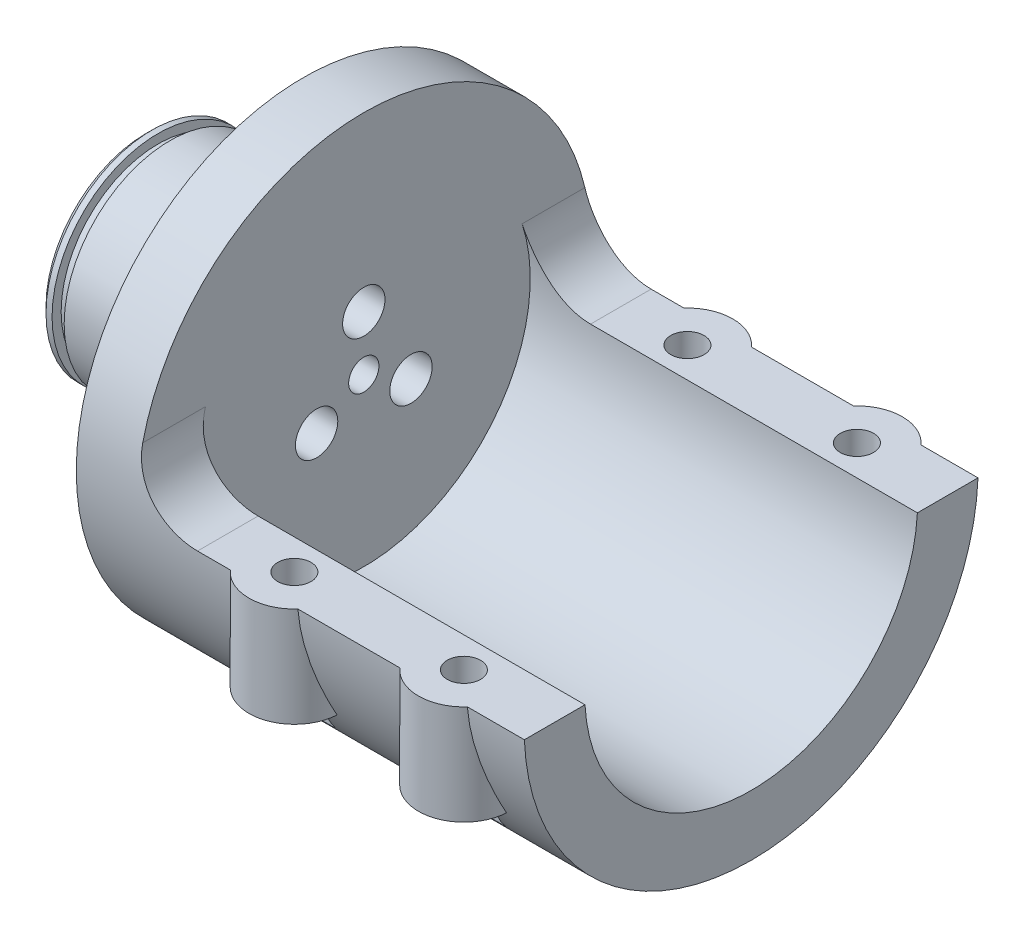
ISO-10303-21;
HEADER;
FILE_DESCRIPTION(('STEP AP214'),'2;1');
FILE_NAME('part.step','',(''),(''),'','','');
FILE_SCHEMA(('AUTOMOTIVE_DESIGN { 1 0 10303 214 1 1 1 1 }'));
ENDSEC;
DATA;
#1=APPLICATION_CONTEXT('core data for automotive mechanical design processes');
#2=APPLICATION_PROTOCOL_DEFINITION('international standard','automotive_design',2000,#1);
#3=PRODUCT_CONTEXT('',#1,'mechanical');
#4=PRODUCT('Part','Part','',(#3));
#5=PRODUCT_RELATED_PRODUCT_CATEGORY('part','',(#4));
#6=PRODUCT_DEFINITION_FORMATION('','',#4);
#7=PRODUCT_DEFINITION_CONTEXT('part definition',#1,'design');
#8=PRODUCT_DEFINITION('design','',#6,#7);
#9=PRODUCT_DEFINITION_SHAPE('','',#8);
#10=(LENGTH_UNIT() NAMED_UNIT(*) SI_UNIT(.MILLI.,.METRE.));
#11=(NAMED_UNIT(*) PLANE_ANGLE_UNIT() SI_UNIT($,.RADIAN.));
#12=(NAMED_UNIT(*) SI_UNIT($,.STERADIAN.) SOLID_ANGLE_UNIT());
#13=UNCERTAINTY_MEASURE_WITH_UNIT(LENGTH_MEASURE(1.E-05),#10,'distance_accuracy_value','');
#14=(GEOMETRIC_REPRESENTATION_CONTEXT(3) GLOBAL_UNCERTAINTY_ASSIGNED_CONTEXT((#13)) GLOBAL_UNIT_ASSIGNED_CONTEXT((#10,
#11,#12)) REPRESENTATION_CONTEXT('',''));
#15=CARTESIAN_POINT('',(0.,0.,0.));
#16=DIRECTION('',(0.,0.,1.));
#17=DIRECTION('',(1.,0.,0.));
#18=AXIS2_PLACEMENT_3D('',#15,#16,#17);
#19=CARTESIAN_POINT('',(0.,0.,0.));
#20=DIRECTION('',(-1.,0.,0.));
#21=DIRECTION('',(0.,0.,1.));
#22=AXIS2_PLACEMENT_3D('',#19,#20,#21);
#23=CYLINDRICAL_SURFACE('',#22,37.5);
#24=CARTESIAN_POINT('',(26.,0.,0.));
#25=DIRECTION('',(-1.,0.,0.));
#26=DIRECTION('',(0.,0.,1.));
#27=AXIS2_PLACEMENT_3D('',#24,#25,#26);
#28=CIRCLE('',#27,37.5);
#29=CARTESIAN_POINT('',(26.,0.,37.5));
#30=VERTEX_POINT('',#29);
#31=EDGE_CURVE('E890',#30,#30,#28,.T.);
#32=ORIENTED_EDGE('',*,*,#31,.F.);
#33=EDGE_LOOP('',(#32));
#34=FACE_BOUND('',#33,.T.);
#35=CARTESIAN_POINT('',(107.75185943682,0.,0.));
#36=DIRECTION('',(0.865497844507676,0.034899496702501,0.499695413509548));
#37=DIRECTION('',(-0.500912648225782,0.0603008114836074,0.863394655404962));
#38=AXIS2_PLACEMENT_3D('',#35,#36,#37);
#39=ELLIPSE('',#38,43.3276642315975,37.5);
#40=CARTESIAN_POINT('',(89.7653120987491,-18.7697807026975,32.4645242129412));
#41=VERTEX_POINT('',#40);
#42=CARTESIAN_POINT('',(89.4842540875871,-18.,32.897568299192));
#43=VERTEX_POINT('',#42);
#44=EDGE_CURVE('E384',#41,#43,#39,.F.);
#45=ORIENTED_EDGE('',*,*,#44,.F.);
#46=CARTESIAN_POINT('',(70.2650558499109,0.,0.));
#47=DIRECTION('',(0.865497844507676,0.034899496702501,-0.499695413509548));
#48=DIRECTION('',(-0.500912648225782,0.0603008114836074,-0.863394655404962));
#49=AXIS2_PLACEMENT_3D('',#46,#47,#48);
#50=ELLIPSE('',#49,43.3276642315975,37.5);
#51=CARTESIAN_POINT('',(87.5042675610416,-24.8016442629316,28.1270055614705));
#52=VERTEX_POINT('',#51);
#53=EDGE_CURVE('E805',#52,#41,#50,.F.);
#54=ORIENTED_EDGE('',*,*,#53,.F.);
#55=DIRECTION('',(-1.,0.,0.));
#56=VECTOR('',#55,1.);
#57=CARTESIAN_POINT('',(0.,-24.8016442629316,28.1270055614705));
#58=LINE('',#57,#56);
#59=CARTESIAN_POINT('',(82.4957324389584,-24.8016442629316,28.1270055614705));
#60=VERTEX_POINT('',#59);
#61=EDGE_CURVE('E803',#60,#52,#58,.F.);
#62=ORIENTED_EDGE('',*,*,#61,.F.);
#63=CARTESIAN_POINT('',(99.7349441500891,0.,0.));
#64=DIRECTION('',(-0.865497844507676,0.034899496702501,-0.499695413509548));
#65=DIRECTION('',(-0.500912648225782,-0.0603008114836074,0.863394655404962));
#66=AXIS2_PLACEMENT_3D('',#63,#64,#65);
#67=ELLIPSE('',#66,43.3276642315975,37.5);
#68=CARTESIAN_POINT('',(80.2346879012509,-18.7697807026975,32.4645242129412));
#69=VERTEX_POINT('',#68);
#70=EDGE_CURVE('E801',#69,#60,#67,.F.);
#71=ORIENTED_EDGE('',*,*,#70,.F.);
#72=CARTESIAN_POINT('',(62.2481405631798,0.,0.));
#73=DIRECTION('',(-0.865497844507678,0.034899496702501,0.499695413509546));
#74=DIRECTION('',(-0.50091264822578,-0.0603008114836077,-0.863394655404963));
#75=AXIS2_PLACEMENT_3D('',#72,#73,#74);
#76=ELLIPSE('',#75,43.3276642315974,37.5);
#77=CARTESIAN_POINT('',(80.5157459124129,-18.,32.897568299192));
#78=VERTEX_POINT('',#77);
#79=EDGE_CURVE('E353',#78,#69,#76,.F.);
#80=ORIENTED_EDGE('',*,*,#79,.F.);
#81=DIRECTION('',(-1.,0.,0.));
#82=VECTOR('',#81,1.);
#83=CARTESIAN_POINT('',(0.,-18.,32.897568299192));
#84=LINE('',#83,#82);
#85=CARTESIAN_POINT('',(77.5125122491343,-18.,32.897568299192));
#86=VERTEX_POINT('',#85);
#87=EDGE_CURVE('E758',#86,#78,#84,.F.);
#88=ORIENTED_EDGE('',*,*,#87,.F.);
#89=CARTESIAN_POINT('',(77.5125122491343,-18.,32.897568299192));
#90=CARTESIAN_POINT('',(77.518874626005,-17.7990601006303,33.0075137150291));
#91=CARTESIAN_POINT('',(77.5275503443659,-17.5971831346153,33.1155784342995));
#92=CARTESIAN_POINT('',(77.5490949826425,-17.1916763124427,33.3278957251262));
#93=CARTESIAN_POINT('',(77.5619635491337,-16.9880466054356,33.4321486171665));
#94=CARTESIAN_POINT('',(77.6061955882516,-16.3748680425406,33.7390362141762));
#95=CARTESIAN_POINT('',(77.6431927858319,-15.9628242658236,33.935912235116));
#96=CARTESIAN_POINT('',(77.7289784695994,-15.1334860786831,34.3137726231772));
#97=CARTESIAN_POINT('',(77.777750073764,-14.716199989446,34.4947792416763));
#98=CARTESIAN_POINT('',(77.8842075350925,-13.8762785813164,34.8411434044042));
#99=CARTESIAN_POINT('',(77.9418944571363,-13.4536426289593,35.006499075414));
#100=CARTESIAN_POINT('',(78.1220774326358,-12.1930558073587,35.4735581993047));
#101=CARTESIAN_POINT('',(78.25338604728,-11.3479704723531,35.7528195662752));
#102=CARTESIAN_POINT('',(78.5195828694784,-9.64056320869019,36.2505237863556));
#103=CARTESIAN_POINT('',(78.654471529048,-8.77823910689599,36.4689589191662));
#104=CARTESIAN_POINT('',(78.856884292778,-7.38633432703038,36.769238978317));
#105=CARTESIAN_POINT('',(78.9297613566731,-6.86172215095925,36.8707603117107));
#106=CARTESIAN_POINT('',(79.0651039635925,-5.80747775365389,37.0514378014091));
#107=CARTESIAN_POINT('',(79.1275738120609,-5.27784770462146,37.1306032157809));
#108=CARTESIAN_POINT('',(79.2106762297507,-4.47750618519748,37.2327174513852));
#109=CARTESIAN_POINT('',(79.2367116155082,-4.20840211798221,37.2640960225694));
#110=CARTESIAN_POINT('',(79.2846179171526,-3.66920780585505,37.3210450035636));
#111=CARTESIAN_POINT('',(79.3064889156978,-3.39911758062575,37.3466155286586));
#112=CARTESIAN_POINT('',(79.345656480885,-2.85788632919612,37.3919280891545));
#113=CARTESIAN_POINT('',(79.3629491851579,-2.58674461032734,37.411665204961));
#114=CARTESIAN_POINT('',(79.3926107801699,-2.04380862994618,37.4452514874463));
#115=CARTESIAN_POINT('',(79.4049793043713,-1.77201432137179,37.4591002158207));
#116=CARTESIAN_POINT('',(79.4147218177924,-1.5,37.4699879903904));
#117=B_SPLINE_CURVE_WITH_KNOTS('',3,(#89,#90,#91,#92,#93,#94,#95,#96,#97,#98,#99,#100,#101,#102,
#103,#104,#105,#106,#107,#108,#109,#110,#111,#112,#113,#114,#115,#116),.UNSPECIFIED.,.F.,.F.,(4,
2,2,2,2,2,2,2,2,2,2,2,2,4),(0.,0.687371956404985,1.37468598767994,2.7486118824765,
4.12057943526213,5.49271098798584,8.18920737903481,10.8860458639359,12.5034394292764,
14.1201622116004,14.936610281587,15.7530421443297,16.570160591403,17.3873398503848),.UNSPECIFIED.);
#118=CARTESIAN_POINT('',(79.4147218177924,-1.5,37.4699879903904));
#119=VERTEX_POINT('',#118);
#120=EDGE_CURVE('E696',#86,#119,#117,.T.);
#121=ORIENTED_EDGE('',*,*,#120,.T.);
#122=DIRECTION('',(-1.,0.,0.));
#123=VECTOR('',#122,1.);
#124=CARTESIAN_POINT('',(0.,-1.5,37.4699879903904));
#125=LINE('',#124,#123);
#126=CARTESIAN_POINT('',(62.5852781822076,-1.5,37.4699879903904));
#127=VERTEX_POINT('',#126);
#128=EDGE_CURVE('E757',#119,#127,#125,.T.);
#129=ORIENTED_EDGE('',*,*,#128,.T.);
#130=CARTESIAN_POINT('',(62.5852781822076,-1.5,37.4699879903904));
#131=CARTESIAN_POINT('',(62.5936466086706,-1.73345455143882,37.4606427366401));
#132=CARTESIAN_POINT('',(62.6039400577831,-1.96674158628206,37.4491179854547));
#133=CARTESIAN_POINT('',(62.6281866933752,-2.43286035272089,37.4217274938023));
#134=CARTESIAN_POINT('',(62.6421397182,-2.66569210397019,37.4058619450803));
#135=CARTESIAN_POINT('',(62.6891906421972,-3.3631555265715,37.3517950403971));
#136=CARTESIAN_POINT('',(62.727487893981,-3.82695575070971,37.3071153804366));
#137=CARTESIAN_POINT('',(62.8157471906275,-4.75081071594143,37.200749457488));
#138=CARTESIAN_POINT('',(62.8656935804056,-5.21086963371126,37.1390859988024));
#139=CARTESIAN_POINT('',(62.9747039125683,-6.12735600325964,36.9989247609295));
#140=CARTESIAN_POINT('',(63.0337686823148,-6.58378312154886,36.9204254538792));
#141=CARTESIAN_POINT('',(63.1571626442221,-7.4848109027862,36.7482566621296));
#142=CARTESIAN_POINT('',(63.2213845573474,-7.92948034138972,36.6548695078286));
#143=CARTESIAN_POINT('',(63.3532289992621,-8.81461550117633,36.452142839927));
#144=CARTESIAN_POINT('',(63.4208515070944,-9.25508124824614,36.3428034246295));
#145=CARTESIAN_POINT('',(63.6247938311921,-10.5700408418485,35.990939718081));
#146=CARTESIAN_POINT('',(63.7621995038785,-11.4381712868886,35.7245557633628));
#147=CARTESIAN_POINT('',(63.9629699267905,-12.7836506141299,35.2575395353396));
#148=CARTESIAN_POINT('',(64.0326531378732,-13.2676100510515,35.0783044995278));
#149=CARTESIAN_POINT('',(64.1620224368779,-14.2287025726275,34.6995773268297));
#150=CARTESIAN_POINT('',(64.2217128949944,-14.705838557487,34.5000941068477));
#151=CARTESIAN_POINT('',(64.3274525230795,-15.6574200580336,34.0788571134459));
#152=CARTESIAN_POINT('',(64.3733629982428,-16.1317939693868,33.8569051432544));
#153=CARTESIAN_POINT('',(64.427893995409,-16.8371323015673,33.5086531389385));
#154=CARTESIAN_POINT('',(64.4436860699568,-17.0713205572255,33.3899535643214));
#155=CARTESIAN_POINT('',(64.4698302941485,-17.5374165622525,33.1475194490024));
#156=CARTESIAN_POINT('',(64.4801817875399,-17.7693240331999,33.0237843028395));
#157=CARTESIAN_POINT('',(64.4874877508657,-18.,32.897568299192));
#158=B_SPLINE_CURVE_WITH_KNOTS('',3,(#130,#131,#132,#133,#134,#135,#136,#137,#138,#139,#140,
#141,#142,#143,#144,#145,#146,#147,#148,#149,#150,#151,#152,#153,#154,#155,#156,#157),
.UNSPECIFIED.,.F.,.F.,(4,2,2,2,2,2,2,2,2,2,2,2,2,4),(0.,0.701335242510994,1.40263951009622,
2.80464662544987,4.20478035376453,5.60504119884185,6.98136022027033,8.35767076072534,
11.1100631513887,12.6719446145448,14.233141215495,15.8095613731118,16.5985405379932,
17.3876148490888),.UNSPECIFIED.);
#159=CARTESIAN_POINT('',(64.4874877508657,-18.,32.897568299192));
#160=VERTEX_POINT('',#159);
#161=EDGE_CURVE('E660',#127,#160,#158,.T.);
#162=ORIENTED_EDGE('',*,*,#161,.T.);
#163=DIRECTION('',(-1.,0.,0.));
#164=VECTOR('',#163,1.);
#165=CARTESIAN_POINT('',(0.,-18.,32.897568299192));
#166=LINE('',#165,#164);
#167=CARTESIAN_POINT('',(61.4842540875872,-18.,32.897568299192));
#168=VERTEX_POINT('',#167);
#169=EDGE_CURVE('E761',#168,#160,#166,.F.);
#170=ORIENTED_EDGE('',*,*,#169,.F.);
#171=CARTESIAN_POINT('',(79.7518594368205,0.,0.));
#172=DIRECTION('',(0.865497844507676,0.034899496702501,0.499695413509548));
#173=DIRECTION('',(-0.500912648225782,0.0603008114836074,0.863394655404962));
#174=AXIS2_PLACEMENT_3D('',#171,#172,#173);
#175=ELLIPSE('',#174,43.3276642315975,37.5);
#176=CARTESIAN_POINT('',(61.7653120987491,-18.7697807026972,32.4645242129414));
#177=VERTEX_POINT('',#176);
#178=EDGE_CURVE('E463',#177,#168,#175,.F.);
#179=ORIENTED_EDGE('',*,*,#178,.F.);
#180=CARTESIAN_POINT('',(42.2650558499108,0.,0.));
#181=DIRECTION('',(0.865497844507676,0.034899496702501,-0.499695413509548));
#182=DIRECTION('',(-0.500912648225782,0.0603008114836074,-0.863394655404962));
#183=AXIS2_PLACEMENT_3D('',#180,#181,#182);
#184=ELLIPSE('',#183,43.3276642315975,37.5);
#185=CARTESIAN_POINT('',(59.5042675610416,-24.8016442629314,28.1270055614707));
#186=VERTEX_POINT('',#185);
#187=EDGE_CURVE('E797',#186,#177,#184,.F.);
#188=ORIENTED_EDGE('',*,*,#187,.F.);
#189=DIRECTION('',(-1.,0.,0.));
#190=VECTOR('',#189,1.);
#191=CARTESIAN_POINT('',(0.,-24.8016442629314,28.1270055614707));
#192=LINE('',#191,#190);
#193=CARTESIAN_POINT('',(54.4957324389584,-24.8016442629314,28.1270055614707));
#194=VERTEX_POINT('',#193);
#195=EDGE_CURVE('E795',#194,#186,#192,.F.);
#196=ORIENTED_EDGE('',*,*,#195,.F.);
#197=CARTESIAN_POINT('',(71.7349441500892,0.,0.));
#198=DIRECTION('',(-0.865497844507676,0.034899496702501,-0.499695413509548));
#199=DIRECTION('',(-0.500912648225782,-0.0603008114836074,0.863394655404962));
#200=AXIS2_PLACEMENT_3D('',#197,#198,#199);
#201=ELLIPSE('',#200,43.3276642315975,37.5);
#202=CARTESIAN_POINT('',(52.2346879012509,-18.7697807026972,32.4645242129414));
#203=VERTEX_POINT('',#202);
#204=EDGE_CURVE('E793',#203,#194,#201,.F.);
#205=ORIENTED_EDGE('',*,*,#204,.F.);
#206=CARTESIAN_POINT('',(34.2481405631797,0.,0.));
#207=DIRECTION('',(-0.865497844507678,0.034899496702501,0.499695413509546));
#208=DIRECTION('',(-0.50091264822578,-0.0603008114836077,-0.863394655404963));
#209=AXIS2_PLACEMENT_3D('',#206,#207,#208);
#210=ELLIPSE('',#209,43.3276642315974,37.5);
#211=CARTESIAN_POINT('',(52.5157459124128,-18.,32.897568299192));
#212=VERTEX_POINT('',#211);
#213=EDGE_CURVE('E449',#212,#203,#210,.F.);
#214=ORIENTED_EDGE('',*,*,#213,.F.);
#215=CARTESIAN_POINT('',(49.5125122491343,-18.,32.897568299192));
#216=VERTEX_POINT('',#215);
#217=EDGE_CURVE('E762',#216,#212,#166,.F.);
#218=ORIENTED_EDGE('',*,*,#217,.F.);
#219=CARTESIAN_POINT('',(49.5125122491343,-18.,32.897568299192));
#220=CARTESIAN_POINT('',(49.5188746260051,-17.7990601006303,33.0075137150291));
#221=CARTESIAN_POINT('',(49.5275503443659,-17.5971831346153,33.1155784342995));
#222=CARTESIAN_POINT('',(49.5490949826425,-17.1916763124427,33.3278957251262));
#223=CARTESIAN_POINT('',(49.5619635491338,-16.9880466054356,33.4321486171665));
#224=CARTESIAN_POINT('',(49.6061955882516,-16.3748680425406,33.7390362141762));
#225=CARTESIAN_POINT('',(49.6431927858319,-15.9628242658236,33.935912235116));
#226=CARTESIAN_POINT('',(49.7289784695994,-15.1334860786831,34.3137726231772));
#227=CARTESIAN_POINT('',(49.7777500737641,-14.716199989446,34.4947792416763));
#228=CARTESIAN_POINT('',(49.8842075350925,-13.8762785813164,34.8411434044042));
#229=CARTESIAN_POINT('',(49.9418944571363,-13.4536426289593,35.006499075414));
#230=CARTESIAN_POINT('',(50.1220774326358,-12.1930558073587,35.4735581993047));
#231=CARTESIAN_POINT('',(50.25338604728,-11.3479704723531,35.7528195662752));
#232=CARTESIAN_POINT('',(50.5195828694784,-9.64056320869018,36.2505237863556));
#233=CARTESIAN_POINT('',(50.654471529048,-8.77823910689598,36.4689589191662));
#234=CARTESIAN_POINT('',(50.856884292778,-7.38633432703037,36.769238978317));
#235=CARTESIAN_POINT('',(50.9297613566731,-6.86172215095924,36.8707603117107));
#236=CARTESIAN_POINT('',(51.0651039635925,-5.80747775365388,37.0514378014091));
#237=CARTESIAN_POINT('',(51.1275738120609,-5.27784770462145,37.1306032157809));
#238=CARTESIAN_POINT('',(51.2106762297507,-4.47750618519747,37.2327174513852));
#239=CARTESIAN_POINT('',(51.2367116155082,-4.2084021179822,37.2640960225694));
#240=CARTESIAN_POINT('',(51.2846179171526,-3.66920780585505,37.3210450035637));
#241=CARTESIAN_POINT('',(51.3064889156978,-3.39911758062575,37.3466155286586));
#242=CARTESIAN_POINT('',(51.345656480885,-2.85788632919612,37.3919280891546));
#243=CARTESIAN_POINT('',(51.3629491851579,-2.58674461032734,37.411665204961));
#244=CARTESIAN_POINT('',(51.3926107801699,-2.04380862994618,37.4452514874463));
#245=CARTESIAN_POINT('',(51.4049793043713,-1.77201432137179,37.4591002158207));
#246=CARTESIAN_POINT('',(51.4147218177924,-1.5,37.4699879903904));
#247=B_SPLINE_CURVE_WITH_KNOTS('',3,(#219,#220,#221,#222,#223,#224,#225,#226,#227,#228,#229,
#230,#231,#232,#233,#234,#235,#236,#237,#238,#239,#240,#241,#242,#243,#244,#245,#246),
.UNSPECIFIED.,.F.,.F.,(4,2,2,2,2,2,2,2,2,2,2,2,2,4),(0.,0.687371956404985,1.37468598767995,
2.7486118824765,4.12057943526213,5.49271098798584,8.18920737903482,10.8860458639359,
12.5034394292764,14.1201622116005,14.936610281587,15.7530421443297,16.570160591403,
17.3873398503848),.UNSPECIFIED.);
#248=CARTESIAN_POINT('',(51.4147218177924,-1.5,37.4699879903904));
#249=VERTEX_POINT('',#248);
#250=EDGE_CURVE('E666',#216,#249,#247,.T.);
#251=ORIENTED_EDGE('',*,*,#250,.T.);
#252=CARTESIAN_POINT('',(46.,-1.5,37.4699879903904));
#253=VERTEX_POINT('',#252);
#254=EDGE_CURVE('E752',#249,#253,#125,.T.);
#255=ORIENTED_EDGE('',*,*,#254,.T.);
#256=CARTESIAN_POINT('',(51.2678268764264,0.,37.5));
#257=CARTESIAN_POINT('',(51.0289304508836,-0.148063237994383,37.499999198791));
#258=CARTESIAN_POINT('',(50.7838604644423,-0.285994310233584,37.4991255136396));
#259=CARTESIAN_POINT('',(50.2829140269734,-0.540772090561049,37.4963173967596));
#260=CARTESIAN_POINT('',(50.0270363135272,-0.657616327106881,37.4943828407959));
#261=CARTESIAN_POINT('',(49.5062422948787,-0.869383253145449,37.490070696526));
#262=CARTESIAN_POINT('',(49.2413218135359,-0.964295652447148,37.487692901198));
#263=CARTESIAN_POINT('',(48.7044257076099,-1.13146530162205,37.4830199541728));
#264=CARTESIAN_POINT('',(48.4324501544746,-1.20372278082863,37.4807248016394));
#265=CARTESIAN_POINT('',(47.8834303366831,-1.3250553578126,37.4766316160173));
#266=CARTESIAN_POINT('',(47.6063870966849,-1.37413508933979,37.4748334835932));
#267=CARTESIAN_POINT('',(47.0491448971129,-1.44878472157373,37.4720218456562));
#268=CARTESIAN_POINT('',(46.7689459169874,-1.47435446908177,37.4710083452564));
#269=CARTESIAN_POINT('',(46.2074222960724,-1.50179894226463,37.4699184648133));
#270=CARTESIAN_POINT('',(45.9260977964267,-1.50367655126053,37.4698419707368));
#271=CARTESIAN_POINT('',(45.3642921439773,-1.4837308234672,37.470637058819));
#272=CARTESIAN_POINT('',(45.0838109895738,-1.46190753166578,37.4715086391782));
#273=CARTESIAN_POINT('',(44.5258075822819,-1.39473056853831,37.4740690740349));
#274=CARTESIAN_POINT('',(44.2482841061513,-1.34938704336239,37.4757575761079));
#275=CARTESIAN_POINT('',(43.6980433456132,-1.23549842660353,37.4796849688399));
#276=CARTESIAN_POINT('',(43.425326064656,-1.16695331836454,37.4819238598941));
#277=CARTESIAN_POINT('',(42.8866176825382,-1.00714421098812,37.4865581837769));
#278=CARTESIAN_POINT('',(42.6206269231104,-0.915879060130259,37.4889536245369));
#279=CARTESIAN_POINT('',(42.0972703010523,-0.711277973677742,37.49339336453));
#280=CARTESIAN_POINT('',(41.8399044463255,-0.597942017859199,37.4954376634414));
#281=CARTESIAN_POINT('',(41.3354457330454,-0.349914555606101,37.4985725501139));
#282=CARTESIAN_POINT('',(41.0883602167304,-0.215208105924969,37.4996624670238));
#283=CARTESIAN_POINT('',(40.6064142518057,0.0745451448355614,37.5002056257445));
#284=CARTESIAN_POINT('',(40.3715538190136,0.229591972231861,37.4996588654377));
#285=CARTESIAN_POINT('',(39.9157448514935,0.558911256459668,37.4961961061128));
#286=CARTESIAN_POINT('',(39.694796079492,0.733183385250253,37.4932801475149));
#287=CARTESIAN_POINT('',(39.2684008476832,1.09968881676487,37.4843203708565));
#288=CARTESIAN_POINT('',(39.0629543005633,1.29192201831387,37.4782765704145));
#289=CARTESIAN_POINT('',(38.669943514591,1.69202301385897,37.4623404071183));
#290=CARTESIAN_POINT('',(38.4823027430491,1.89981631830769,37.4524655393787));
#291=CARTESIAN_POINT('',(38.1252133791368,2.33024084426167,37.4281502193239));
#292=CARTESIAN_POINT('',(37.9557647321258,2.55287202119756,37.413709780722));
#293=CARTESIAN_POINT('',(37.6362935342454,3.01124375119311,37.3796095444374));
#294=CARTESIAN_POINT('',(37.486268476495,3.24698260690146,37.3599504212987));
#295=CARTESIAN_POINT('',(37.20667013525,3.72976312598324,37.3148446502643));
#296=CARTESIAN_POINT('',(37.0770965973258,3.97680464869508,37.2893980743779));
#297=CARTESIAN_POINT('',(36.8410057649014,4.47655891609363,37.23268360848));
#298=CARTESIAN_POINT('',(36.7341786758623,4.72913567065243,37.2015064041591));
#299=CARTESIAN_POINT('',(36.5418485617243,5.24143732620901,37.132790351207));
#300=CARTESIAN_POINT('',(36.456345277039,5.50116214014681,37.0952515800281));
#301=CARTESIAN_POINT('',(36.3070880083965,6.02576732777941,37.0136540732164));
#302=CARTESIAN_POINT('',(36.2433329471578,6.29064744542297,36.9695956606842));
#303=CARTESIAN_POINT('',(36.137776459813,6.82359241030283,36.8749485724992));
#304=CARTESIAN_POINT('',(36.0959751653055,7.09165727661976,36.8243598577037));
#305=CARTESIAN_POINT('',(36.0343200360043,7.6291254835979,36.7167752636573));
#306=CARTESIAN_POINT('',(36.014474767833,7.89852930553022,36.6597768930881));
#307=CARTESIAN_POINT('',(35.9965765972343,8.43669067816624,36.5396806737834));
#308=CARTESIAN_POINT('',(35.9985236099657,8.70544823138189,36.4765828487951));
#309=CARTESIAN_POINT('',(36.0238607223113,9.24052864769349,36.3447183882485));
#310=CARTESIAN_POINT('',(36.0472498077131,9.50685162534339,36.2759520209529));
#311=CARTESIAN_POINT('',(36.1149994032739,10.0355180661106,36.1332724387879));
#312=CARTESIAN_POINT('',(36.1593678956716,10.2978599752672,36.0593572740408));
#313=CARTESIAN_POINT('',(36.2707417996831,10.8276111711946,35.9039291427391));
#314=CARTESIAN_POINT('',(36.3386025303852,11.0947856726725,35.8222287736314));
#315=CARTESIAN_POINT('',(36.4957182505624,11.6215715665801,35.6548102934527));
#316=CARTESIAN_POINT('',(36.5849806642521,11.8811802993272,35.5690907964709));
#317=CARTESIAN_POINT('',(36.7841185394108,12.3913389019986,35.3945957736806));
#318=CARTESIAN_POINT('',(36.8939965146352,12.6418876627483,35.3058198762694));
#319=CARTESIAN_POINT('',(37.133559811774,13.1325791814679,35.1262527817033));
#320=CARTESIAN_POINT('',(37.2632459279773,13.3727215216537,35.0354615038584));
#321=CARTESIAN_POINT('',(37.5504808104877,13.8562721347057,34.8471698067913));
#322=CARTESIAN_POINT('',(37.7092767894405,14.0989174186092,34.749609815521));
#323=CARTESIAN_POINT('',(38.0473567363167,14.5695463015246,34.5549296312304));
#324=CARTESIAN_POINT('',(38.2266344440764,14.7975343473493,34.4578093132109));
#325=CARTESIAN_POINT('',(38.6048647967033,15.2376712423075,34.2654503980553));
#326=CARTESIAN_POINT('',(38.8038282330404,15.4498112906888,34.1702128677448));
#327=CARTESIAN_POINT('',(39.2203800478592,15.8567342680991,33.9832918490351));
#328=CARTESIAN_POINT('',(39.4379708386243,16.0515149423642,33.8916088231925));
#329=CARTESIAN_POINT('',(39.8944084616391,16.4252873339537,33.7120695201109));
#330=CARTESIAN_POINT('',(40.1335457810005,16.6039670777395,33.6243008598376));
#331=CARTESIAN_POINT('',(40.6285349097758,16.9401910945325,33.4561691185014));
#332=CARTESIAN_POINT('',(40.8843785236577,17.0977456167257,33.37580245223));
#333=CARTESIAN_POINT('',(41.4112560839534,17.3901156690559,33.2244034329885));
#334=CARTESIAN_POINT('',(41.6822839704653,17.5249401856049,33.1533673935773));
#335=CARTESIAN_POINT('',(42.2377420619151,17.7702510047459,33.0225306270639));
#336=CARTESIAN_POINT('',(42.5221705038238,17.8807404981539,32.9627284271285));
#337=CARTESIAN_POINT('',(43.0765262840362,18.067189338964,32.8608724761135));
#338=CARTESIAN_POINT('',(43.3455161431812,18.1453363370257,32.8177177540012));
#339=CARTESIAN_POINT('',(43.8906905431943,18.2790368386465,32.7434371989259));
#340=CARTESIAN_POINT('',(44.1668746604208,18.3345916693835,32.712310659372));
#341=CARTESIAN_POINT('',(44.7238618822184,18.422242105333,32.6630300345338));
#342=CARTESIAN_POINT('',(45.0046610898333,18.4543565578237,32.644865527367));
#343=CARTESIAN_POINT('',(45.5685085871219,18.4946823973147,32.6220366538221));
#344=CARTESIAN_POINT('',(45.8515566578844,18.5028960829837,32.6173709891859));
#345=CARTESIAN_POINT('',(46.3848383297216,18.4957327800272,32.6214324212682));
#346=CARTESIAN_POINT('',(46.6351228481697,18.4829461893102,32.6286889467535));
#347=CARTESIAN_POINT('',(47.1335072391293,18.4386990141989,32.6537138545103));
#348=CARTESIAN_POINT('',(47.3816071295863,18.4072385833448,32.6714821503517));
#349=CARTESIAN_POINT('',(47.8738420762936,18.3260340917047,32.7171000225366));
#350=CARTESIAN_POINT('',(48.1179771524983,18.2762901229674,32.744949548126));
#351=CARTESIAN_POINT('',(48.6006714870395,18.1590991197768,32.8100839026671));
#352=CARTESIAN_POINT('',(48.8392305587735,18.0916514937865,32.8473690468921));
#353=CARTESIAN_POINT('',(49.3083661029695,17.9400866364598,32.9303919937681));
#354=CARTESIAN_POINT('',(49.5389710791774,17.8560382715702,32.9760948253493));
#355=CARTESIAN_POINT('',(49.9920498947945,17.671879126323,33.0751510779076));
#356=CARTESIAN_POINT('',(50.2145210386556,17.5717630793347,33.1285070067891));
#357=CARTESIAN_POINT('',(50.6501864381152,17.3563422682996,33.2418738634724));
#358=CARTESIAN_POINT('',(50.8633817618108,17.2410392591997,33.3018840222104));
#359=CARTESIAN_POINT('',(51.2796651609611,16.9960892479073,33.427562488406));
#360=CARTESIAN_POINT('',(51.4827493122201,16.8664367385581,33.4932329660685));
#361=CARTESIAN_POINT('',(52.1161895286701,16.4292082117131,33.7111828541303));
#362=CARTESIAN_POINT('',(52.5257322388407,16.0953867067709,33.8725274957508));
#363=CARTESIAN_POINT('',(53.2849417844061,15.3706176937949,34.207503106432));
#364=CARTESIAN_POINT('',(53.6345760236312,14.9796392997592,34.3811406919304));
#365=CARTESIAN_POINT('',(54.126380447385,14.3348464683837,34.6529158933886));
#366=CARTESIAN_POINT('',(54.2914561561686,14.0977818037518,34.750129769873));
#367=CARTESIAN_POINT('',(54.6005694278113,13.6101345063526,34.9439974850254));
#368=CARTESIAN_POINT('',(54.7446133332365,13.3595559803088,35.0406514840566));
#369=CARTESIAN_POINT('',(55.0108051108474,12.8461550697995,35.2321078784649));
#370=CARTESIAN_POINT('',(55.1329401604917,12.5833256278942,35.3269091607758));
#371=CARTESIAN_POINT('',(55.3542219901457,12.0471943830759,35.5133158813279));
#372=CARTESIAN_POINT('',(55.4533780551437,11.7738968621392,35.6049225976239));
#373=CARTESIAN_POINT('',(55.6295845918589,11.2128026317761,35.7856347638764));
#374=CARTESIAN_POINT('',(55.7061491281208,10.9248246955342,35.8746525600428));
#375=CARTESIAN_POINT('',(55.8334999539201,10.3415688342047,36.04711400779));
#376=CARTESIAN_POINT('',(55.8842855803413,10.0462907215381,36.1305575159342));
#377=CARTESIAN_POINT('',(55.959226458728,9.45071349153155,36.2908952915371));
#378=CARTESIAN_POINT('',(55.9833905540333,9.15041607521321,36.3677917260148));
#379=CARTESIAN_POINT('',(56.0044425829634,8.54709843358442,36.5142909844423));
#380=CARTESIAN_POINT('',(56.0013323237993,8.24407839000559,36.5838942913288));
#381=CARTESIAN_POINT('',(55.9683496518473,7.65497050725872,36.7115390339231));
#382=CARTESIAN_POINT('',(55.9399947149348,7.36889044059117,36.7700109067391));
#383=CARTESIAN_POINT('',(55.8584510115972,6.79887602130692,36.8796625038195));
#384=CARTESIAN_POINT('',(55.8052630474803,6.51494159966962,36.930842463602));
#385=CARTESIAN_POINT('',(55.6741614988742,5.95162489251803,37.0257983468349));
#386=CARTESIAN_POINT('',(55.5962519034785,5.67224188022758,37.0695754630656));
#387=CARTESIAN_POINT('',(55.4160692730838,5.12037191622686,37.1498255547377));
#388=CARTESIAN_POINT('',(55.3137972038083,4.84788469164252,37.1862988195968));
#389=CARTESIAN_POINT('',(55.0915605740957,4.32632201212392,37.2504806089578));
#390=CARTESIAN_POINT('',(54.9728160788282,4.07677021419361,37.2785503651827));
#391=CARTESIAN_POINT('',(54.7147947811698,3.58789786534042,37.3287740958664));
#392=CARTESIAN_POINT('',(54.5755181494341,3.34857722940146,37.3509281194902));
#393=CARTESIAN_POINT('',(54.2774314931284,2.88211042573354,37.3898139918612));
#394=CARTESIAN_POINT('',(54.1186306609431,2.65495860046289,37.4065483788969));
#395=CARTESIAN_POINT('',(53.7826141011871,2.21448432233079,37.4352081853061));
#396=CARTESIAN_POINT('',(53.6054000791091,2.00116059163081,37.447134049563));
#397=CARTESIAN_POINT('',(53.1055846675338,1.44807633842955,37.4736425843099));
#398=CARTESIAN_POINT('',(52.7669166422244,1.12243289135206,37.4843973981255));
#399=CARTESIAN_POINT('',(52.0471613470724,0.521805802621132,37.4975769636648));
#400=CARTESIAN_POINT('',(51.6660721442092,0.24682447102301,37.5000013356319));
#401=CARTESIAN_POINT('',(51.2678268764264,0.,37.5));
#402=B_SPLINE_CURVE_WITH_KNOTS('',3,(#256,#257,#258,#259,#260,#261,#262,#263,#264,#265,#266,
#267,#268,#269,#270,#271,#272,#273,#274,#275,#276,#277,#278,#279,#280,#281,#282,#283,#284,#285,
#286,#287,#288,#289,#290,#291,#292,#293,#294,#295,#296,#297,#298,#299,#300,#301,#302,#303,#304,
#305,#306,#307,#308,#309,#310,#311,#312,#313,#314,#315,#316,#317,#318,#319,#320,#321,#322,#323,
#324,#325,#326,#327,#328,#329,#330,#331,#332,#333,#334,#335,#336,#337,#338,#339,#340,#341,#342,
#343,#344,#345,#346,#347,#348,#349,#350,#351,#352,#353,#354,#355,#356,#357,#358,#359,#360,#361,
#362,#363,#364,#365,#366,#367,#368,#369,#370,#371,#372,#373,#374,#375,#376,#377,#378,#379,#380,
#381,#382,#383,#384,#385,#386,#387,#388,#389,#390,#391,#392,#393,#394,#395,#396,#397,#398,#399,
#400,#401),.UNSPECIFIED.,.T.,.F.,(4,2,2,2,2,2,2,2,2,2,2,2,2,2,2,2,2,2,2,2,2,2,2,2,2,2,2,2,2,2,2,
2,2,2,2,2,2,2,2,2,2,2,2,2,2,2,2,2,2,2,2,2,2,2,2,2,2,2,2,2,2,2,2,2,2,2,2,2,2,2,2,2,4),(0.,
0.842772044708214,1.68564280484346,2.52890823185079,3.3721651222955,4.21525335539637,
5.05834708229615,5.90133820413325,6.74432772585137,7.58695390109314,8.42958068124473,
9.2722501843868,10.1149204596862,10.9581825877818,11.8014458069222,12.6446946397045,
13.4879387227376,14.3273764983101,15.1668117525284,16.0061385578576,16.8454549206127,
17.6724827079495,18.4995004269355,19.3264771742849,20.1534588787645,20.9807631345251,
21.8080641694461,22.6353260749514,23.4629029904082,24.3244884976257,25.1863733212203,
26.0483633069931,26.91038786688,27.8272162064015,28.7437650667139,29.6608191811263,
30.5779922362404,31.5102336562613,32.4420211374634,33.3734393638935,34.3047353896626,
35.1537909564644,36.0027966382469,36.8511189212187,37.6993596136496,38.4505959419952,
39.2018260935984,39.9530524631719,40.7043039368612,41.4525020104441,42.2009458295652,
42.9493032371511,43.6979488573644,45.3481202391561,46.9991866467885,47.9126848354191,
48.8259069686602,49.7396618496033,50.6530468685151,51.5848452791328,52.5166676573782,
53.4481804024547,54.3796314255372,55.2586105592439,56.1375612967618,57.0163702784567,
57.8951444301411,58.7274951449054,59.5598389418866,60.3917923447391,61.2236687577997,
62.6285230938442,64.0334414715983),.UNSPECIFIED.);
#403=CARTESIAN_POINT('',(36.,8.5,36.5239647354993));
#404=VERTEX_POINT('',#403);
#405=EDGE_CURVE('E737',#253,#404,#402,.T.);
#406=ORIENTED_EDGE('',*,*,#405,.T.);
#407=CARTESIAN_POINT('',(36.,0.,0.));
#408=DIRECTION('',(-1.,0.,0.));
#409=DIRECTION('',(0.,-1.,0.));
#410=AXIS2_PLACEMENT_3D('',#407,#408,#409);
#411=CIRCLE('',#410,37.5);
#412=CARTESIAN_POINT('',(36.,8.5,-36.5239647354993));
#413=VERTEX_POINT('',#412);
#414=EDGE_CURVE('E749',#404,#413,#411,.T.);
#415=ORIENTED_EDGE('',*,*,#414,.T.);
#416=CARTESIAN_POINT('',(56.,8.5,-36.5239647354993));
#417=CARTESIAN_POINT('',(56.0000050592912,8.79131495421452,-36.4561724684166));
#418=CARTESIAN_POINT('',(55.9872667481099,9.08174299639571,-36.3848982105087));
#419=CARTESIAN_POINT('',(55.9368460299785,9.65886896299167,-36.2359628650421));
#420=CARTESIAN_POINT('',(55.8991577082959,9.94556598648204,-36.1583002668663));
#421=CARTESIAN_POINT('',(55.7994750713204,10.5133163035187,-35.9973241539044));
#422=CARTESIAN_POINT('',(55.7374616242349,10.7943649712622,-35.9140062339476));
#423=CARTESIAN_POINT('',(55.5899088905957,11.3488586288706,-35.7426588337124));
#424=CARTESIAN_POINT('',(55.504360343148,11.6223005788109,-35.6546275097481));
#425=CARTESIAN_POINT('',(55.3109190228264,12.1589429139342,-35.4752006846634));
#426=CARTESIAN_POINT('',(55.2030986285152,12.4221732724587,-35.3838168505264));
#427=CARTESIAN_POINT('',(54.9658382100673,12.9378347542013,-35.1985463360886));
#428=CARTESIAN_POINT('',(54.8363901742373,13.1902618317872,-35.1046587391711));
#429=CARTESIAN_POINT('',(54.4170464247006,13.9289645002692,-34.8211312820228));
#430=CARTESIAN_POINT('',(54.09596435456,14.3971758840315,-34.629452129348));
#431=CARTESIAN_POINT('',(53.3627866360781,15.2924880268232,-34.243795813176));
#432=CARTESIAN_POINT('',(52.9474431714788,15.7170467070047,-34.050058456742));
#433=CARTESIAN_POINT('',(52.2695504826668,16.2962409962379,-33.774674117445));
#434=CARTESIAN_POINT('',(52.034265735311,16.4798010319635,-33.6853621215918));
#435=CARTESIAN_POINT('',(51.5465701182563,16.8261561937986,-33.5136945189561));
#436=CARTESIAN_POINT('',(51.2941681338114,16.9889619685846,-33.4313353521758));
#437=CARTESIAN_POINT('',(50.7808595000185,17.2880136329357,-33.2776517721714));
#438=CARTESIAN_POINT('',(50.520380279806,17.4248688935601,-33.206085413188));
#439=CARTESIAN_POINT('',(49.9863373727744,17.6758425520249,-33.0731726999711));
#440=CARTESIAN_POINT('',(49.7127810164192,17.7899735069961,-33.0118207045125));
#441=CARTESIAN_POINT('',(49.154669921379,17.9940121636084,-32.9010488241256));
#442=CARTESIAN_POINT('',(48.8701238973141,18.0839386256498,-32.8516197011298));
#443=CARTESIAN_POINT('',(48.2922483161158,18.2383260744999,-32.7661605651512));
#444=CARTESIAN_POINT('',(47.9989201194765,18.3027909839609,-32.7301284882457));
#445=CARTESIAN_POINT('',(47.4413468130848,18.399133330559,-32.6760547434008));
#446=CARTESIAN_POINT('',(47.177765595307,18.4339633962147,-32.656389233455));
#447=CARTESIAN_POINT('',(46.6480579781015,18.482521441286,-32.6289318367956));
#448=CARTESIAN_POINT('',(46.3819318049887,18.4962512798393,-32.6211389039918));
#449=CARTESIAN_POINT('',(45.8494459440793,18.5024102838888,-32.617645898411));
#450=CARTESIAN_POINT('',(45.5830863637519,18.4948465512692,-32.6219417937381));
#451=CARTESIAN_POINT('',(45.0522852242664,18.4585438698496,-32.6424967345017));
#452=CARTESIAN_POINT('',(44.787843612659,18.4298055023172,-32.6587554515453));
#453=CARTESIAN_POINT('',(44.2833065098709,18.3545887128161,-32.7010820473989));
#454=CARTESIAN_POINT('',(44.0429070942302,18.3096505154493,-32.7262960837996));
#455=CARTESIAN_POINT('',(43.5670540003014,18.2025907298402,-32.7859641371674));
#456=CARTESIAN_POINT('',(43.3316020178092,18.1404633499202,-32.8204212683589));
#457=CARTESIAN_POINT('',(42.8671940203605,17.9997046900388,-32.8978277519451));
#458=CARTESIAN_POINT('',(42.6382364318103,17.9210774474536,-32.940775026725));
#459=CARTESIAN_POINT('',(42.1878982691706,17.7480322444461,-33.0343309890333));
#460=CARTESIAN_POINT('',(41.9665206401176,17.6536082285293,-33.084942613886));
#461=CARTESIAN_POINT('',(41.5210937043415,17.4444426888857,-33.1957246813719));
#462=CARTESIAN_POINT('',(41.2975122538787,17.328895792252,-33.2562570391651));
#463=CARTESIAN_POINT('',(40.8609957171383,17.0821649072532,-33.3836626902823));
#464=CARTESIAN_POINT('',(40.64806456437,16.9509752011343,-33.4505383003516));
#465=CARTESIAN_POINT('',(40.026667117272,16.5353885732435,-33.6589792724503));
#466=CARTESIAN_POINT('',(39.6353772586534,16.2288700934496,-33.8084150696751));
#467=CARTESIAN_POINT('',(38.8617321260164,15.5249547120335,-34.1378605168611));
#468=CARTESIAN_POINT('',(38.4858932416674,15.1210996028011,-34.3193964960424));
#469=CARTESIAN_POINT('',(37.9762270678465,14.4744990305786,-34.5947133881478));
#470=CARTESIAN_POINT('',(37.8152602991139,14.2519929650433,-34.68705333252));
#471=CARTESIAN_POINT('',(37.5121346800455,13.7944653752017,-34.8715275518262));
#472=CARTESIAN_POINT('',(37.3699700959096,13.5594476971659,-34.9636618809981));
#473=CARTESIAN_POINT('',(37.0953757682,13.0601327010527,-35.1533710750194));
#474=CARTESIAN_POINT('',(36.964464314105,12.7949592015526,-35.2508388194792));
#475=CARTESIAN_POINT('',(36.7262981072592,12.2531349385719,-35.4428170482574));
#476=CARTESIAN_POINT('',(36.6190446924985,11.976483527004,-35.5373273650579));
#477=CARTESIAN_POINT('',(36.4292177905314,11.4134808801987,-35.7221250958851));
#478=CARTESIAN_POINT('',(36.3466428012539,11.1271302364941,-35.812412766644));
#479=CARTESIAN_POINT('',(36.2071290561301,10.5466488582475,-35.987638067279));
#480=CARTESIAN_POINT('',(36.1501892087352,10.2525184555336,-36.0725759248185));
#481=CARTESIAN_POINT('',(36.0637379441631,9.66490539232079,-36.2343827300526));
#482=CARTESIAN_POINT('',(36.0336703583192,9.37154132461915,-36.3113846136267));
#483=CARTESIAN_POINT('',(35.9995999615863,8.78158741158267,-36.4585536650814));
#484=CARTESIAN_POINT('',(35.9955970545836,8.4849975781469,-36.5287208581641));
#485=CARTESIAN_POINT('',(36.0141372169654,7.89108240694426,-36.661606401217));
#486=CARTESIAN_POINT('',(36.0366706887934,7.5937573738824,-36.7243274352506));
#487=CARTESIAN_POINT('',(36.1085097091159,7.00080325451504,-36.8419610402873));
#488=CARTESIAN_POINT('',(36.1578136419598,6.70517406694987,-36.8968740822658));
#489=CARTESIAN_POINT('',(36.2790990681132,6.13718373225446,-36.9954408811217));
#490=CARTESIAN_POINT('',(36.3494127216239,5.86455169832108,-37.0395924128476));
#491=CARTESIAN_POINT('',(36.5131445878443,5.32526007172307,-37.1209638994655));
#492=CARTESIAN_POINT('',(36.6065617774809,5.05860021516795,-37.1581841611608));
#493=CARTESIAN_POINT('',(36.8159671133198,4.53346031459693,-37.2259026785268));
#494=CARTESIAN_POINT('',(36.9319519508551,4.27497907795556,-37.2564019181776));
#495=CARTESIAN_POINT('',(37.1857507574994,3.76826684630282,-37.3110587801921));
#496=CARTESIAN_POINT('',(37.3235644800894,3.52003573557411,-37.3352164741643));
#497=CARTESIAN_POINT('',(37.6150264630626,3.04404490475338,-37.3769840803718));
#498=CARTESIAN_POINT('',(37.7679804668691,2.81587660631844,-37.3947880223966));
#499=CARTESIAN_POINT('',(38.0923124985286,2.37269431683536,-37.4255215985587));
#500=CARTESIAN_POINT('',(38.2636900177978,2.1576799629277,-37.4384513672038));
#501=CARTESIAN_POINT('',(38.6236860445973,1.74237355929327,-37.4600772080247));
#502=CARTESIAN_POINT('',(38.8123048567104,1.54208176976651,-37.4687732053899));
#503=CARTESIAN_POINT('',(39.2054705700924,1.15765963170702,-37.4826203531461));
#504=CARTESIAN_POINT('',(39.4100176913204,0.973529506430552,-37.4877714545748));
#505=CARTESIAN_POINT('',(39.8349795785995,0.621604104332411,-37.4952636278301));
#506=CARTESIAN_POINT('',(40.0554877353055,0.45392121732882,-37.4975864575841));
#507=CARTESIAN_POINT('',(40.5096588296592,0.137418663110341,-37.5000822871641));
#508=CARTESIAN_POINT('',(40.7433217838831,-0.0114009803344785,-37.5002552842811));
#509=CARTESIAN_POINT('',(41.2221950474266,-0.289152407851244,-37.4991424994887));
#510=CARTESIAN_POINT('',(41.4674059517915,-0.418083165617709,-37.4978566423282));
#511=CARTESIAN_POINT('',(41.9676726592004,-0.655160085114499,-37.4944639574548));
#512=CARTESIAN_POINT('',(42.2227285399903,-0.763306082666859,-37.4923571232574));
#513=CARTESIAN_POINT('',(42.7443599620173,-0.959358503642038,-37.4878564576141));
#514=CARTESIAN_POINT('',(43.011043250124,-1.04697830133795,-37.4854591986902));
#515=CARTESIAN_POINT('',(43.5508331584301,-1.19949700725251,-37.4808889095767));
#516=CARTESIAN_POINT('',(43.8239398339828,-1.26439571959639,-37.4787158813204));
#517=CARTESIAN_POINT('',(44.3746471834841,-1.37101258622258,-37.4749673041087));
#518=CARTESIAN_POINT('',(44.6522478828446,-1.41273060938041,-37.4733917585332));
#519=CARTESIAN_POINT('',(45.2099763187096,-1.47268904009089,-37.4710833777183));
#520=CARTESIAN_POINT('',(45.4901040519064,-1.49092947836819,-37.470350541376));
#521=CARTESIAN_POINT('',(46.0515074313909,-1.50381683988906,-37.4698355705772));
#522=CARTESIAN_POINT('',(46.3327842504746,-1.49841281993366,-37.4700554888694));
#523=CARTESIAN_POINT('',(46.8938815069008,-1.46393401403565,-37.4714183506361));
#524=CARTESIAN_POINT('',(47.1737019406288,-1.43485916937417,-37.4725612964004));
#525=CARTESIAN_POINT('',(47.7299010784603,-1.35324557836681,-37.4755972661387));
#526=CARTESIAN_POINT('',(48.0062797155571,-1.30070637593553,-37.4774903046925));
#527=CARTESIAN_POINT('',(48.5536265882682,-1.17253820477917,-37.4817190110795));
#528=CARTESIAN_POINT('',(48.8245948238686,-1.09690923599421,-37.4840546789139));
#529=CARTESIAN_POINT('',(49.3591543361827,-0.923113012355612,-37.4887371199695));
#530=CARTESIAN_POINT('',(49.6227468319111,-0.824949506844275,-37.4910838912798));
#531=CARTESIAN_POINT('',(50.1407334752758,-0.60677242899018,-37.4952493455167));
#532=CARTESIAN_POINT('',(50.3951276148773,-0.48675883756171,-37.497068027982));
#533=CARTESIAN_POINT('',(50.8929124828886,-0.225731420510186,-37.4995476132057));
#534=CARTESIAN_POINT('',(51.1363031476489,-0.084717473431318,-37.5002085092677));
#535=CARTESIAN_POINT('',(51.6103440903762,0.217305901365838,-37.4996742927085));
#536=CARTESIAN_POINT('',(51.8409943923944,0.378315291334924,-37.4984791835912));
#537=CARTESIAN_POINT('',(52.2877502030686,0.719057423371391,-37.4934922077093));
#538=CARTESIAN_POINT('',(52.5038654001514,0.898777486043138,-37.4897020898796));
#539=CARTESIAN_POINT('',(52.9201627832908,1.27572193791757,-37.4787682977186));
#540=CARTESIAN_POINT('',(53.1203449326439,1.47294636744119,-37.4716246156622));
#541=CARTESIAN_POINT('',(53.5033301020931,1.88344236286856,-37.453235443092));
#542=CARTESIAN_POINT('',(53.6861325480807,2.09671445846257,-37.4419898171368));
#543=CARTESIAN_POINT('',(54.0330219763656,2.53768078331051,-37.414689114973));
#544=CARTESIAN_POINT('',(54.1971093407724,2.76537471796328,-37.3986341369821));
#545=CARTESIAN_POINT('',(54.5036423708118,3.23076675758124,-37.3612902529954));
#546=CARTESIAN_POINT('',(54.6463127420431,3.46832180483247,-37.3400628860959));
#547=CARTESIAN_POINT('',(54.91124299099,3.95398344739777,-37.2917626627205));
#548=CARTESIAN_POINT('',(55.0335028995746,4.20209002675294,-37.2646898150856));
#549=CARTESIAN_POINT('',(55.2567526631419,4.70676966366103,-37.2043119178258));
#550=CARTESIAN_POINT('',(55.3577568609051,4.9633368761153,-37.1710110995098));
#551=CARTESIAN_POINT('',(55.5380031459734,5.4830188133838,-37.0979168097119));
#552=CARTESIAN_POINT('',(55.6172485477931,5.7461325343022,-37.0581243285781));
#553=CARTESIAN_POINT('',(55.7904115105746,6.42019129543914,-36.9486407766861));
#554=CARTESIAN_POINT('',(55.8692149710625,6.83437746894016,-36.8743949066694));
#555=CARTESIAN_POINT('',(55.9740066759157,7.666311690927,-36.7104541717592));
#556=CARTESIAN_POINT('',(55.9999927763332,8.08405988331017,-36.6207586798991));
#557=CARTESIAN_POINT('',(56.,8.5,-36.5239647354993));
#558=B_SPLINE_CURVE_WITH_KNOTS('',3,(#416,#417,#418,#419,#420,#421,#422,#423,#424,#425,#426,
#427,#428,#429,#430,#431,#432,#433,#434,#435,#436,#437,#438,#439,#440,#441,#442,#443,#444,#445,
#446,#447,#448,#449,#450,#451,#452,#453,#454,#455,#456,#457,#458,#459,#460,#461,#462,#463,#464,
#465,#466,#467,#468,#469,#470,#471,#472,#473,#474,#475,#476,#477,#478,#479,#480,#481,#482,#483,
#484,#485,#486,#487,#488,#489,#490,#491,#492,#493,#494,#495,#496,#497,#498,#499,#500,#501,#502,
#503,#504,#505,#506,#507,#508,#509,#510,#511,#512,#513,#514,#515,#516,#517,#518,#519,#520,#521,
#522,#523,#524,#525,#526,#527,#528,#529,#530,#531,#532,#533,#534,#535,#536,#537,#538,#539,#540,
#541,#542,#543,#544,#545,#546,#547,#548,#549,#550,#551,#552,#553,#554,#555,#556,#557),
.UNSPECIFIED.,.T.,.F.,(4,2,2,2,2,2,2,2,2,2,2,2,2,2,2,2,2,2,2,2,2,2,2,2,2,2,2,2,2,2,2,2,2,2,2,2,
2,2,2,2,2,2,2,2,2,2,2,2,2,2,2,2,2,2,2,2,2,2,2,2,2,2,2,2,2,2,2,2,2,2,4),(0.,0.896886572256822,
1.79398583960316,2.69179209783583,3.58995214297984,4.4852380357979,5.38085631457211,
7.17039001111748,9.034850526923,9.96831963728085,10.9013078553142,11.8085276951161,
12.7152448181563,13.6212571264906,14.5271297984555,15.3258528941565,16.124505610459,
16.9228919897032,17.7212564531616,18.4580081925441,19.1950084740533,19.9318286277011,
20.6689318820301,21.444659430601,22.2206713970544,23.7719548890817,25.5065009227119,
26.3749869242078,27.243207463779,28.1762225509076,29.109290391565,30.0423014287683,
30.9752727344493,31.8884547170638,32.801633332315,33.7144817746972,34.6272751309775,
35.4811926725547,36.3350724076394,37.1888270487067,38.0425720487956,38.8674059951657,
39.6922171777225,40.5170429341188,41.3418800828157,42.1720096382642,43.0021402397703,
43.8323136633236,44.6624936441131,45.5036542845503,46.344822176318,47.1859948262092,
48.0271663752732,48.8701511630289,49.7131380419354,50.5561413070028,51.3991445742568,
52.2420076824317,53.0848715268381,53.9277402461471,54.7706073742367,55.6129070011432,
56.4552085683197,57.29753794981,58.139850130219,58.9725921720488,59.8053329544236,
60.6375100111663,61.4695602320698,62.7500848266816,64.030661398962),.UNSPECIFIED.);
#559=CARTESIAN_POINT('',(46.,-1.5,-37.4699879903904));
#560=VERTEX_POINT('',#559);
#561=EDGE_CURVE('E744',#413,#560,#558,.T.);
#562=ORIENTED_EDGE('',*,*,#561,.T.);
#563=DIRECTION('',(-1.,0.,0.));
#564=VECTOR('',#563,1.);
#565=CARTESIAN_POINT('',(0.,-1.5,-37.4699879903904));
#566=LINE('',#565,#564);
#567=CARTESIAN_POINT('',(51.4147218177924,-1.5,-37.4699879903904));
#568=VERTEX_POINT('',#567);
#569=EDGE_CURVE('E750',#560,#568,#566,.F.);
#570=ORIENTED_EDGE('',*,*,#569,.T.);
#571=CARTESIAN_POINT('',(51.4147218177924,-1.5,-37.4699879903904));
#572=CARTESIAN_POINT('',(51.4063533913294,-1.73345455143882,-37.4606427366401));
#573=CARTESIAN_POINT('',(51.3960599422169,-1.96674158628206,-37.4491179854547));
#574=CARTESIAN_POINT('',(51.3718133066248,-2.43286035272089,-37.4217274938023));
#575=CARTESIAN_POINT('',(51.3578602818,-2.66569210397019,-37.4058619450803));
#576=CARTESIAN_POINT('',(51.3108093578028,-3.3631555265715,-37.3517950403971));
#577=CARTESIAN_POINT('',(51.272512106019,-3.82695575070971,-37.3071153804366));
#578=CARTESIAN_POINT('',(51.1842528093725,-4.75081071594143,-37.200749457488));
#579=CARTESIAN_POINT('',(51.1343064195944,-5.21086963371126,-37.1390859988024));
#580=CARTESIAN_POINT('',(51.0252960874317,-6.12735600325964,-36.9989247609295));
#581=CARTESIAN_POINT('',(50.9662313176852,-6.58378312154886,-36.9204254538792));
#582=CARTESIAN_POINT('',(50.8428373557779,-7.4848109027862,-36.7482566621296));
#583=CARTESIAN_POINT('',(50.7786154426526,-7.92948034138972,-36.6548695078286));
#584=CARTESIAN_POINT('',(50.6467710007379,-8.81461550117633,-36.452142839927));
#585=CARTESIAN_POINT('',(50.5791484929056,-9.25508124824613,-36.3428034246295));
#586=CARTESIAN_POINT('',(50.3752061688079,-10.5700408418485,-35.990939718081));
#587=CARTESIAN_POINT('',(50.2378004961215,-11.4381712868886,-35.7245557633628));
#588=CARTESIAN_POINT('',(50.0370300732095,-12.7836506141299,-35.2575395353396));
#589=CARTESIAN_POINT('',(49.9673468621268,-13.2676100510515,-35.0783044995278));
#590=CARTESIAN_POINT('',(49.8379775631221,-14.2287025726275,-34.6995773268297));
#591=CARTESIAN_POINT('',(49.7782871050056,-14.705838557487,-34.5000941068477));
#592=CARTESIAN_POINT('',(49.6725474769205,-15.6574200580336,-34.0788571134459));
#593=CARTESIAN_POINT('',(49.6266370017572,-16.1317939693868,-33.8569051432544));
#594=CARTESIAN_POINT('',(49.572106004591,-16.8371323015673,-33.5086531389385));
#595=CARTESIAN_POINT('',(49.5563139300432,-17.0713205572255,-33.3899535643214));
#596=CARTESIAN_POINT('',(49.5301697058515,-17.5374165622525,-33.1475194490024));
#597=CARTESIAN_POINT('',(49.5198182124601,-17.7693240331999,-33.0237843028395));
#598=CARTESIAN_POINT('',(49.5125122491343,-18.,-32.897568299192));
#599=B_SPLINE_CURVE_WITH_KNOTS('',3,(#571,#572,#573,#574,#575,#576,#577,#578,#579,#580,#581,
#582,#583,#584,#585,#586,#587,#588,#589,#590,#591,#592,#593,#594,#595,#596,#597,#598),
.UNSPECIFIED.,.F.,.F.,(4,2,2,2,2,2,2,2,2,2,2,2,2,4),(0.,0.701335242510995,1.40263951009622,
2.80464662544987,4.20478035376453,5.60504119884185,6.98136022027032,8.35767076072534,
11.1100631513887,12.6719446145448,14.233141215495,15.8095613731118,16.5985405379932,
17.3876148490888),.UNSPECIFIED.);
#600=CARTESIAN_POINT('',(49.5125122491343,-18.,-32.897568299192));
#601=VERTEX_POINT('',#600);
#602=EDGE_CURVE('E642',#568,#601,#599,.T.);
#603=ORIENTED_EDGE('',*,*,#602,.T.);
#604=DIRECTION('',(-1.,0.,0.));
#605=VECTOR('',#604,1.);
#606=CARTESIAN_POINT('',(0.,-18.,-32.897568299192));
#607=LINE('',#606,#605);
#608=CARTESIAN_POINT('',(52.5157459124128,-18.,-32.897568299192));
#609=VERTEX_POINT('',#608);
#610=EDGE_CURVE('E766',#601,#609,#607,.F.);
#611=ORIENTED_EDGE('',*,*,#610,.T.);
#612=CARTESIAN_POINT('',(34.2481405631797,0.,0.));
#613=DIRECTION('',(-0.865497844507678,0.034899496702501,-0.499695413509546));
#614=DIRECTION('',(-0.50091264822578,-0.0603008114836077,0.863394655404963));
#615=AXIS2_PLACEMENT_3D('',#612,#613,#614);
#616=ELLIPSE('',#615,43.3276642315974,37.5);
#617=CARTESIAN_POINT('',(52.2346879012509,-18.7697807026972,-32.4645242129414));
#618=VERTEX_POINT('',#617);
#619=EDGE_CURVE('E529',#618,#609,#616,.F.);
#620=ORIENTED_EDGE('',*,*,#619,.F.);
#621=CARTESIAN_POINT('',(71.7349441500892,0.,0.));
#622=DIRECTION('',(-0.865497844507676,0.034899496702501,0.499695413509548));
#623=DIRECTION('',(-0.500912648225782,-0.0603008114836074,-0.863394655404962));
#624=AXIS2_PLACEMENT_3D('',#621,#622,#623);
#625=ELLIPSE('',#624,43.3276642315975,37.5);
#626=CARTESIAN_POINT('',(54.4957324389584,-24.8016442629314,-28.1270055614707));
#627=VERTEX_POINT('',#626);
#628=EDGE_CURVE('E785',#627,#618,#625,.F.);
#629=ORIENTED_EDGE('',*,*,#628,.F.);
#630=DIRECTION('',(-1.,0.,0.));
#631=VECTOR('',#630,1.);
#632=CARTESIAN_POINT('',(0.,-24.8016442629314,-28.1270055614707));
#633=LINE('',#632,#631);
#634=CARTESIAN_POINT('',(59.5042675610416,-24.8016442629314,-28.1270055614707));
#635=VERTEX_POINT('',#634);
#636=EDGE_CURVE('E787',#635,#627,#633,.T.);
#637=ORIENTED_EDGE('',*,*,#636,.F.);
#638=CARTESIAN_POINT('',(42.2650558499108,0.,0.));
#639=DIRECTION('',(0.865497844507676,0.034899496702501,0.499695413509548));
#640=DIRECTION('',(-0.500912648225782,0.0603008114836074,0.863394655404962));
#641=AXIS2_PLACEMENT_3D('',#638,#639,#640);
#642=ELLIPSE('',#641,43.3276642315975,37.5);
#643=CARTESIAN_POINT('',(61.7653120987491,-18.7697807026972,-32.4645242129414));
#644=VERTEX_POINT('',#643);
#645=EDGE_CURVE('E789',#644,#635,#642,.F.);
#646=ORIENTED_EDGE('',*,*,#645,.F.);
#647=CARTESIAN_POINT('',(79.7518594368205,0.,0.));
#648=DIRECTION('',(0.865497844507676,0.034899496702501,-0.499695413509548));
#649=DIRECTION('',(-0.500912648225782,0.0603008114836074,-0.863394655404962));
#650=AXIS2_PLACEMENT_3D('',#647,#648,#649);
#651=ELLIPSE('',#650,43.3276642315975,37.5);
#652=CARTESIAN_POINT('',(61.4842540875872,-18.,-32.897568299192));
#653=VERTEX_POINT('',#652);
#654=EDGE_CURVE('E513',#653,#644,#651,.F.);
#655=ORIENTED_EDGE('',*,*,#654,.F.);
#656=CARTESIAN_POINT('',(64.4874877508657,-18.,-32.897568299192));
#657=VERTEX_POINT('',#656);
#658=EDGE_CURVE('E765',#653,#657,#607,.F.);
#659=ORIENTED_EDGE('',*,*,#658,.T.);
#660=CARTESIAN_POINT('',(64.4874877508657,-18.,-32.897568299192));
#661=CARTESIAN_POINT('',(64.4811253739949,-17.7990601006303,-33.0075137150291));
#662=CARTESIAN_POINT('',(64.4724496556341,-17.5971831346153,-33.1155784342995));
#663=CARTESIAN_POINT('',(64.4509050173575,-17.1916763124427,-33.3278957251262));
#664=CARTESIAN_POINT('',(64.4380364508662,-16.9880466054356,-33.4321486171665));
#665=CARTESIAN_POINT('',(64.3938044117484,-16.3748680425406,-33.7390362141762));
#666=CARTESIAN_POINT('',(64.3568072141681,-15.9628242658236,-33.935912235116));
#667=CARTESIAN_POINT('',(64.2710215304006,-15.1334860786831,-34.3137726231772));
#668=CARTESIAN_POINT('',(64.2222499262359,-14.716199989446,-34.4947792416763));
#669=CARTESIAN_POINT('',(64.1157924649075,-13.8762785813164,-34.8411434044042));
#670=CARTESIAN_POINT('',(64.0581055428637,-13.4536426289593,-35.006499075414));
#671=CARTESIAN_POINT('',(63.8779225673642,-12.1930558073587,-35.4735581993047));
#672=CARTESIAN_POINT('',(63.74661395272,-11.3479704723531,-35.7528195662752));
#673=CARTESIAN_POINT('',(63.4804171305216,-9.64056320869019,-36.2505237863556));
#674=CARTESIAN_POINT('',(63.345528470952,-8.77823910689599,-36.4689589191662));
#675=CARTESIAN_POINT('',(63.143115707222,-7.38633432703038,-36.769238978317));
#676=CARTESIAN_POINT('',(63.0702386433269,-6.86172215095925,-36.8707603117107));
#677=CARTESIAN_POINT('',(62.9348960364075,-5.80747775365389,-37.0514378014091));
#678=CARTESIAN_POINT('',(62.8724261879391,-5.27784770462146,-37.1306032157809));
#679=CARTESIAN_POINT('',(62.7893237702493,-4.47750618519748,-37.2327174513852));
#680=CARTESIAN_POINT('',(62.7632883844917,-4.20840211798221,-37.2640960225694));
#681=CARTESIAN_POINT('',(62.7153820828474,-3.66920780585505,-37.3210450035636));
#682=CARTESIAN_POINT('',(62.6935110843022,-3.39911758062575,-37.3466155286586));
#683=CARTESIAN_POINT('',(62.6543435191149,-2.85788632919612,-37.3919280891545));
#684=CARTESIAN_POINT('',(62.6370508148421,-2.58674461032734,-37.411665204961));
#685=CARTESIAN_POINT('',(62.60738921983,-2.04380862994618,-37.4452514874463));
#686=CARTESIAN_POINT('',(62.5950206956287,-1.77201432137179,-37.4591002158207));
#687=CARTESIAN_POINT('',(62.5852781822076,-1.5,-37.4699879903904));
#688=B_SPLINE_CURVE_WITH_KNOTS('',3,(#660,#661,#662,#663,#664,#665,#666,#667,#668,#669,#670,
#671,#672,#673,#674,#675,#676,#677,#678,#679,#680,#681,#682,#683,#684,#685,#686,#687),
.UNSPECIFIED.,.F.,.F.,(4,2,2,2,2,2,2,2,2,2,2,2,2,4),(0.,0.687371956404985,1.37468598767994,
2.7486118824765,4.12057943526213,5.49271098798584,8.18920737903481,10.8860458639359,
12.5034394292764,14.1201622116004,14.936610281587,15.7530421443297,16.570160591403,
17.3873398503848),.UNSPECIFIED.);
#689=CARTESIAN_POINT('',(62.5852781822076,-1.5,-37.4699879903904));
#690=VERTEX_POINT('',#689);
#691=EDGE_CURVE('E648',#657,#690,#688,.T.);
#692=ORIENTED_EDGE('',*,*,#691,.T.);
#693=CARTESIAN_POINT('',(79.4147218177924,-1.5,-37.4699879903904));
#694=VERTEX_POINT('',#693);
#695=EDGE_CURVE('E753',#690,#694,#566,.F.);
#696=ORIENTED_EDGE('',*,*,#695,.T.);
#697=CARTESIAN_POINT('',(79.4147218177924,-1.5,-37.4699879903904));
#698=CARTESIAN_POINT('',(79.4063533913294,-1.73345455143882,-37.4606427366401));
#699=CARTESIAN_POINT('',(79.3960599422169,-1.96674158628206,-37.4491179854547));
#700=CARTESIAN_POINT('',(79.3718133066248,-2.43286035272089,-37.4217274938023));
#701=CARTESIAN_POINT('',(79.3578602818,-2.66569210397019,-37.4058619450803));
#702=CARTESIAN_POINT('',(79.3108093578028,-3.3631555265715,-37.3517950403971));
#703=CARTESIAN_POINT('',(79.272512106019,-3.82695575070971,-37.3071153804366));
#704=CARTESIAN_POINT('',(79.1842528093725,-4.75081071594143,-37.200749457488));
#705=CARTESIAN_POINT('',(79.1343064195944,-5.21086963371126,-37.1390859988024));
#706=CARTESIAN_POINT('',(79.0252960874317,-6.12735600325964,-36.9989247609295));
#707=CARTESIAN_POINT('',(78.9662313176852,-6.58378312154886,-36.9204254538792));
#708=CARTESIAN_POINT('',(78.8428373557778,-7.4848109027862,-36.7482566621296));
#709=CARTESIAN_POINT('',(78.7786154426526,-7.92948034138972,-36.6548695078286));
#710=CARTESIAN_POINT('',(78.6467710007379,-8.81461550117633,-36.452142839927));
#711=CARTESIAN_POINT('',(78.5791484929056,-9.25508124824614,-36.3428034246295));
#712=CARTESIAN_POINT('',(78.3752061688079,-10.5700408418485,-35.990939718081));
#713=CARTESIAN_POINT('',(78.2378004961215,-11.4381712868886,-35.7245557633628));
#714=CARTESIAN_POINT('',(78.0370300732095,-12.7836506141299,-35.2575395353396));
#715=CARTESIAN_POINT('',(77.9673468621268,-13.2676100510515,-35.0783044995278));
#716=CARTESIAN_POINT('',(77.8379775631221,-14.2287025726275,-34.6995773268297));
#717=CARTESIAN_POINT('',(77.7782871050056,-14.705838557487,-34.5000941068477));
#718=CARTESIAN_POINT('',(77.6725474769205,-15.6574200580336,-34.0788571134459));
#719=CARTESIAN_POINT('',(77.6266370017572,-16.1317939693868,-33.8569051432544));
#720=CARTESIAN_POINT('',(77.572106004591,-16.8371323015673,-33.5086531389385));
#721=CARTESIAN_POINT('',(77.5563139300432,-17.0713205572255,-33.3899535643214));
#722=CARTESIAN_POINT('',(77.5301697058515,-17.5374165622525,-33.1475194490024));
#723=CARTESIAN_POINT('',(77.5198182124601,-17.7693240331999,-33.0237843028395));
#724=CARTESIAN_POINT('',(77.5125122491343,-18.,-32.897568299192));
#725=B_SPLINE_CURVE_WITH_KNOTS('',3,(#697,#698,#699,#700,#701,#702,#703,#704,#705,#706,#707,
#708,#709,#710,#711,#712,#713,#714,#715,#716,#717,#718,#719,#720,#721,#722,#723,#724),
.UNSPECIFIED.,.F.,.F.,(4,2,2,2,2,2,2,2,2,2,2,2,2,4),(0.,0.701335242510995,1.40263951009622,
2.80464662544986,4.20478035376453,5.60504119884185,6.98136022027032,8.35767076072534,
11.1100631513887,12.6719446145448,14.233141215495,15.8095613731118,16.5985405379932,
17.3876148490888),.UNSPECIFIED.);
#726=CARTESIAN_POINT('',(77.5125122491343,-18.,-32.897568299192));
#727=VERTEX_POINT('',#726);
#728=EDGE_CURVE('E603',#694,#727,#725,.T.);
#729=ORIENTED_EDGE('',*,*,#728,.T.);
#730=DIRECTION('',(-1.,0.,0.));
#731=VECTOR('',#730,1.);
#732=CARTESIAN_POINT('',(0.,-18.,-32.897568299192));
#733=LINE('',#732,#731);
#734=CARTESIAN_POINT('',(80.5157459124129,-18.,-32.897568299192));
#735=VERTEX_POINT('',#734);
#736=EDGE_CURVE('E770',#727,#735,#733,.F.);
#737=ORIENTED_EDGE('',*,*,#736,.T.);
#738=CARTESIAN_POINT('',(62.2481405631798,0.,0.));
#739=DIRECTION('',(-0.865497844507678,0.034899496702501,-0.499695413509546));
#740=DIRECTION('',(-0.50091264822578,-0.0603008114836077,0.863394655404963));
#741=AXIS2_PLACEMENT_3D('',#738,#739,#740);
#742=ELLIPSE('',#741,43.3276642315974,37.5);
#743=CARTESIAN_POINT('',(80.2346879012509,-18.7697807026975,-32.4645242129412));
#744=VERTEX_POINT('',#743);
#745=EDGE_CURVE('E595',#744,#735,#742,.F.);
#746=ORIENTED_EDGE('',*,*,#745,.F.);
#747=CARTESIAN_POINT('',(99.7349441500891,0.,0.));
#748=DIRECTION('',(-0.865497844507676,0.034899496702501,0.499695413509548));
#749=DIRECTION('',(-0.500912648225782,-0.0603008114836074,-0.863394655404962));
#750=AXIS2_PLACEMENT_3D('',#747,#748,#749);
#751=ELLIPSE('',#750,43.3276642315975,37.5);
#752=CARTESIAN_POINT('',(82.4957324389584,-24.8016442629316,-28.1270055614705));
#753=VERTEX_POINT('',#752);
#754=EDGE_CURVE('E776',#753,#744,#751,.F.);
#755=ORIENTED_EDGE('',*,*,#754,.F.);
#756=DIRECTION('',(-1.,0.,0.));
#757=VECTOR('',#756,1.);
#758=CARTESIAN_POINT('',(0.,-24.8016442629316,-28.1270055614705));
#759=LINE('',#758,#757);
#760=CARTESIAN_POINT('',(87.5042675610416,-24.8016442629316,-28.1270055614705));
#761=VERTEX_POINT('',#760);
#762=EDGE_CURVE('E778',#761,#753,#759,.T.);
#763=ORIENTED_EDGE('',*,*,#762,.F.);
#764=CARTESIAN_POINT('',(70.2650558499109,0.,0.));
#765=DIRECTION('',(0.865497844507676,0.034899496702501,0.499695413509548));
#766=DIRECTION('',(-0.500912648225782,0.0603008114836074,0.863394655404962));
#767=AXIS2_PLACEMENT_3D('',#764,#765,#766);
#768=ELLIPSE('',#767,43.3276642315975,37.5);
#769=CARTESIAN_POINT('',(89.7653120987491,-18.7697807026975,-32.4645242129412));
#770=VERTEX_POINT('',#769);
#771=EDGE_CURVE('E780',#770,#761,#768,.F.);
#772=ORIENTED_EDGE('',*,*,#771,.F.);
#773=CARTESIAN_POINT('',(107.75185943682,0.,0.));
#774=DIRECTION('',(0.865497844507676,0.034899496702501,-0.499695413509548));
#775=DIRECTION('',(-0.500912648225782,0.0603008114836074,-0.863394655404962));
#776=AXIS2_PLACEMENT_3D('',#773,#774,#775);
#777=ELLIPSE('',#776,43.3276642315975,37.5);
#778=CARTESIAN_POINT('',(89.4842540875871,-18.,-32.897568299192));
#779=VERTEX_POINT('',#778);
#780=EDGE_CURVE('E579',#779,#770,#777,.F.);
#781=ORIENTED_EDGE('',*,*,#780,.F.);
#782=CARTESIAN_POINT('',(92.4874877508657,-18.,-32.897568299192));
#783=VERTEX_POINT('',#782);
#784=EDGE_CURVE('E769',#779,#783,#733,.F.);
#785=ORIENTED_EDGE('',*,*,#784,.T.);
#786=CARTESIAN_POINT('',(92.4874877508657,-18.,-32.897568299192));
#787=CARTESIAN_POINT('',(92.4811253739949,-17.7990601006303,-33.0075137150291));
#788=CARTESIAN_POINT('',(92.4724496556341,-17.5971831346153,-33.1155784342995));
#789=CARTESIAN_POINT('',(92.4509050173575,-17.1916763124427,-33.3278957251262));
#790=CARTESIAN_POINT('',(92.4380364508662,-16.9880466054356,-33.4321486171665));
#791=CARTESIAN_POINT('',(92.3938044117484,-16.3748680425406,-33.7390362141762));
#792=CARTESIAN_POINT('',(92.3568072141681,-15.9628242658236,-33.935912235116));
#793=CARTESIAN_POINT('',(92.2710215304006,-15.1334860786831,-34.3137726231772));
#794=CARTESIAN_POINT('',(92.2222499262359,-14.716199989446,-34.4947792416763));
#795=CARTESIAN_POINT('',(92.1157924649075,-13.8762785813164,-34.8411434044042));
#796=CARTESIAN_POINT('',(92.0581055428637,-13.4536426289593,-35.006499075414));
#797=CARTESIAN_POINT('',(91.8779225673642,-12.1930558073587,-35.4735581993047));
#798=CARTESIAN_POINT('',(91.74661395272,-11.3479704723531,-35.7528195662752));
#799=CARTESIAN_POINT('',(91.4804171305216,-9.64056320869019,-36.2505237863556));
#800=CARTESIAN_POINT('',(91.345528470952,-8.77823910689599,-36.4689589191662));
#801=CARTESIAN_POINT('',(91.143115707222,-7.38633432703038,-36.769238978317));
#802=CARTESIAN_POINT('',(91.0702386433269,-6.86172215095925,-36.8707603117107));
#803=CARTESIAN_POINT('',(90.9348960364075,-5.80747775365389,-37.0514378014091));
#804=CARTESIAN_POINT('',(90.8724261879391,-5.27784770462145,-37.1306032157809));
#805=CARTESIAN_POINT('',(90.7893237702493,-4.47750618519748,-37.2327174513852));
#806=CARTESIAN_POINT('',(90.7632883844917,-4.20840211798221,-37.2640960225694));
#807=CARTESIAN_POINT('',(90.7153820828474,-3.66920780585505,-37.3210450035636));
#808=CARTESIAN_POINT('',(90.6935110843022,-3.39911758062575,-37.3466155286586));
#809=CARTESIAN_POINT('',(90.6543435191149,-2.85788632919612,-37.3919280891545));
#810=CARTESIAN_POINT('',(90.6370508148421,-2.58674461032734,-37.411665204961));
#811=CARTESIAN_POINT('',(90.60738921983,-2.04380862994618,-37.4452514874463));
#812=CARTESIAN_POINT('',(90.5950206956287,-1.77201432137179,-37.4591002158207));
#813=CARTESIAN_POINT('',(90.5852781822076,-1.5,-37.4699879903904));
#814=B_SPLINE_CURVE_WITH_KNOTS('',3,(#786,#787,#788,#789,#790,#791,#792,#793,#794,#795,#796,
#797,#798,#799,#800,#801,#802,#803,#804,#805,#806,#807,#808,#809,#810,#811,#812,#813),
.UNSPECIFIED.,.F.,.F.,(4,2,2,2,2,2,2,2,2,2,2,2,2,4),(0.,0.687371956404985,1.37468598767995,
2.74861188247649,4.12057943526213,5.49271098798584,8.18920737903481,10.8860458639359,
12.5034394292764,14.1201622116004,14.936610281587,15.7530421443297,16.570160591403,
17.3873398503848),.UNSPECIFIED.);
#815=CARTESIAN_POINT('',(90.5852781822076,-1.5,-37.4699879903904));
#816=VERTEX_POINT('',#815);
#817=EDGE_CURVE('E610',#783,#816,#814,.T.);
#818=ORIENTED_EDGE('',*,*,#817,.T.);
#819=CARTESIAN_POINT('',(100.,-1.5,-37.4699879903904));
#820=VERTEX_POINT('',#819);
#821=EDGE_CURVE('E748',#816,#820,#566,.F.);
#822=ORIENTED_EDGE('',*,*,#821,.T.);
#823=CARTESIAN_POINT('',(100.,0.,0.));
#824=DIRECTION('',(-1.,0.,0.));
#825=DIRECTION('',(0.,0.,1.));
#826=AXIS2_PLACEMENT_3D('',#823,#824,#825);
#827=CIRCLE('',#826,37.5);
#828=CARTESIAN_POINT('',(100.,-1.5,37.4699879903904));
#829=VERTEX_POINT('',#828);
#830=EDGE_CURVE('E893',#820,#829,#827,.T.);
#831=ORIENTED_EDGE('',*,*,#830,.T.);
#832=CARTESIAN_POINT('',(90.5852781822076,-1.5,37.4699879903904));
#833=VERTEX_POINT('',#832);
#834=EDGE_CURVE('E754',#829,#833,#125,.T.);
#835=ORIENTED_EDGE('',*,*,#834,.T.);
#836=CARTESIAN_POINT('',(90.5852781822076,-1.5,37.4699879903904));
#837=CARTESIAN_POINT('',(90.5936466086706,-1.73345455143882,37.4606427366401));
#838=CARTESIAN_POINT('',(90.6039400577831,-1.96674158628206,37.4491179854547));
#839=CARTESIAN_POINT('',(90.6281866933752,-2.43286035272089,37.4217274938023));
#840=CARTESIAN_POINT('',(90.6421397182,-2.66569210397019,37.4058619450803));
#841=CARTESIAN_POINT('',(90.6891906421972,-3.3631555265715,37.3517950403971));
#842=CARTESIAN_POINT('',(90.727487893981,-3.82695575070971,37.3071153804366));
#843=CARTESIAN_POINT('',(90.8157471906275,-4.75081071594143,37.200749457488));
#844=CARTESIAN_POINT('',(90.8656935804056,-5.21086963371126,37.1390859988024));
#845=CARTESIAN_POINT('',(90.9747039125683,-6.12735600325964,36.9989247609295));
#846=CARTESIAN_POINT('',(91.0337686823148,-6.58378312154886,36.9204254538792));
#847=CARTESIAN_POINT('',(91.1571626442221,-7.4848109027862,36.7482566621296));
#848=CARTESIAN_POINT('',(91.2213845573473,-7.92948034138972,36.6548695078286));
#849=CARTESIAN_POINT('',(91.3532289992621,-8.81461550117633,36.452142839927));
#850=CARTESIAN_POINT('',(91.4208515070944,-9.25508124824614,36.3428034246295));
#851=CARTESIAN_POINT('',(91.6247938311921,-10.5700408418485,35.990939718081));
#852=CARTESIAN_POINT('',(91.7621995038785,-11.4381712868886,35.7245557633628));
#853=CARTESIAN_POINT('',(91.9629699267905,-12.7836506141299,35.2575395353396));
#854=CARTESIAN_POINT('',(92.0326531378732,-13.2676100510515,35.0783044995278));
#855=CARTESIAN_POINT('',(92.1620224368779,-14.2287025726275,34.6995773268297));
#856=CARTESIAN_POINT('',(92.2217128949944,-14.705838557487,34.5000941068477));
#857=CARTESIAN_POINT('',(92.3274525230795,-15.6574200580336,34.0788571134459));
#858=CARTESIAN_POINT('',(92.3733629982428,-16.1317939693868,33.8569051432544));
#859=CARTESIAN_POINT('',(92.427893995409,-16.8371323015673,33.5086531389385));
#860=CARTESIAN_POINT('',(92.4436860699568,-17.0713205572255,33.3899535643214));
#861=CARTESIAN_POINT('',(92.4698302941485,-17.5374165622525,33.1475194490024));
#862=CARTESIAN_POINT('',(92.4801817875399,-17.7693240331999,33.0237843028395));
#863=CARTESIAN_POINT('',(92.4874877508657,-18.,32.897568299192));
#864=B_SPLINE_CURVE_WITH_KNOTS('',3,(#836,#837,#838,#839,#840,#841,#842,#843,#844,#845,#846,
#847,#848,#849,#850,#851,#852,#853,#854,#855,#856,#857,#858,#859,#860,#861,#862,#863),
.UNSPECIFIED.,.F.,.F.,(4,2,2,2,2,2,2,2,2,2,2,2,2,4),(0.,0.701335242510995,1.40263951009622,
2.80464662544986,4.20478035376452,5.60504119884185,6.98136022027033,8.35767076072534,
11.1100631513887,12.6719446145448,14.233141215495,15.8095613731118,16.5985405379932,
17.3876148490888),.UNSPECIFIED.);
#865=CARTESIAN_POINT('',(92.4874877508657,-18.,32.897568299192));
#866=VERTEX_POINT('',#865);
#867=EDGE_CURVE('E690',#833,#866,#864,.T.);
#868=ORIENTED_EDGE('',*,*,#867,.T.);
#869=EDGE_CURVE('E756',#43,#866,#84,.F.);
#870=ORIENTED_EDGE('',*,*,#869,.F.);
#871=EDGE_LOOP('',(#45,#54,#62,#71,#80,#88,#121,#129,#162,#170,#179,#188,#196,#205,#214,#218,
#251,#255,#406,#415,#562,#570,#603,#611,#620,#629,#637,#646,#655,#659,#692,#696,#729,#737,#746,
#755,#763,#772,#781,#785,#818,#822,#831,#835,#868,#870));
#872=FACE_BOUND('',#871,.T.);
#873=ADVANCED_FACE('F29',(#34,#872),#23,.T.);
#874=CARTESIAN_POINT('',(85.,-18.,32.4645242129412));
#875=DIRECTION('',(0.,1.,0.));
#876=DIRECTION('',(0.,0.,1.));
#877=AXIS2_PLACEMENT_3D('',#874,#875,#876);
#878=PLANE('',#877);
#879=DIRECTION('',(0.5,0.,-0.866025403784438));
#880=VECTOR('',#879,1.);
#881=CARTESIAN_POINT('',(88.5507041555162,-18.,34.5145242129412));
#882=LINE('',#881,#880);
#883=CARTESIAN_POINT('',(87.3671361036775,-18.,36.5645242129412));
#884=VERTEX_POINT('',#883);
#885=EDGE_CURVE('E799',#43,#884,#882,.F.);
#886=ORIENTED_EDGE('',*,*,#885,.F.);
#887=ORIENTED_EDGE('',*,*,#869,.T.);
#888=CARTESIAN_POINT('',(85.,-18.,32.4645242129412));
#889=DIRECTION('',(0.,1.,0.));
#890=DIRECTION('',(0.,0.,1.));
#891=AXIS2_PLACEMENT_3D('',#888,#889,#890);
#892=CIRCLE('',#891,7.5);
#893=EDGE_CURVE('E1689',#86,#866,#892,.T.);
#894=ORIENTED_EDGE('',*,*,#893,.F.);
#895=ORIENTED_EDGE('',*,*,#87,.T.);
#896=DIRECTION('',(-0.499999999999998,0.,-0.86602540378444));
#897=VECTOR('',#896,1.);
#898=CARTESIAN_POINT('',(80.2657277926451,-18.,32.4645242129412));
#899=LINE('',#898,#897);
#900=CARTESIAN_POINT('',(82.6328638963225,-18.,36.5645242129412));
#901=VERTEX_POINT('',#900);
#902=EDGE_CURVE('E367',#901,#78,#899,.T.);
#903=ORIENTED_EDGE('',*,*,#902,.F.);
#904=DIRECTION('',(-1.,0.,0.));
#905=VECTOR('',#904,1.);
#906=CARTESIAN_POINT('',(82.6328638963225,-18.,36.5645242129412));
#907=LINE('',#906,#905);
#908=EDGE_CURVE('E44',#884,#901,#907,.T.);
#909=ORIENTED_EDGE('',*,*,#908,.F.);
#910=EDGE_LOOP('',(#886,#887,#894,#895,#903,#909));
#911=FACE_BOUND('',#910,.T.);
#912=ADVANCED_FACE('F676',(#911),#878,.F.);
#913=CARTESIAN_POINT('',(57.,-18.,32.4645242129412));
#914=DIRECTION('',(0.,1.,0.));
#915=DIRECTION('',(0.,0.,1.));
#916=AXIS2_PLACEMENT_3D('',#913,#914,#915);
#917=PLANE('',#916);
#918=DIRECTION('',(0.5,0.,-0.866025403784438));
#919=VECTOR('',#918,1.);
#920=CARTESIAN_POINT('',(60.5507041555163,-18.,34.5145242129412));
#921=LINE('',#920,#919);
#922=CARTESIAN_POINT('',(59.3671361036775,-18.,36.5645242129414));
#923=VERTEX_POINT('',#922);
#924=EDGE_CURVE('E791',#168,#923,#921,.F.);
#925=ORIENTED_EDGE('',*,*,#924,.F.);
#926=ORIENTED_EDGE('',*,*,#169,.T.);
#927=CARTESIAN_POINT('',(57.,-18.,32.4645242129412));
#928=DIRECTION('',(0.,1.,0.));
#929=DIRECTION('',(0.,0.,1.));
#930=AXIS2_PLACEMENT_3D('',#927,#928,#929);
#931=CIRCLE('',#930,7.5);
#932=EDGE_CURVE('E657',#216,#160,#931,.T.);
#933=ORIENTED_EDGE('',*,*,#932,.F.);
#934=ORIENTED_EDGE('',*,*,#217,.T.);
#935=DIRECTION('',(-0.499999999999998,0.,-0.86602540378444));
#936=VECTOR('',#935,1.);
#937=CARTESIAN_POINT('',(52.2657277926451,-18.,32.4645242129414));
#938=LINE('',#937,#936);
#939=CARTESIAN_POINT('',(54.6328638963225,-18.,36.5645242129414));
#940=VERTEX_POINT('',#939);
#941=EDGE_CURVE('E424',#940,#212,#938,.T.);
#942=ORIENTED_EDGE('',*,*,#941,.F.);
#943=DIRECTION('',(-1.,0.,0.));
#944=VECTOR('',#943,1.);
#945=CARTESIAN_POINT('',(54.6328638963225,-18.,36.5645242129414));
#946=LINE('',#945,#944);
#947=EDGE_CURVE('E52',#923,#940,#946,.T.);
#948=ORIENTED_EDGE('',*,*,#947,.F.);
#949=EDGE_LOOP('',(#925,#926,#933,#934,#942,#948));
#950=FACE_BOUND('',#949,.T.);
#951=ADVANCED_FACE('F632',(#950),#917,.F.);
#952=CARTESIAN_POINT('',(57.,-18.,-32.4645242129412));
#953=DIRECTION('',(0.,-1.,0.));
#954=DIRECTION('',(0.,0.,-1.));
#955=AXIS2_PLACEMENT_3D('',#952,#953,#954);
#956=PLANE('',#955);
#957=DIRECTION('',(1.,0.,0.));
#958=VECTOR('',#957,1.);
#959=CARTESIAN_POINT('',(54.6328638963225,-18.,-36.5645242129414));
#960=LINE('',#959,#958);
#961=CARTESIAN_POINT('',(54.6328638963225,-18.,-36.5645242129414));
#962=VERTEX_POINT('',#961);
#963=CARTESIAN_POINT('',(59.3671361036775,-18.,-36.5645242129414));
#964=VERTEX_POINT('',#963);
#965=EDGE_CURVE('E476',#962,#964,#960,.T.);
#966=ORIENTED_EDGE('',*,*,#965,.F.);
#967=DIRECTION('',(0.499999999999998,0.,-0.86602540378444));
#968=VECTOR('',#967,1.);
#969=CARTESIAN_POINT('',(53.4492958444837,-18.,-34.5145242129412));
#970=LINE('',#969,#968);
#971=EDGE_CURVE('E782',#962,#609,#970,.F.);
#972=ORIENTED_EDGE('',*,*,#971,.T.);
#973=ORIENTED_EDGE('',*,*,#610,.F.);
#974=CARTESIAN_POINT('',(57.,-18.,-32.4645242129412));
#975=DIRECTION('',(0.,1.,0.));
#976=DIRECTION('',(0.,0.,-1.));
#977=AXIS2_PLACEMENT_3D('',#974,#975,#976);
#978=CIRCLE('',#977,7.5);
#979=EDGE_CURVE('E1673',#657,#601,#978,.T.);
#980=ORIENTED_EDGE('',*,*,#979,.F.);
#981=ORIENTED_EDGE('',*,*,#658,.F.);
#982=DIRECTION('',(0.5,0.,0.866025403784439));
#983=VECTOR('',#982,1.);
#984=CARTESIAN_POINT('',(59.3671361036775,-18.,-36.5645242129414));
#985=LINE('',#984,#983);
#986=EDGE_CURVE('E479',#964,#653,#985,.T.);
#987=ORIENTED_EDGE('',*,*,#986,.F.);
#988=EDGE_LOOP('',(#966,#972,#973,#980,#981,#987));
#989=FACE_BOUND('',#988,.T.);
#990=ADVANCED_FACE('F628',(#989),#956,.T.);
#991=CARTESIAN_POINT('',(85.,-18.,-32.4645242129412));
#992=DIRECTION('',(0.,-1.,0.));
#993=DIRECTION('',(0.,0.,-1.));
#994=AXIS2_PLACEMENT_3D('',#991,#992,#993);
#995=PLANE('',#994);
#996=DIRECTION('',(1.,0.,0.));
#997=VECTOR('',#996,1.);
#998=CARTESIAN_POINT('',(82.6328638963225,-18.,-36.5645242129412));
#999=LINE('',#998,#997);
#1000=CARTESIAN_POINT('',(82.6328638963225,-18.,-36.5645242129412));
#1001=VERTEX_POINT('',#1000);
#1002=CARTESIAN_POINT('',(87.3671361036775,-18.,-36.5645242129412));
#1003=VERTEX_POINT('',#1002);
#1004=EDGE_CURVE('E542',#1001,#1003,#999,.T.);
#1005=ORIENTED_EDGE('',*,*,#1004,.F.);
#1006=DIRECTION('',(0.499999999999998,0.,-0.86602540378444));
#1007=VECTOR('',#1006,1.);
#1008=CARTESIAN_POINT('',(81.4492958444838,-18.,-34.5145242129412));
#1009=LINE('',#1008,#1007);
#1010=EDGE_CURVE('E773',#1001,#735,#1009,.F.);
#1011=ORIENTED_EDGE('',*,*,#1010,.T.);
#1012=ORIENTED_EDGE('',*,*,#736,.F.);
#1013=CARTESIAN_POINT('',(85.,-18.,-32.4645242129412));
#1014=DIRECTION('',(0.,1.,0.));
#1015=DIRECTION('',(0.,0.,-1.));
#1016=AXIS2_PLACEMENT_3D('',#1013,#1014,#1015);
#1017=CIRCLE('',#1016,7.5);
#1018=EDGE_CURVE('E600',#783,#727,#1017,.T.);
#1019=ORIENTED_EDGE('',*,*,#1018,.F.);
#1020=ORIENTED_EDGE('',*,*,#784,.F.);
#1021=DIRECTION('',(0.5,0.,0.866025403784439));
#1022=VECTOR('',#1021,1.);
#1023=CARTESIAN_POINT('',(87.3671361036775,-18.,-36.5645242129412));
#1024=LINE('',#1023,#1022);
#1025=EDGE_CURVE('E545',#1003,#779,#1024,.T.);
#1026=ORIENTED_EDGE('',*,*,#1025,.F.);
#1027=EDGE_LOOP('',(#1005,#1011,#1012,#1019,#1020,#1026));
#1028=FACE_BOUND('',#1027,.T.);
#1029=ADVANCED_FACE('F626',(#1028),#995,.T.);
#1030=CARTESIAN_POINT('',(0.,0.,0.));
#1031=DIRECTION('',(-1.,0.,0.));
#1032=DIRECTION('',(0.,0.,1.));
#1033=AXIS2_PLACEMENT_3D('',#1030,#1031,#1032);
#1034=CYLINDRICAL_SURFACE('',#1033,2.5);
#1035=CARTESIAN_POINT('',(36.,0.,0.));
#1036=DIRECTION('',(-1.,0.,0.));
#1037=DIRECTION('',(0.,0.,1.));
#1038=AXIS2_PLACEMENT_3D('',#1035,#1036,#1037);
#1039=CIRCLE('',#1038,2.5);
#1040=CARTESIAN_POINT('',(36.,0.,2.5));
#1041=VERTEX_POINT('',#1040);
#1042=EDGE_CURVE('E901',#1041,#1041,#1039,.T.);
#1043=ORIENTED_EDGE('',*,*,#1042,.F.);
#1044=EDGE_LOOP('',(#1043));
#1045=FACE_BOUND('',#1044,.T.);
#1046=CARTESIAN_POINT('',(0.,0.,0.));
#1047=DIRECTION('',(-1.,0.,0.));
#1048=DIRECTION('',(0.,0.,1.));
#1049=AXIS2_PLACEMENT_3D('',#1046,#1047,#1048);
#1050=CIRCLE('',#1049,2.49999999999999);
#1051=CARTESIAN_POINT('',(0.,0.,2.49999999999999));
#1052=VERTEX_POINT('',#1051);
#1053=EDGE_CURVE('E856',#1052,#1052,#1050,.T.);
#1054=ORIENTED_EDGE('',*,*,#1053,.T.);
#1055=EDGE_LOOP('',(#1054));
#1056=FACE_BOUND('',#1055,.T.);
#1057=ADVANCED_FACE('F31',(#1045,#1056),#1034,.F.);
#1058=CARTESIAN_POINT('',(36.,27.5,0.));
#1059=DIRECTION('',(-1.,0.,0.));
#1060=DIRECTION('',(0.,0.,1.));
#1061=AXIS2_PLACEMENT_3D('',#1058,#1059,#1060);
#1062=PLANE('',#1061);
#1063=CARTESIAN_POINT('',(36.,-4.5,7.79422863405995));
#1064=DIRECTION('',(1.,0.,0.));
#1065=DIRECTION('',(0.,0.,-1.));
#1066=AXIS2_PLACEMENT_3D('',#1063,#1064,#1065);
#1067=CIRCLE('',#1066,3.5);
#1068=CARTESIAN_POINT('',(36.,-4.5,4.29422863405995));
#1069=VERTEX_POINT('',#1068);
#1070=EDGE_CURVE('E1750',#1069,#1069,#1067,.T.);
#1071=ORIENTED_EDGE('',*,*,#1070,.F.);
#1072=EDGE_LOOP('',(#1071));
#1073=FACE_BOUND('',#1072,.T.);
#1074=CARTESIAN_POINT('',(36.,-4.5,-7.79422863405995));
#1075=DIRECTION('',(1.,0.,0.));
#1076=DIRECTION('',(0.,0.,-1.));
#1077=AXIS2_PLACEMENT_3D('',#1074,#1075,#1076);
#1078=CIRCLE('',#1077,3.5);
#1079=CARTESIAN_POINT('',(36.,-4.5,-11.2942286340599));
#1080=VERTEX_POINT('',#1079);
#1081=EDGE_CURVE('E1747',#1080,#1080,#1078,.T.);
#1082=ORIENTED_EDGE('',*,*,#1081,.F.);
#1083=EDGE_LOOP('',(#1082));
#1084=FACE_BOUND('',#1083,.T.);
#1085=CARTESIAN_POINT('',(36.,9.,0.));
#1086=DIRECTION('',(1.,0.,0.));
#1087=DIRECTION('',(0.,0.,-1.));
#1088=AXIS2_PLACEMENT_3D('',#1085,#1086,#1087);
#1089=CIRCLE('',#1088,3.5);
#1090=CARTESIAN_POINT('',(36.,9.,-3.5));
#1091=VERTEX_POINT('',#1090);
#1092=EDGE_CURVE('E1744',#1091,#1091,#1089,.T.);
#1093=ORIENTED_EDGE('',*,*,#1092,.F.);
#1094=EDGE_LOOP('',(#1093));
#1095=FACE_BOUND('',#1094,.T.);
#1096=CARTESIAN_POINT('',(36.,0.,0.));
#1097=DIRECTION('',(-1.,0.,0.));
#1098=DIRECTION('',(0.,0.,1.));
#1099=AXIS2_PLACEMENT_3D('',#1096,#1097,#1098);
#1100=CIRCLE('',#1099,27.5);
#1101=CARTESIAN_POINT('',(36.,8.5,-26.153393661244));
#1102=VERTEX_POINT('',#1101);
#1103=CARTESIAN_POINT('',(36.,8.5,26.153393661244));
#1104=VERTEX_POINT('',#1103);
#1105=EDGE_CURVE('E899',#1102,#1104,#1100,.T.);
#1106=ORIENTED_EDGE('',*,*,#1105,.F.);
#1107=DIRECTION('',(0.,0.,1.));
#1108=VECTOR('',#1107,1.);
#1109=CARTESIAN_POINT('',(36.,8.5,-37.5));
#1110=LINE('',#1109,#1108);
#1111=EDGE_CURVE('E711',#413,#1102,#1110,.T.);
#1112=ORIENTED_EDGE('',*,*,#1111,.F.);
#1113=ORIENTED_EDGE('',*,*,#414,.F.);
#1114=EDGE_CURVE('E702',#1104,#404,#1110,.T.);
#1115=ORIENTED_EDGE('',*,*,#1114,.F.);
#1116=EDGE_LOOP('',(#1106,#1112,#1113,#1115));
#1117=FACE_BOUND('',#1116,.T.);
#1118=ORIENTED_EDGE('',*,*,#1042,.T.);
#1119=EDGE_LOOP('',(#1118));
#1120=FACE_BOUND('',#1119,.T.);
#1121=ADVANCED_FACE('F915',(#1073,#1084,#1095,#1117,#1120),#1062,.F.);
#1122=CARTESIAN_POINT('',(0.,0.,0.));
#1123=DIRECTION('',(-1.,0.,0.));
#1124=DIRECTION('',(0.,0.,1.));
#1125=AXIS2_PLACEMENT_3D('',#1122,#1123,#1124);
#1126=CYLINDRICAL_SURFACE('',#1125,27.5);
#1127=CARTESIAN_POINT('',(51.2678268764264,0.,27.5));
#1128=CARTESIAN_POINT('',(51.50114925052,0.144600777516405,27.4999999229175));
#1129=CARTESIAN_POINT('',(51.7285239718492,0.298819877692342,27.4988616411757));
#1130=CARTESIAN_POINT('',(52.1698709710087,0.625478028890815,27.493371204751));
#1131=CARTESIAN_POINT('',(52.3838383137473,0.797923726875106,27.4890178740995));
#1132=CARTESIAN_POINT('',(52.7970930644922,1.16003358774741,27.4761201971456));
#1133=CARTESIAN_POINT('',(52.996358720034,1.3497223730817,27.4675697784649));
#1134=CARTESIAN_POINT('',(53.3784516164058,1.74470939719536,27.4453111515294));
#1135=CARTESIAN_POINT('',(53.5612792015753,1.9500073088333,27.4316030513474));
#1136=CARTESIAN_POINT('',(53.9092911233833,2.37476275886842,27.3981002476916));
#1137=CARTESIAN_POINT('',(54.0744666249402,2.5942273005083,27.3783025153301));
#1138=CARTESIAN_POINT('',(54.3859162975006,3.0455000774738,27.3317831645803));
#1139=CARTESIAN_POINT('',(54.532190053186,3.27730858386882,27.3050613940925));
#1140=CARTESIAN_POINT('',(54.8047754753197,3.75125088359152,27.2439931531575));
#1141=CARTESIAN_POINT('',(54.9310980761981,3.993378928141,27.2096508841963));
#1142=CARTESIAN_POINT('',(55.163105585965,4.48606980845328,27.1327722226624));
#1143=CARTESIAN_POINT('',(55.2687909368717,4.73663246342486,27.0902360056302));
#1144=CARTESIAN_POINT('',(55.4572370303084,5.23941555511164,26.9974565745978));
#1145=CARTESIAN_POINT('',(55.5403850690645,5.49151993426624,26.9473701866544));
#1146=CARTESIAN_POINT('',(55.686025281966,5.99983730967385,26.8387684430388));
#1147=CARTESIAN_POINT('',(55.7485177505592,6.25605024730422,26.780253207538));
#1148=CARTESIAN_POINT('',(55.8528279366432,6.7706328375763,26.654805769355));
#1149=CARTESIAN_POINT('',(55.8946436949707,7.02900269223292,26.5878727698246));
#1150=CARTESIAN_POINT('',(55.9577942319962,7.54598012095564,26.4457946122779));
#1151=CARTESIAN_POINT('',(55.9791286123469,7.80458769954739,26.3706492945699));
#1152=CARTESIAN_POINT('',(56.0018987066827,8.32445596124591,26.2112294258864));
#1153=CARTESIAN_POINT('',(56.0030055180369,8.5856914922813,26.1268263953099));
#1154=CARTESIAN_POINT('',(55.9850686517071,9.10488144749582,25.9504587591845));
#1155=CARTESIAN_POINT('',(55.9660248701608,9.36283585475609,25.858494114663));
#1156=CARTESIAN_POINT('',(55.9084958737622,9.87399790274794,25.6676567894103));
#1157=CARTESIAN_POINT('',(55.8700083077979,10.1272049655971,25.5687832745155));
#1158=CARTESIAN_POINT('',(55.7743732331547,10.6275618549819,25.364895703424));
#1159=CARTESIAN_POINT('',(55.7172236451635,10.8747110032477,25.2598809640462));
#1160=CARTESIAN_POINT('',(55.5791987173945,11.383481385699,25.0349838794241));
#1161=CARTESIAN_POINT('',(55.4966658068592,11.6444358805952,24.9146097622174));
#1162=CARTESIAN_POINT('',(55.3114663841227,12.1566054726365,24.6687587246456));
#1163=CARTESIAN_POINT('',(55.2087987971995,12.4078200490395,24.543281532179));
#1164=CARTESIAN_POINT('',(54.9842130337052,12.8996657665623,24.288379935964));
#1165=CARTESIAN_POINT('',(54.862280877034,13.1402890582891,24.1589527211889));
#1166=CARTESIAN_POINT('',(54.6000821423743,13.6098841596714,23.8975581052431));
#1167=CARTESIAN_POINT('',(54.459814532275,13.8388553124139,23.7655905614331));
#1168=CARTESIAN_POINT('',(54.1435108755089,14.3115102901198,23.4843608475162));
#1169=CARTESIAN_POINT('',(53.9651990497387,14.5535870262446,23.3349507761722));
#1170=CARTESIAN_POINT('',(53.5872648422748,15.0210249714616,23.0368329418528));
#1171=CARTESIAN_POINT('',(53.3876392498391,15.2463836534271,22.8881252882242));
#1172=CARTESIAN_POINT('',(52.9677669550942,15.6792155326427,22.5938196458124));
#1173=CARTESIAN_POINT('',(52.7475209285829,15.8866893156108,22.4482215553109));
#1174=CARTESIAN_POINT('',(52.2869578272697,16.2824360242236,22.1628462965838));
#1175=CARTESIAN_POINT('',(52.0466455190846,16.4707134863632,22.0230677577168));
#1176=CARTESIAN_POINT('',(51.5955950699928,16.7915701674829,21.7790143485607));
#1177=CARTESIAN_POINT('',(51.3883198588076,16.9278256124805,21.6731587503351));
#1178=CARTESIAN_POINT('',(50.9614317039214,17.1859887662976,21.469020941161));
#1179=CARTESIAN_POINT('',(50.7418193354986,17.3078971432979,21.3707383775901));
#1180=CARTESIAN_POINT('',(50.2910510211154,17.5360725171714,21.1839062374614));
#1181=CARTESIAN_POINT('',(50.0599114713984,17.6423609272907,21.0953433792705));
#1182=CARTESIAN_POINT('',(49.5865766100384,17.8382023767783,20.9300016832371));
#1183=CARTESIAN_POINT('',(49.3443835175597,17.927758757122,20.853220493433));
#1184=CARTESIAN_POINT('',(48.8952077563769,18.0740764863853,20.7264408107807));
#1185=CARTESIAN_POINT('',(48.689858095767,18.1338401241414,20.6741115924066));
#1186=CARTESIAN_POINT('',(48.2734801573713,18.2405056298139,20.5800636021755));
#1187=CARTESIAN_POINT('',(48.0624530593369,18.2874101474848,20.5383426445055));
#1188=CARTESIAN_POINT('',(47.6360068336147,18.3676501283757,20.466615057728));
#1189=CARTESIAN_POINT('',(47.4205907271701,18.4009946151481,20.4366006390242));
#1190=CARTESIAN_POINT('',(46.9866614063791,18.4536052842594,20.3891077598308));
#1191=CARTESIAN_POINT('',(46.7681481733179,18.472871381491,20.3716293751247));
#1192=CARTESIAN_POINT('',(46.3289369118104,18.4970160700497,20.349709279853));
#1193=CARTESIAN_POINT('',(46.1082340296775,18.5018465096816,20.3453112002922));
#1194=CARTESIAN_POINT('',(45.667129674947,18.4968919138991,20.3498157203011));
#1195=CARTESIAN_POINT('',(45.4467282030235,18.4871068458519,20.3587183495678));
#1196=CARTESIAN_POINT('',(45.007905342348,18.4530998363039,20.3895470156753));
#1197=CARTESIAN_POINT('',(44.7894845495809,18.428873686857,20.4114768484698));
#1198=CARTESIAN_POINT('',(44.3562844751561,18.3664127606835,20.4676974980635));
#1199=CARTESIAN_POINT('',(44.1415052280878,18.328177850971,20.5019884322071));
#1200=CARTESIAN_POINT('',(43.7258585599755,18.2401997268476,20.5802920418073));
#1201=CARTESIAN_POINT('',(43.5247855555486,18.1910067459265,20.6238363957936));
#1202=CARTESIAN_POINT('',(43.1281627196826,18.0809687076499,20.720374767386));
#1203=CARTESIAN_POINT('',(42.9326145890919,18.0201201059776,20.7733716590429));
#1204=CARTESIAN_POINT('',(42.3552990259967,17.8210349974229,20.944960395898));
#1205=CARTESIAN_POINT('',(41.9827910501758,17.666244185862,21.0761639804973));
#1206=CARTESIAN_POINT('',(41.3635766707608,17.3650055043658,21.3244873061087));
#1207=CARTESIAN_POINT('',(41.1100102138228,17.2275398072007,21.4358822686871));
#1208=CARTESIAN_POINT('',(40.6189716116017,16.9336427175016,21.6687997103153));
#1209=CARTESIAN_POINT('',(40.3815006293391,16.7772099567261,21.7903229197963));
#1210=CARTESIAN_POINT('',(39.9229056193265,16.4466332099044,22.0409016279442));
#1211=CARTESIAN_POINT('',(39.7018062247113,16.2724634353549,22.1699679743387));
#1212=CARTESIAN_POINT('',(39.2767188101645,15.9078260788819,22.433047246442));
#1213=CARTESIAN_POINT('',(39.0727292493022,15.7173599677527,22.5670597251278));
#1214=CARTESIAN_POINT('',(38.6793887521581,15.3182331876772,22.8398997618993));
#1215=CARTESIAN_POINT('',(38.4902960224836,15.1093468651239,22.9787690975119));
#1216=CARTESIAN_POINT('',(38.1305837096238,14.6766869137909,23.2574958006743));
#1217=CARTESIAN_POINT('',(37.9599711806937,14.4529076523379,23.3973535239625));
#1218=CARTESIAN_POINT('',(37.6379797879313,13.9914266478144,23.6762043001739));
#1219=CARTESIAN_POINT('',(37.4865996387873,13.7537258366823,23.8151974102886));
#1220=CARTESIAN_POINT('',(37.2039452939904,13.2653941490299,24.0906180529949));
#1221=CARTESIAN_POINT('',(37.0726633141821,13.0147683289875,24.2270465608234));
#1222=CARTESIAN_POINT('',(36.8177530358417,12.4731029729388,24.5107153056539));
#1223=CARTESIAN_POINT('',(36.6965729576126,12.1806577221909,24.6574846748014));
#1224=CARTESIAN_POINT('',(36.4816412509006,11.5825057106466,24.9440482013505));
#1225=CARTESIAN_POINT('',(36.3878920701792,11.2767977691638,25.0838417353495));
#1226=CARTESIAN_POINT('',(36.2295041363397,10.6541930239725,25.354552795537));
#1227=CARTESIAN_POINT('',(36.164856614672,10.3372996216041,25.4854729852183));
#1228=CARTESIAN_POINT('',(36.066301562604,9.69467877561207,25.7367862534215));
#1229=CARTESIAN_POINT('',(36.0323895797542,9.36895261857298,25.8571808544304));
#1230=CARTESIAN_POINT('',(35.998390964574,8.74060431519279,26.0758999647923));
#1231=CARTESIAN_POINT('',(35.9955830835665,8.43848034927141,26.1752345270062));
#1232=CARTESIAN_POINT('',(36.0177308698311,7.83187530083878,26.3630898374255));
#1233=CARTESIAN_POINT('',(36.0426852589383,7.52739432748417,26.4516110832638));
#1234=CARTESIAN_POINT('',(36.1209814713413,6.91919962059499,26.6171737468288));
#1235=CARTESIAN_POINT('',(36.1743016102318,6.61548547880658,26.694223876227));
#1236=CARTESIAN_POINT('',(36.3095843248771,6.0117245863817,26.836641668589));
#1237=CARTESIAN_POINT('',(36.3915437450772,5.7116774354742,26.9020106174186));
#1238=CARTESIAN_POINT('',(36.5725731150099,5.15346362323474,27.0141276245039));
#1239=CARTESIAN_POINT('',(36.6684898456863,4.89452735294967,27.0621621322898));
#1240=CARTESIAN_POINT('',(36.8820459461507,4.3842505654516,27.1494997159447));
#1241=CARTESIAN_POINT('',(36.9996844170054,4.13290973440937,27.1888031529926));
#1242=CARTESIAN_POINT('',(37.255979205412,3.64003621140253,27.2591656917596));
#1243=CARTESIAN_POINT('',(37.3946322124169,3.39850198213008,27.2902260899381));
#1244=CARTESIAN_POINT('',(37.6920473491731,2.92724901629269,27.344789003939));
#1245=CARTESIAN_POINT('',(37.8508095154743,2.69753030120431,27.3682915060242));
#1246=CARTESIAN_POINT('',(38.1810409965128,2.26011489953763,27.4078147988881));
#1247=CARTESIAN_POINT('',(38.3518178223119,2.05191687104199,27.4240814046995));
#1248=CARTESIAN_POINT('',(38.7097984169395,1.64978659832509,27.4512080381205));
#1249=CARTESIAN_POINT('',(38.8970019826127,1.4558541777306,27.4620681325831));
#1250=CARTESIAN_POINT('',(39.2865714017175,1.08363561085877,27.4792732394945));
#1251=CARTESIAN_POINT('',(39.488938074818,0.905350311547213,27.4856180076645));
#1252=CARTESIAN_POINT('',(39.9074601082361,0.565669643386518,27.4947066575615));
#1253=CARTESIAN_POINT('',(40.1236158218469,0.404274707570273,27.497450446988));
#1254=CARTESIAN_POINT('',(40.5731269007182,0.0961371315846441,27.5002731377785));
#1255=CARTESIAN_POINT('',(40.8067547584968,-0.0502086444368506,27.5002925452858));
#1256=CARTESIAN_POINT('',(41.28528616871,-0.323114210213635,27.498440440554));
#1257=CARTESIAN_POINT('',(41.5301898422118,-0.449673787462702,27.4965689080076));
#1258=CARTESIAN_POINT('',(42.0296013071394,-0.682145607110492,27.491784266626));
#1259=CARTESIAN_POINT('',(42.2841092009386,-0.788057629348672,27.4888711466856));
#1260=CARTESIAN_POINT('',(42.8009950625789,-0.978514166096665,27.4827508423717));
#1261=CARTESIAN_POINT('',(43.0633730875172,-1.06305852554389,27.4795436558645));
#1262=CARTESIAN_POINT('',(43.5992487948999,-1.21159897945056,27.4733992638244));
#1263=CARTESIAN_POINT('',(43.8728629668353,-1.27517547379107,27.4704683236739));
#1264=CARTESIAN_POINT('',(44.4244804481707,-1.37909465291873,27.4654475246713));
#1265=CARTESIAN_POINT('',(44.7024838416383,-1.41943689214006,27.4633576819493));
#1266=CARTESIAN_POINT('',(45.2610158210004,-1.47660960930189,27.4603431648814));
#1267=CARTESIAN_POINT('',(45.5415453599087,-1.49343080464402,27.4594189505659));
#1268=CARTESIAN_POINT('',(46.1030185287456,-1.50341057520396,27.4588743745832));
#1269=CARTESIAN_POINT('',(46.3839621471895,-1.49656979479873,27.4592539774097));
#1270=CARTESIAN_POINT('',(46.9446031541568,-1.45925427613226,27.4612622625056));
#1271=CARTESIAN_POINT('',(47.2242986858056,-1.42875171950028,27.4628924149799));
#1272=CARTESIAN_POINT('',(47.7801474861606,-1.34429314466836,27.4671560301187));
#1273=CARTESIAN_POINT('',(48.0563003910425,-1.29033473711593,27.4697895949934));
#1274=CARTESIAN_POINT('',(48.6026360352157,-1.15945476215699,27.4756245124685));
#1275=CARTESIAN_POINT('',(48.8728275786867,-1.08256988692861,27.4788249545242));
#1276=CARTESIAN_POINT('',(49.405689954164,-0.90637999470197,27.4852003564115));
#1277=CARTESIAN_POINT('',(49.6683636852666,-0.807083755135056,27.4883753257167));
#1278=CARTESIAN_POINT('',(50.15832127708,-0.597910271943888,27.4936773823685));
#1279=CARTESIAN_POINT('',(50.3864975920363,-0.490118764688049,27.4958779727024));
#1280=CARTESIAN_POINT('',(50.8340652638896,-0.257591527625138,27.4990393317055));
#1281=CARTESIAN_POINT('',(51.0534564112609,-0.13285539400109,27.5000000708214));
#1282=CARTESIAN_POINT('',(51.2678268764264,0.,27.5));
#1283=B_SPLINE_CURVE_WITH_KNOTS('',3,(#1127,#1128,#1129,#1130,#1131,#1132,#1133,#1134,#1135,
#1136,#1137,#1138,#1139,#1140,#1141,#1142,#1143,#1144,#1145,#1146,#1147,#1148,#1149,#1150,#1151,
#1152,#1153,#1154,#1155,#1156,#1157,#1158,#1159,#1160,#1161,#1162,#1163,#1164,#1165,#1166,#1167,
#1168,#1169,#1170,#1171,#1172,#1173,#1174,#1175,#1176,#1177,#1178,#1179,#1180,#1181,#1182,#1183,
#1184,#1185,#1186,#1187,#1188,#1189,#1190,#1191,#1192,#1193,#1194,#1195,#1196,#1197,#1198,#1199,
#1200,#1201,#1202,#1203,#1204,#1205,#1206,#1207,#1208,#1209,#1210,#1211,#1212,#1213,#1214,#1215,
#1216,#1217,#1218,#1219,#1220,#1221,#1222,#1223,#1224,#1225,#1226,#1227,#1228,#1229,#1230,#1231,
#1232,#1233,#1234,#1235,#1236,#1237,#1238,#1239,#1240,#1241,#1242,#1243,#1244,#1245,#1246,#1247,
#1248,#1249,#1250,#1251,#1252,#1253,#1254,#1255,#1256,#1257,#1258,#1259,#1260,#1261,#1262,#1263,
#1264,#1265,#1266,#1267,#1268,#1269,#1270,#1271,#1272,#1273,#1274,#1275,#1276,#1277,#1278,#1279,
#1280,#1281,#1282),.UNSPECIFIED.,.T.,.F.,(4,2,2,2,2,2,2,2,2,2,2,2,2,2,2,2,2,2,2,2,2,2,2,2,2,2,2,
2,2,2,2,2,2,2,2,2,2,2,2,2,2,2,2,2,2,2,2,2,2,2,2,2,2,2,2,2,2,2,2,2,2,2,2,2,2,2,2,2,2,2,2,2,2,2,2,
2,2,4),(0.,0.823273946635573,1.64684917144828,2.47161947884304,3.29637250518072,
4.12153641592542,4.94671845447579,5.77144666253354,6.59615720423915,7.4056382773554,
8.21510781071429,9.02465402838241,9.83421599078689,10.656930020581,11.4796482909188,
12.3024660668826,13.1253755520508,14.0214426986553,14.9175576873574,15.8143259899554,
16.7111447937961,17.7172452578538,18.7234974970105,19.7297167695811,20.7356976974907,
21.5440769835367,22.352418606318,23.1596415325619,23.9667031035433,24.6265918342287,
25.286344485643,25.9456573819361,26.6049742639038,27.2664879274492,27.9280030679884,
28.5897110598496,29.2514253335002,29.8853728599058,30.5195134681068,31.7875798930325,
32.7141034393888,33.6406938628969,34.5686512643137,35.4965250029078,36.4379907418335,
37.3798145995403,38.3215754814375,39.2629706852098,40.3083772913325,41.3538771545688,
42.399061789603,43.4440949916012,44.3968938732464,45.3496488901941,46.3016766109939,
47.253599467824,48.0933789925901,48.9331237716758,49.7727363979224,50.6123505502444,
51.4207282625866,52.2290959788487,53.0375074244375,53.8459395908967,54.6720232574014,
55.4981157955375,56.3242171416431,57.1503244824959,57.9920813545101,58.8338543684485,
59.6759594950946,60.5180416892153,61.3611153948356,62.2042750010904,63.0460923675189,
63.8875806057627,64.6439650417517,65.4003675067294),.UNSPECIFIED.);
#1284=CARTESIAN_POINT('',(46.,-1.5,27.459060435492));
#1285=VERTEX_POINT('',#1284);
#1286=EDGE_CURVE('E720',#1104,#1285,#1283,.T.);
#1287=ORIENTED_EDGE('',*,*,#1286,.T.);
#1288=DIRECTION('',(-1.,0.,0.));
#1289=VECTOR('',#1288,1.);
#1290=CARTESIAN_POINT('',(0.,-1.5,27.459060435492));
#1291=LINE('',#1290,#1289);
#1292=CARTESIAN_POINT('',(100.,-1.5,27.459060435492));
#1293=VERTEX_POINT('',#1292);
#1294=EDGE_CURVE('E866',#1285,#1293,#1291,.F.);
#1295=ORIENTED_EDGE('',*,*,#1294,.T.);
#1296=CARTESIAN_POINT('',(100.,0.,0.));
#1297=DIRECTION('',(-1.,0.,0.));
#1298=DIRECTION('',(0.,0.,1.));
#1299=AXIS2_PLACEMENT_3D('',#1296,#1297,#1298);
#1300=CIRCLE('',#1299,27.5);
#1301=CARTESIAN_POINT('',(100.,-1.5,-27.459060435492));
#1302=VERTEX_POINT('',#1301);
#1303=EDGE_CURVE('E896',#1302,#1293,#1300,.T.);
#1304=ORIENTED_EDGE('',*,*,#1303,.F.);
#1305=DIRECTION('',(-1.,0.,0.));
#1306=VECTOR('',#1305,1.);
#1307=CARTESIAN_POINT('',(0.,-1.5,-27.459060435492));
#1308=LINE('',#1307,#1306);
#1309=CARTESIAN_POINT('',(46.,-1.5,-27.459060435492));
#1310=VERTEX_POINT('',#1309);
#1311=EDGE_CURVE('E920',#1302,#1310,#1308,.T.);
#1312=ORIENTED_EDGE('',*,*,#1311,.T.);
#1313=CARTESIAN_POINT('',(36.,8.5,-26.153393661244));
#1314=CARTESIAN_POINT('',(36.0000001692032,8.79924599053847,-26.056136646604));
#1315=CARTESIAN_POINT('',(36.013442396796,9.09681799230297,-25.9537316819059));
#1316=CARTESIAN_POINT('',(36.0661980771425,9.68623454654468,-25.7395651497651));
#1317=CARTESIAN_POINT('',(36.1055133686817,9.97807869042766,-25.627802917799));
#1318=CARTESIAN_POINT('',(36.2088567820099,10.554056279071,-25.3960290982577));
#1319=CARTESIAN_POINT('',(36.2728899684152,10.8381881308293,-25.2760158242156));
#1320=CARTESIAN_POINT('',(36.4244402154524,11.3969754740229,-25.0290286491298));
#1321=CARTESIAN_POINT('',(36.5119571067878,11.6716310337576,-24.9020547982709));
#1322=CARTESIAN_POINT('',(36.708757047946,12.2086614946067,-24.6431935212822));
#1323=CARTESIAN_POINT('',(36.8179247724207,12.4710927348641,-24.5113350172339));
#1324=CARTESIAN_POINT('',(37.0572575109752,12.9841413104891,-24.2434704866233));
#1325=CARTESIAN_POINT('',(37.1874316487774,13.2347534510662,-24.1074626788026));
#1326=CARTESIAN_POINT('',(37.4678670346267,13.7232250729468,-23.8327854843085));
#1327=CARTESIAN_POINT('',(37.6181425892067,13.9610753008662,-23.6941142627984));
#1328=CARTESIAN_POINT('',(37.9378174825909,14.4228410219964,-23.4158984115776));
#1329=CARTESIAN_POINT('',(38.1072098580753,14.6467615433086,-23.2763541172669));
#1330=CARTESIAN_POINT('',(38.4819168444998,15.1010121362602,-22.9845428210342));
#1331=CARTESIAN_POINT('',(38.6891234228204,15.3298406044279,-22.8323610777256));
#1332=CARTESIAN_POINT('',(39.1251651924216,15.7685845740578,-22.5315888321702));
#1333=CARTESIAN_POINT('',(39.3540042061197,15.9784967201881,-22.3829989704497));
#1334=CARTESIAN_POINT('',(39.83250993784,16.3777586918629,-22.0925306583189));
#1335=CARTESIAN_POINT('',(40.0821575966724,16.5671269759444,-21.950646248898));
#1336=CARTESIAN_POINT('',(40.6018661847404,16.9237396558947,-21.6768892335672));
#1337=CARTESIAN_POINT('',(40.871918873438,17.0909929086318,-21.5450126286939));
#1338=CARTESIAN_POINT('',(41.3522200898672,17.3572384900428,-21.3306507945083));
#1339=CARTESIAN_POINT('',(41.5576993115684,17.4621348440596,-21.2447675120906));
#1340=CARTESIAN_POINT('',(41.9782697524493,17.6585765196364,-21.0817682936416));
#1341=CARTESIAN_POINT('',(42.1933584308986,17.7501253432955,-21.0046500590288));
#1342=CARTESIAN_POINT('',(42.6323596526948,17.9188242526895,-20.8609209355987));
#1343=CARTESIAN_POINT('',(42.8562662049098,17.9959839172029,-20.7943030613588));
#1344=CARTESIAN_POINT('',(43.3119254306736,18.1348814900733,-20.6732814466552));
#1345=CARTESIAN_POINT('',(43.5436739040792,18.196627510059,-20.6188712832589));
#1346=CARTESIAN_POINT('',(44.0161174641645,18.3042584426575,-20.5233858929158));
#1347=CARTESIAN_POINT('',(44.2568793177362,18.3499766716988,-20.4824510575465));
#1348=CARTESIAN_POINT('',(44.7432265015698,18.423759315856,-20.4161105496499));
#1349=CARTESIAN_POINT('',(44.9888117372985,18.451824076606,-20.3907045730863));
#1350=CARTESIAN_POINT('',(45.4823640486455,18.4896577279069,-20.3564047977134));
#1351=CARTESIAN_POINT('',(45.7303292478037,18.4994400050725,-20.3474989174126));
#1352=CARTESIAN_POINT('',(46.2263186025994,18.5005130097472,-20.3465237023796));
#1353=CARTESIAN_POINT('',(46.4743427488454,18.4918057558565,-20.3544525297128));
#1354=CARTESIAN_POINT('',(46.9328875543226,18.4586560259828,-20.3845140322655));
#1355=CARTESIAN_POINT('',(47.1437335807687,18.4366229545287,-20.4044703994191));
#1356=CARTESIAN_POINT('',(47.5622862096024,18.3794679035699,-20.455968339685));
#1357=CARTESIAN_POINT('',(47.7699916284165,18.344341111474,-20.4875141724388));
#1358=CARTESIAN_POINT('',(48.1809931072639,18.2615182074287,-20.5613720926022));
#1359=CARTESIAN_POINT('',(48.3842875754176,18.2138176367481,-20.6036879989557));
#1360=CARTESIAN_POINT('',(48.7854043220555,18.1064899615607,-20.698070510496));
#1361=CARTESIAN_POINT('',(48.9832254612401,18.0468603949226,-20.7501391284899));
#1362=CARTESIAN_POINT('',(49.4302976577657,17.8970149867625,-20.8796395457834));
#1363=CARTESIAN_POINT('',(49.6774204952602,17.8029714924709,-20.9600152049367));
#1364=CARTESIAN_POINT('',(50.1599172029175,17.5974670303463,-21.1328458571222));
#1365=CARTESIAN_POINT('',(50.395287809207,17.4860012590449,-21.2253041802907));
#1366=CARTESIAN_POINT('',(50.8537406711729,17.2468911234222,-21.4200494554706));
#1367=CARTESIAN_POINT('',(51.0768096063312,17.1192296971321,-21.5223467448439));
#1368=CARTESIAN_POINT('',(51.5098519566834,16.8490523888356,-21.7345118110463));
#1369=CARTESIAN_POINT('',(51.7198260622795,16.7065372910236,-21.8443791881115));
#1370=CARTESIAN_POINT('',(52.3365545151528,16.2531528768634,-22.1862434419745));
#1371=CARTESIAN_POINT('',(52.7225780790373,15.920420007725,-22.4271867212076));
#1372=CARTESIAN_POINT('',(53.4369089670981,15.2043428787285,-22.9186966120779));
#1373=CARTESIAN_POINT('',(53.7652124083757,14.8209952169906,-23.1692638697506));
#1374=CARTESIAN_POINT('',(54.2436768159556,14.1687797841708,-23.5707369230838));
#1375=CARTESIAN_POINT('',(54.4131376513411,13.9141383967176,-23.7221049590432));
#1376=CARTESIAN_POINT('',(54.7286607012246,13.389198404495,-24.0222957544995));
#1377=CARTESIAN_POINT('',(54.874719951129,13.1188978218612,-24.1711181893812));
#1378=CARTESIAN_POINT('',(55.1422261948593,12.5638236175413,-24.4642374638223));
#1379=CARTESIAN_POINT('',(55.2636607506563,12.2790427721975,-24.6085319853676));
#1380=CARTESIAN_POINT('',(55.48041333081,11.6966067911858,-24.890642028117));
#1381=CARTESIAN_POINT('',(55.5757327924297,11.3989523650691,-25.028457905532));
#1382=CARTESIAN_POINT('',(55.7383280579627,10.7940290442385,-25.2952102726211));
#1383=CARTESIAN_POINT('',(55.8057384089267,10.4868141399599,-25.4241868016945));
#1384=CARTESIAN_POINT('',(55.911641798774,9.86354669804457,-25.6724159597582));
#1385=CARTESIAN_POINT('',(55.9501341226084,9.54749394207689,-25.7916683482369));
#1386=CARTESIAN_POINT('',(55.9967256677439,8.90948396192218,-26.0189480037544));
#1387=CARTESIAN_POINT('',(56.0048540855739,8.58753270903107,-26.1269859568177));
#1388=CARTESIAN_POINT('',(55.9895769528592,7.94052718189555,-26.330837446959));
#1389=CARTESIAN_POINT('',(55.9661765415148,7.61547342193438,-26.4266529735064));
#1390=CARTESIAN_POINT('',(55.8918884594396,7.00568996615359,-26.5943171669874));
#1391=CARTESIAN_POINT('',(55.8447315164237,6.72091310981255,-26.6676641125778));
#1392=CARTESIAN_POINT('',(55.7252775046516,6.15419332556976,-26.804119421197));
#1393=CARTESIAN_POINT('',(55.6529825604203,5.87225016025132,-26.8672286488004));
#1394=CARTESIAN_POINT('',(55.4833651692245,5.31395627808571,-26.983201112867));
#1395=CARTESIAN_POINT('',(55.386052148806,5.03760349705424,-27.0360681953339));
#1396=CARTESIAN_POINT('',(55.1668190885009,4.49306126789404,-27.13187831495));
#1397=CARTESIAN_POINT('',(55.0449002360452,4.22487142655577,-27.1748218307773));
#1398=CARTESIAN_POINT('',(54.7887097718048,3.72178733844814,-27.2480697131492));
#1399=CARTESIAN_POINT('',(54.6563891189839,3.48600819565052,-27.2791413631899));
#1400=CARTESIAN_POINT('',(54.3726546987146,3.02534715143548,-27.334064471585));
#1401=CARTESIAN_POINT('',(54.2212411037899,2.80046515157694,-27.3579159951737));
#1402=CARTESIAN_POINT('',(53.9003453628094,2.36338472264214,-27.3991351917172));
#1403=CARTESIAN_POINT('',(53.7308643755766,2.15118548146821,-27.4165032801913));
#1404=CARTESIAN_POINT('',(53.3749888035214,1.74106109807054,-27.4456003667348));
#1405=CARTESIAN_POINT('',(53.1885938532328,1.54313626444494,-27.4573292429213));
#1406=CARTESIAN_POINT('',(52.8005628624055,1.16338638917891,-27.476037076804));
#1407=CARTESIAN_POINT('',(52.5989570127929,0.981530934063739,-27.4830251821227));
#1408=CARTESIAN_POINT('',(52.1814847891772,0.634701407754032,-27.4932223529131));
#1409=CARTESIAN_POINT('',(51.9656124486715,0.469734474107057,-27.4964298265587));
#1410=CARTESIAN_POINT('',(51.5211260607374,0.157885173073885,-27.4999890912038));
#1411=CARTESIAN_POINT('',(51.292510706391,0.0110046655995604,-27.500340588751));
#1412=CARTESIAN_POINT('',(50.8241920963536,-0.263608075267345,-27.4990793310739));
#1413=CARTESIAN_POINT('',(50.5844934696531,-0.391348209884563,-27.4974673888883));
#1414=CARTESIAN_POINT('',(50.0889924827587,-0.630047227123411,-27.4930478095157));
#1415=CARTESIAN_POINT('',(49.8329312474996,-0.740468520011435,-27.490209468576));
#1416=CARTESIAN_POINT('',(49.3124864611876,-0.93954769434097,-27.4841258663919));
#1417=CARTESIAN_POINT('',(49.0481027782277,-1.02820523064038,-27.4808805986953));
#1418=CARTESIAN_POINT('',(48.5128459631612,-1.18314165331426,-27.4746463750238));
#1419=CARTESIAN_POINT('',(48.2419726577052,-1.24941994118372,-27.4716574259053));
#1420=CARTESIAN_POINT('',(47.6956313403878,-1.35913112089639,-27.4664483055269));
#1421=CARTESIAN_POINT('',(47.420163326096,-1.4025640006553,-27.4642281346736));
#1422=CARTESIAN_POINT('',(46.8640781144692,-1.46656399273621,-27.460885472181));
#1423=CARTESIAN_POINT('',(46.5834368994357,-1.48692317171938,-27.4597729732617));
#1424=CARTESIAN_POINT('',(46.0214332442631,-1.50392803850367,-27.4588469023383));
#1425=CARTESIAN_POINT('',(45.7400707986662,-1.50057354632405,-27.4590333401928));
#1426=CARTESIAN_POINT('',(45.1786274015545,-1.47017472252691,-27.4606776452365));
#1427=CARTESIAN_POINT('',(44.8985464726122,-1.44312997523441,-27.4621355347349));
#1428=CARTESIAN_POINT('',(44.3416665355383,-1.36554428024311,-27.4661026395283));
#1429=CARTESIAN_POINT('',(44.0648675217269,-1.3150033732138,-27.4686118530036));
#1430=CARTESIAN_POINT('',(43.5168380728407,-1.19085919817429,-27.4742735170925));
#1431=CARTESIAN_POINT('',(43.2456015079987,-1.1172829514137,-27.4774252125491));
#1432=CARTESIAN_POINT('',(42.7102810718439,-0.947570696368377,-27.4838009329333));
#1433=CARTESIAN_POINT('',(42.4461972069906,-0.851434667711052,-27.4870249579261));
#1434=CARTESIAN_POINT('',(41.9270313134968,-0.637274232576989,-27.4928235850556));
#1435=CARTESIAN_POINT('',(41.6719498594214,-0.519248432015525,-27.4953981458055));
#1436=CARTESIAN_POINT('',(41.1726130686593,-0.262145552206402,-27.4990508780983));
#1437=CARTESIAN_POINT('',(40.9283577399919,-0.123068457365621,-27.5001290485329));
#1438=CARTESIAN_POINT('',(40.4521653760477,0.175304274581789,-27.4998461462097));
#1439=CARTESIAN_POINT('',(40.2202415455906,0.33462098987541,-27.4984825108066));
#1440=CARTESIAN_POINT('',(39.7706644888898,0.672203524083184,-27.4923013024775));
#1441=CARTESIAN_POINT('',(39.553011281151,0.850469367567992,-27.4874837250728));
#1442=CARTESIAN_POINT('',(39.1335985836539,1.22459702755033,-27.4733577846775));
#1443=CARTESIAN_POINT('',(38.9318368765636,1.42045638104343,-27.4640500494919));
#1444=CARTESIAN_POINT('',(38.5456672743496,1.82828497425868,-27.4399177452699));
#1445=CARTESIAN_POINT('',(38.3612591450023,2.04025399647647,-27.4250932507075));
#1446=CARTESIAN_POINT('',(38.0138533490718,2.47523924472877,-27.3892327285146));
#1447=CARTESIAN_POINT('',(37.8505701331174,2.69803556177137,-27.3682956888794));
#1448=CARTESIAN_POINT('',(37.5433048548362,3.15581657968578,-27.3192935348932));
#1449=CARTESIAN_POINT('',(37.399322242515,3.39080093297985,-27.2912286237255));
#1450=CARTESIAN_POINT('',(37.1316303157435,3.87100716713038,-27.2272649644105));
#1451=CARTESIAN_POINT('',(37.0079194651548,4.11622827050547,-27.191366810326));
#1452=CARTESIAN_POINT('',(36.781499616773,4.61486958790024,-27.1111923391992));
#1453=CARTESIAN_POINT('',(36.6787917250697,4.86829023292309,-27.0669155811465));
#1454=CARTESIAN_POINT('',(36.4884910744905,5.39901942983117,-26.9662471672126));
#1455=CARTESIAN_POINT('',(36.4024440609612,5.67676443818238,-26.9092275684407));
#1456=CARTESIAN_POINT('',(36.2552307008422,6.2365417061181,-26.7850285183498));
#1457=CARTESIAN_POINT('',(36.1940655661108,6.51857417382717,-26.7178485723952));
#1458=CARTESIAN_POINT('',(36.0965306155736,7.08445642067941,-26.5734036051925));
#1459=CARTESIAN_POINT('',(36.06017116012,7.36830690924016,-26.496134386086));
#1460=CARTESIAN_POINT('',(36.0119053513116,7.93526583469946,-26.3318947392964));
#1461=CARTESIAN_POINT('',(35.9999998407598,8.21837424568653,-26.2449239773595));
#1462=CARTESIAN_POINT('',(36.,8.5,-26.153393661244));
#1463=B_SPLINE_CURVE_WITH_KNOTS('',3,(#1313,#1314,#1315,#1316,#1317,#1318,#1319,#1320,#1321,
#1322,#1323,#1324,#1325,#1326,#1327,#1328,#1329,#1330,#1331,#1332,#1333,#1334,#1335,#1336,#1337,
#1338,#1339,#1340,#1341,#1342,#1343,#1344,#1345,#1346,#1347,#1348,#1349,#1350,#1351,#1352,#1353,
#1354,#1355,#1356,#1357,#1358,#1359,#1360,#1361,#1362,#1363,#1364,#1365,#1366,#1367,#1368,#1369,
#1370,#1371,#1372,#1373,#1374,#1375,#1376,#1377,#1378,#1379,#1380,#1381,#1382,#1383,#1384,#1385,
#1386,#1387,#1388,#1389,#1390,#1391,#1392,#1393,#1394,#1395,#1396,#1397,#1398,#1399,#1400,#1401,
#1402,#1403,#1404,#1405,#1406,#1407,#1408,#1409,#1410,#1411,#1412,#1413,#1414,#1415,#1416,#1417,
#1418,#1419,#1420,#1421,#1422,#1423,#1424,#1425,#1426,#1427,#1428,#1429,#1430,#1431,#1432,#1433,
#1434,#1435,#1436,#1437,#1438,#1439,#1440,#1441,#1442,#1443,#1444,#1445,#1446,#1447,#1448,#1449,
#1450,#1451,#1452,#1453,#1454,#1455,#1456,#1457,#1458,#1459,#1460,#1461,#1462),.UNSPECIFIED.,
.T.,.F.,(4,2,2,2,2,2,2,2,2,2,2,2,2,2,2,2,2,2,2,2,2,2,2,2,2,2,2,2,2,2,2,2,2,2,2,2,2,2,2,2,2,2,2,
2,2,2,2,2,2,2,2,2,2,2,2,2,2,2,2,2,2,2,2,2,2,2,2,2,2,2,2,2,2,2,4),(0.,0.943650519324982,
1.88736811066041,2.83127916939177,3.775183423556,4.71418874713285,5.65360301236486,
6.59368946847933,7.53343459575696,8.56475163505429,9.59625124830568,10.6268162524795,
11.6569672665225,12.3948603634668,13.1325595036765,13.8697657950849,14.6065833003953,
15.3508507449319,16.0951036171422,16.8388113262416,17.5824378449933,18.2204926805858,
18.8587822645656,19.497298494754,20.1359466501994,20.9638209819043,21.7919239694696,
22.6209067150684,23.4498457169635,25.1348818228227,26.8200312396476,27.8428329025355,
28.8657640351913,29.8892105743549,30.9126007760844,31.9309981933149,32.9494207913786,
33.9668638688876,34.9841411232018,35.8764227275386,36.7686289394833,37.6604994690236,
38.5523269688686,39.3678081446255,40.1832819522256,40.998703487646,41.8141426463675,
42.6280038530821,43.4422076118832,44.2564950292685,45.0704453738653,45.9060752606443,
46.741718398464,47.5773838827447,48.4130498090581,49.256188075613,50.0993327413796,
50.9424922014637,51.7856502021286,52.6278228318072,53.4699962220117,54.3122232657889,
55.1544509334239,55.9975630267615,56.8406762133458,57.6836715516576,58.526655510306,
59.3566809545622,60.1866827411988,61.0166216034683,61.8466041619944,62.7342461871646,
63.6219314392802,64.5099872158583,65.3980735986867),.UNSPECIFIED.);
#1464=EDGE_CURVE('E714',#1310,#1102,#1463,.T.);
#1465=ORIENTED_EDGE('',*,*,#1464,.T.);
#1466=ORIENTED_EDGE('',*,*,#1105,.T.);
#1467=EDGE_LOOP('',(#1287,#1295,#1304,#1312,#1465,#1466));
#1468=FACE_BOUND('',#1467,.T.);
#1469=ADVANCED_FACE('F724',(#1468),#1126,.F.);
#1470=CARTESIAN_POINT('',(100.,37.5,0.));
#1471=DIRECTION('',(-1.,0.,0.));
#1472=DIRECTION('',(0.,0.,1.));
#1473=AXIS2_PLACEMENT_3D('',#1470,#1471,#1472);
#1474=PLANE('',#1473);
#1475=ORIENTED_EDGE('',*,*,#830,.F.);
#1476=DIRECTION('',(0.,0.,1.));
#1477=VECTOR('',#1476,1.);
#1478=CARTESIAN_POINT('',(100.,-1.5,-37.5));
#1479=LINE('',#1478,#1477);
#1480=EDGE_CURVE('E706',#820,#1302,#1479,.T.);
#1481=ORIENTED_EDGE('',*,*,#1480,.T.);
#1482=ORIENTED_EDGE('',*,*,#1303,.T.);
#1483=EDGE_CURVE('E703',#1293,#829,#1479,.T.);
#1484=ORIENTED_EDGE('',*,*,#1483,.T.);
#1485=EDGE_LOOP('',(#1475,#1481,#1482,#1484));
#1486=FACE_BOUND('',#1485,.T.);
#1487=ADVANCED_FACE('F927',(#1486),#1474,.F.);
#1488=CARTESIAN_POINT('',(26.,31.9708144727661,0.));
#1489=DIRECTION('',(1.,0.,0.));
#1490=DIRECTION('',(0.,0.,-1.));
#1491=AXIS2_PLACEMENT_3D('',#1488,#1489,#1490);
#1492=PLANE('',#1491);
#1493=CARTESIAN_POINT('',(26.,0.,0.));
#1494=DIRECTION('',(-1.,0.,0.));
#1495=DIRECTION('',(0.,0.,1.));
#1496=AXIS2_PLACEMENT_3D('',#1493,#1494,#1495);
#1497=CIRCLE('',#1496,31.9708144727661);
#1498=CARTESIAN_POINT('',(26.,0.,31.9708144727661));
#1499=VERTEX_POINT('',#1498);
#1500=EDGE_CURVE('E887',#1499,#1499,#1497,.T.);
#1501=ORIENTED_EDGE('',*,*,#1500,.F.);
#1502=EDGE_LOOP('',(#1501));
#1503=FACE_BOUND('',#1502,.T.);
#1504=ORIENTED_EDGE('',*,*,#31,.T.);
#1505=EDGE_LOOP('',(#1504));
#1506=FACE_BOUND('',#1505,.T.);
#1507=ADVANCED_FACE('F944',(#1503,#1506),#1492,.F.);
#1508=CARTESIAN_POINT('',(18.,0.,0.));
#1509=DIRECTION('',(-1.,0.,0.));
#1510=DIRECTION('',(0.,0.,1.));
#1511=AXIS2_PLACEMENT_3D('',#1508,#1509,#1510);
#1512=TOROIDAL_SURFACE('',#1511,31.9708144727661,8.);
#1513=CARTESIAN_POINT('',(18.,0.,0.));
#1514=DIRECTION('',(-1.,0.,0.));
#1515=DIRECTION('',(0.,0.,1.));
#1516=AXIS2_PLACEMENT_3D('',#1513,#1514,#1515);
#1517=CIRCLE('',#1516,23.9708144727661);
#1518=CARTESIAN_POINT('',(18.,0.,23.9708144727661));
#1519=VERTEX_POINT('',#1518);
#1520=EDGE_CURVE('E884',#1519,#1519,#1517,.T.);
#1521=ORIENTED_EDGE('',*,*,#1520,.F.);
#1522=EDGE_LOOP('',(#1521));
#1523=FACE_BOUND('',#1522,.T.);
#1524=ORIENTED_EDGE('',*,*,#1500,.T.);
#1525=EDGE_LOOP('',(#1524));
#1526=FACE_BOUND('',#1525,.T.);
#1527=ADVANCED_FACE('F946',(#1523,#1526),#1512,.F.);
#1528=CARTESIAN_POINT('',(18.,23.9708144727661,0.));
#1529=DIRECTION('',(1.,0.,0.));
#1530=DIRECTION('',(0.,0.,-1.));
#1531=AXIS2_PLACEMENT_3D('',#1528,#1529,#1530);
#1532=PLANE('',#1531);
#1533=CARTESIAN_POINT('',(18.,0.,0.));
#1534=DIRECTION('',(-1.,0.,0.));
#1535=DIRECTION('',(0.,0.,1.));
#1536=AXIS2_PLACEMENT_3D('',#1533,#1534,#1535);
#1537=CIRCLE('',#1536,17.5);
#1538=CARTESIAN_POINT('',(18.,0.,17.5));
#1539=VERTEX_POINT('',#1538);
#1540=EDGE_CURVE('E881',#1539,#1539,#1537,.T.);
#1541=ORIENTED_EDGE('',*,*,#1540,.F.);
#1542=EDGE_LOOP('',(#1541));
#1543=FACE_BOUND('',#1542,.T.);
#1544=ORIENTED_EDGE('',*,*,#1520,.T.);
#1545=EDGE_LOOP('',(#1544));
#1546=FACE_BOUND('',#1545,.T.);
#1547=ADVANCED_FACE('F952',(#1543,#1546),#1532,.F.);
#1548=CARTESIAN_POINT('',(0.,0.,0.));
#1549=DIRECTION('',(-1.,0.,0.));
#1550=DIRECTION('',(0.,0.,1.));
#1551=AXIS2_PLACEMENT_3D('',#1548,#1549,#1550);
#1552=CYLINDRICAL_SURFACE('',#1551,17.5);
#1553=CARTESIAN_POINT('',(4.,0.,0.));
#1554=DIRECTION('',(-1.,0.,0.));
#1555=DIRECTION('',(0.,0.,1.));
#1556=AXIS2_PLACEMENT_3D('',#1553,#1554,#1555);
#1557=CIRCLE('',#1556,17.5);
#1558=CARTESIAN_POINT('',(4.,0.,17.5));
#1559=VERTEX_POINT('',#1558);
#1560=EDGE_CURVE('E878',#1559,#1559,#1557,.T.);
#1561=ORIENTED_EDGE('',*,*,#1560,.F.);
#1562=EDGE_LOOP('',(#1561));
#1563=FACE_BOUND('',#1562,.T.);
#1564=ORIENTED_EDGE('',*,*,#1540,.T.);
#1565=EDGE_LOOP('',(#1564));
#1566=FACE_BOUND('',#1565,.T.);
#1567=ADVANCED_FACE('F959',(#1563,#1566),#1552,.T.);
#1568=CARTESIAN_POINT('',(4.,16.,0.));
#1569=DIRECTION('',(1.,0.,0.));
#1570=DIRECTION('',(0.,0.,-1.));
#1571=AXIS2_PLACEMENT_3D('',#1568,#1569,#1570);
#1572=PLANE('',#1571);
#1573=CARTESIAN_POINT('',(4.,0.,0.));
#1574=DIRECTION('',(-1.,0.,0.));
#1575=DIRECTION('',(0.,0.,1.));
#1576=AXIS2_PLACEMENT_3D('',#1573,#1574,#1575);
#1577=CIRCLE('',#1576,16.);
#1578=CARTESIAN_POINT('',(4.,0.,16.));
#1579=VERTEX_POINT('',#1578);
#1580=EDGE_CURVE('E875',#1579,#1579,#1577,.T.);
#1581=ORIENTED_EDGE('',*,*,#1580,.F.);
#1582=EDGE_LOOP('',(#1581));
#1583=FACE_BOUND('',#1582,.T.);
#1584=ORIENTED_EDGE('',*,*,#1560,.T.);
#1585=EDGE_LOOP('',(#1584));
#1586=FACE_BOUND('',#1585,.T.);
#1587=ADVANCED_FACE('F963',(#1583,#1586),#1572,.F.);
#1588=CARTESIAN_POINT('',(0.,0.,0.));
#1589=DIRECTION('',(-1.,0.,0.));
#1590=DIRECTION('',(0.,0.,1.));
#1591=AXIS2_PLACEMENT_3D('',#1588,#1589,#1590);
#1592=CYLINDRICAL_SURFACE('',#1591,16.);
#1593=CARTESIAN_POINT('',(2.,0.,0.));
#1594=DIRECTION('',(-1.,0.,0.));
#1595=DIRECTION('',(0.,0.,1.));
#1596=AXIS2_PLACEMENT_3D('',#1593,#1594,#1595);
#1597=CIRCLE('',#1596,16.);
#1598=CARTESIAN_POINT('',(2.,0.,16.));
#1599=VERTEX_POINT('',#1598);
#1600=EDGE_CURVE('E872',#1599,#1599,#1597,.T.);
#1601=ORIENTED_EDGE('',*,*,#1600,.F.);
#1602=EDGE_LOOP('',(#1601));
#1603=FACE_BOUND('',#1602,.T.);
#1604=ORIENTED_EDGE('',*,*,#1580,.T.);
#1605=EDGE_LOOP('',(#1604));
#1606=FACE_BOUND('',#1605,.T.);
#1607=ADVANCED_FACE('F967',(#1603,#1606),#1592,.T.);
#1608=CARTESIAN_POINT('',(2.,17.5,0.));
#1609=DIRECTION('',(-1.,0.,0.));
#1610=DIRECTION('',(0.,0.,1.));
#1611=AXIS2_PLACEMENT_3D('',#1608,#1609,#1610);
#1612=PLANE('',#1611);
#1613=CARTESIAN_POINT('',(2.,0.,0.));
#1614=DIRECTION('',(-1.,0.,0.));
#1615=DIRECTION('',(0.,0.,1.));
#1616=AXIS2_PLACEMENT_3D('',#1613,#1614,#1615);
#1617=CIRCLE('',#1616,17.5);
#1618=CARTESIAN_POINT('',(2.,0.,17.5));
#1619=VERTEX_POINT('',#1618);
#1620=EDGE_CURVE('E864',#1619,#1619,#1617,.T.);
#1621=ORIENTED_EDGE('',*,*,#1620,.F.);
#1622=EDGE_LOOP('',(#1621));
#1623=FACE_BOUND('',#1622,.T.);
#1624=ORIENTED_EDGE('',*,*,#1600,.T.);
#1625=EDGE_LOOP('',(#1624));
#1626=FACE_BOUND('',#1625,.T.);
#1627=ADVANCED_FACE('F971',(#1623,#1626),#1612,.F.);
#1628=CARTESIAN_POINT('',(0.,0.,0.));
#1629=DIRECTION('',(-1.,0.,0.));
#1630=DIRECTION('',(0.,0.,1.));
#1631=AXIS2_PLACEMENT_3D('',#1628,#1629,#1630);
#1632=CYLINDRICAL_SURFACE('',#1631,17.5);
#1633=CARTESIAN_POINT('',(1.,0.,0.));
#1634=DIRECTION('',(-1.,0.,0.));
#1635=DIRECTION('',(0.,0.,1.));
#1636=AXIS2_PLACEMENT_3D('',#1633,#1634,#1635);
#1637=CIRCLE('',#1636,17.5);
#1638=CARTESIAN_POINT('',(1.,0.,17.5));
#1639=VERTEX_POINT('',#1638);
#1640=EDGE_CURVE('E861',#1639,#1639,#1637,.T.);
#1641=ORIENTED_EDGE('',*,*,#1640,.F.);
#1642=EDGE_LOOP('',(#1641));
#1643=FACE_BOUND('',#1642,.T.);
#1644=ORIENTED_EDGE('',*,*,#1620,.T.);
#1645=EDGE_LOOP('',(#1644));
#1646=FACE_BOUND('',#1645,.T.);
#1647=ADVANCED_FACE('F975',(#1643,#1646),#1632,.T.);
#1648=CARTESIAN_POINT('',(1.,0.,0.));
#1649=DIRECTION('',(1.,0.,0.));
#1650=DIRECTION('',(0.,0.,-1.));
#1651=AXIS2_PLACEMENT_3D('',#1648,#1649,#1650);
#1652=CONICAL_SURFACE('',#1651,17.5,0.785398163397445);
#1653=CARTESIAN_POINT('',(0.,0.,0.));
#1654=DIRECTION('',(-1.,0.,0.));
#1655=DIRECTION('',(0.,0.,1.));
#1656=AXIS2_PLACEMENT_3D('',#1653,#1654,#1655);
#1657=CIRCLE('',#1656,16.5);
#1658=CARTESIAN_POINT('',(0.,0.,16.5));
#1659=VERTEX_POINT('',#1658);
#1660=EDGE_CURVE('E859',#1659,#1659,#1657,.T.);
#1661=ORIENTED_EDGE('',*,*,#1660,.F.);
#1662=EDGE_LOOP('',(#1661));
#1663=FACE_BOUND('',#1662,.T.);
#1664=ORIENTED_EDGE('',*,*,#1640,.T.);
#1665=EDGE_LOOP('',(#1664));
#1666=FACE_BOUND('',#1665,.T.);
#1667=ADVANCED_FACE('F849',(#1663,#1666),#1652,.T.);
#1668=CARTESIAN_POINT('',(0.,16.5,0.));
#1669=DIRECTION('',(1.,0.,0.));
#1670=DIRECTION('',(0.,0.,-1.));
#1671=AXIS2_PLACEMENT_3D('',#1668,#1669,#1670);
#1672=PLANE('',#1671);
#1673=CARTESIAN_POINT('',(0.,-4.5,7.79422863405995));
#1674=DIRECTION('',(1.,0.,0.));
#1675=DIRECTION('',(0.,0.,-1.));
#1676=AXIS2_PLACEMENT_3D('',#1673,#1674,#1675);
#1677=CIRCLE('',#1676,4.5);
#1678=CARTESIAN_POINT('',(0.,-4.5,3.29422863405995));
#1679=VERTEX_POINT('',#1678);
#1680=EDGE_CURVE('E828',#1679,#1679,#1677,.T.);
#1681=ORIENTED_EDGE('',*,*,#1680,.T.);
#1682=EDGE_LOOP('',(#1681));
#1683=FACE_BOUND('',#1682,.T.);
#1684=CARTESIAN_POINT('',(0.,9.,0.));
#1685=DIRECTION('',(1.,0.,0.));
#1686=DIRECTION('',(0.,0.,-1.));
#1687=AXIS2_PLACEMENT_3D('',#1684,#1685,#1686);
#1688=CIRCLE('',#1687,4.5);
#1689=CARTESIAN_POINT('',(0.,9.,-4.5));
#1690=VERTEX_POINT('',#1689);
#1691=EDGE_CURVE('E825',#1690,#1690,#1688,.T.);
#1692=ORIENTED_EDGE('',*,*,#1691,.T.);
#1693=EDGE_LOOP('',(#1692));
#1694=FACE_BOUND('',#1693,.T.);
#1695=CARTESIAN_POINT('',(0.,-4.5,-7.79422863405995));
#1696=DIRECTION('',(1.,0.,0.));
#1697=DIRECTION('',(0.,0.,-1.));
#1698=AXIS2_PLACEMENT_3D('',#1695,#1696,#1697);
#1699=CIRCLE('',#1698,4.5);
#1700=CARTESIAN_POINT('',(0.,-4.5,-12.29422863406));
#1701=VERTEX_POINT('',#1700);
#1702=EDGE_CURVE('E807',#1701,#1701,#1699,.T.);
#1703=ORIENTED_EDGE('',*,*,#1702,.T.);
#1704=EDGE_LOOP('',(#1703));
#1705=FACE_BOUND('',#1704,.T.);
#1706=ORIENTED_EDGE('',*,*,#1053,.F.);
#1707=EDGE_LOOP('',(#1706));
#1708=FACE_BOUND('',#1707,.T.);
#1709=ORIENTED_EDGE('',*,*,#1660,.T.);
#1710=EDGE_LOOP('',(#1709));
#1711=FACE_BOUND('',#1710,.T.);
#1712=ADVANCED_FACE('F732',(#1683,#1694,#1705,#1708,#1711),#1672,.F.);
#1713=CARTESIAN_POINT('',(46.,-1.5,-37.5));
#1714=DIRECTION('',(0.,-1.,0.));
#1715=DIRECTION('',(0.,0.,-1.));
#1716=AXIS2_PLACEMENT_3D('',#1713,#1714,#1715);
#1717=PLANE('',#1716);
#1718=CARTESIAN_POINT('',(85.,-1.5,32.4645242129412));
#1719=DIRECTION('',(0.,1.,0.));
#1720=DIRECTION('',(0.,0.,-1.));
#1721=AXIS2_PLACEMENT_3D('',#1718,#1719,#1720);
#1722=CIRCLE('',#1721,2.75000000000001);
#1723=CARTESIAN_POINT('',(85.,-1.5,29.7145242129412));
#1724=VERTEX_POINT('',#1723);
#1725=EDGE_CURVE('E822',#1724,#1724,#1722,.T.);
#1726=ORIENTED_EDGE('',*,*,#1725,.F.);
#1727=EDGE_LOOP('',(#1726));
#1728=FACE_BOUND('',#1727,.T.);
#1729=CARTESIAN_POINT('',(57.,-1.5,32.4645242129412));
#1730=DIRECTION('',(0.,1.,0.));
#1731=DIRECTION('',(0.,0.,-1.));
#1732=AXIS2_PLACEMENT_3D('',#1729,#1730,#1731);
#1733=CIRCLE('',#1732,2.75000000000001);
#1734=CARTESIAN_POINT('',(57.,-1.5,29.7145242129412));
#1735=VERTEX_POINT('',#1734);
#1736=EDGE_CURVE('E814',#1735,#1735,#1733,.T.);
#1737=ORIENTED_EDGE('',*,*,#1736,.F.);
#1738=EDGE_LOOP('',(#1737));
#1739=FACE_BOUND('',#1738,.T.);
#1740=ORIENTED_EDGE('',*,*,#254,.F.);
#1741=CARTESIAN_POINT('',(57.,-1.5,32.4645242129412));
#1742=DIRECTION('',(0.,1.,0.));
#1743=DIRECTION('',(0.,0.,1.));
#1744=AXIS2_PLACEMENT_3D('',#1741,#1742,#1743);
#1745=CIRCLE('',#1744,7.5);
#1746=EDGE_CURVE('E654',#249,#127,#1745,.T.);
#1747=ORIENTED_EDGE('',*,*,#1746,.T.);
#1748=ORIENTED_EDGE('',*,*,#128,.F.);
#1749=CARTESIAN_POINT('',(85.,-1.5,32.4645242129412));
#1750=DIRECTION('',(0.,1.,0.));
#1751=DIRECTION('',(0.,0.,1.));
#1752=AXIS2_PLACEMENT_3D('',#1749,#1750,#1751);
#1753=CIRCLE('',#1752,7.5);
#1754=EDGE_CURVE('E1687',#119,#833,#1753,.T.);
#1755=ORIENTED_EDGE('',*,*,#1754,.T.);
#1756=ORIENTED_EDGE('',*,*,#834,.F.);
#1757=ORIENTED_EDGE('',*,*,#1483,.F.);
#1758=ORIENTED_EDGE('',*,*,#1294,.F.);
#1759=DIRECTION('',(0.,0.,1.));
#1760=VECTOR('',#1759,1.);
#1761=CARTESIAN_POINT('',(46.,-1.5,-37.5));
#1762=LINE('',#1761,#1760);
#1763=EDGE_CURVE('E708',#1285,#253,#1762,.T.);
#1764=ORIENTED_EDGE('',*,*,#1763,.T.);
#1765=EDGE_LOOP('',(#1740,#1747,#1748,#1755,#1756,#1757,#1758,#1764));
#1766=FACE_BOUND('',#1765,.T.);
#1767=ADVANCED_FACE('F686',(#1728,#1739,#1766),#1717,.F.);
#1768=CARTESIAN_POINT('',(57.,-1.5,-32.4645242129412));
#1769=DIRECTION('',(0.,1.,0.));
#1770=DIRECTION('',(0.,0.,1.));
#1771=AXIS2_PLACEMENT_3D('',#1768,#1769,#1770);
#1772=CIRCLE('',#1771,2.75000000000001);
#1773=CARTESIAN_POINT('',(57.,-1.5,-29.7145242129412));
#1774=VERTEX_POINT('',#1773);
#1775=EDGE_CURVE('E818',#1774,#1774,#1772,.T.);
#1776=ORIENTED_EDGE('',*,*,#1775,.F.);
#1777=EDGE_LOOP('',(#1776));
#1778=FACE_BOUND('',#1777,.T.);
#1779=CARTESIAN_POINT('',(85.,-1.5,-32.4645242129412));
#1780=DIRECTION('',(0.,1.,0.));
#1781=DIRECTION('',(0.,0.,1.));
#1782=AXIS2_PLACEMENT_3D('',#1779,#1780,#1781);
#1783=CIRCLE('',#1782,2.75000000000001);
#1784=CARTESIAN_POINT('',(85.,-1.5,-29.7145242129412));
#1785=VERTEX_POINT('',#1784);
#1786=EDGE_CURVE('E810',#1785,#1785,#1783,.T.);
#1787=ORIENTED_EDGE('',*,*,#1786,.F.);
#1788=EDGE_LOOP('',(#1787));
#1789=FACE_BOUND('',#1788,.T.);
#1790=ORIENTED_EDGE('',*,*,#821,.F.);
#1791=CARTESIAN_POINT('',(85.,-1.5,-32.4645242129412));
#1792=DIRECTION('',(0.,1.,0.));
#1793=DIRECTION('',(0.,0.,-1.));
#1794=AXIS2_PLACEMENT_3D('',#1791,#1792,#1793);
#1795=CIRCLE('',#1794,7.5);
#1796=EDGE_CURVE('E597',#816,#694,#1795,.T.);
#1797=ORIENTED_EDGE('',*,*,#1796,.T.);
#1798=ORIENTED_EDGE('',*,*,#695,.F.);
#1799=CARTESIAN_POINT('',(57.,-1.5,-32.4645242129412));
#1800=DIRECTION('',(0.,1.,0.));
#1801=DIRECTION('',(0.,0.,-1.));
#1802=AXIS2_PLACEMENT_3D('',#1799,#1800,#1801);
#1803=CIRCLE('',#1802,7.5);
#1804=EDGE_CURVE('E1666',#690,#568,#1803,.T.);
#1805=ORIENTED_EDGE('',*,*,#1804,.T.);
#1806=ORIENTED_EDGE('',*,*,#569,.F.);
#1807=EDGE_CURVE('E707',#560,#1310,#1762,.T.);
#1808=ORIENTED_EDGE('',*,*,#1807,.T.);
#1809=ORIENTED_EDGE('',*,*,#1311,.F.);
#1810=ORIENTED_EDGE('',*,*,#1480,.F.);
#1811=EDGE_LOOP('',(#1790,#1797,#1798,#1805,#1806,#1808,#1809,#1810));
#1812=FACE_BOUND('',#1811,.T.);
#1813=ADVANCED_FACE('F730',(#1778,#1789,#1812),#1717,.F.);
#1814=CARTESIAN_POINT('',(46.,8.5,-37.5));
#1815=DIRECTION('',(0.,0.,1.));
#1816=DIRECTION('',(1.,0.,0.));
#1817=AXIS2_PLACEMENT_3D('',#1814,#1815,#1816);
#1818=CYLINDRICAL_SURFACE('',#1817,10.);
#1819=ORIENTED_EDGE('',*,*,#1114,.T.);
#1820=ORIENTED_EDGE('',*,*,#405,.F.);
#1821=ORIENTED_EDGE('',*,*,#1763,.F.);
#1822=ORIENTED_EDGE('',*,*,#1286,.F.);
#1823=EDGE_LOOP('',(#1819,#1820,#1821,#1822));
#1824=FACE_BOUND('',#1823,.T.);
#1825=ADVANCED_FACE('F726',(#1824),#1818,.F.);
#1826=ORIENTED_EDGE('',*,*,#1807,.F.);
#1827=ORIENTED_EDGE('',*,*,#561,.F.);
#1828=ORIENTED_EDGE('',*,*,#1111,.T.);
#1829=ORIENTED_EDGE('',*,*,#1464,.F.);
#1830=EDGE_LOOP('',(#1826,#1827,#1828,#1829));
#1831=FACE_BOUND('',#1830,.T.);
#1832=ADVANCED_FACE('F684',(#1831),#1818,.F.);
#1833=CARTESIAN_POINT('',(85.,-18.,32.4645242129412));
#1834=DIRECTION('',(0.,1.,0.));
#1835=DIRECTION('',(0.,0.,1.));
#1836=AXIS2_PLACEMENT_3D('',#1833,#1834,#1835);
#1837=CYLINDRICAL_SURFACE('',#1836,7.5);
#1838=ORIENTED_EDGE('',*,*,#120,.F.);
#1839=ORIENTED_EDGE('',*,*,#893,.T.);
#1840=ORIENTED_EDGE('',*,*,#867,.F.);
#1841=ORIENTED_EDGE('',*,*,#1754,.F.);
#1842=EDGE_LOOP('',(#1838,#1839,#1840,#1841));
#1843=FACE_BOUND('',#1842,.T.);
#1844=ADVANCED_FACE('F674',(#1843),#1837,.T.);
#1845=CARTESIAN_POINT('',(57.,-18.,32.4645242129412));
#1846=DIRECTION('',(0.,1.,0.));
#1847=DIRECTION('',(0.,0.,1.));
#1848=AXIS2_PLACEMENT_3D('',#1845,#1846,#1847);
#1849=CYLINDRICAL_SURFACE('',#1848,7.5);
#1850=ORIENTED_EDGE('',*,*,#250,.F.);
#1851=ORIENTED_EDGE('',*,*,#932,.T.);
#1852=ORIENTED_EDGE('',*,*,#161,.F.);
#1853=ORIENTED_EDGE('',*,*,#1746,.F.);
#1854=EDGE_LOOP('',(#1850,#1851,#1852,#1853));
#1855=FACE_BOUND('',#1854,.T.);
#1856=ADVANCED_FACE('F637',(#1855),#1849,.T.);
#1857=CARTESIAN_POINT('',(57.,-18.,-32.4645242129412));
#1858=DIRECTION('',(0.,1.,0.));
#1859=DIRECTION('',(0.,0.,1.));
#1860=AXIS2_PLACEMENT_3D('',#1857,#1858,#1859);
#1861=CYLINDRICAL_SURFACE('',#1860,7.5);
#1862=ORIENTED_EDGE('',*,*,#691,.F.);
#1863=ORIENTED_EDGE('',*,*,#979,.T.);
#1864=ORIENTED_EDGE('',*,*,#602,.F.);
#1865=ORIENTED_EDGE('',*,*,#1804,.F.);
#1866=EDGE_LOOP('',(#1862,#1863,#1864,#1865));
#1867=FACE_BOUND('',#1866,.T.);
#1868=ADVANCED_FACE('F624',(#1867),#1861,.T.);
#1869=CARTESIAN_POINT('',(85.,-18.,-32.4645242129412));
#1870=DIRECTION('',(0.,1.,0.));
#1871=DIRECTION('',(0.,0.,1.));
#1872=AXIS2_PLACEMENT_3D('',#1869,#1870,#1871);
#1873=CYLINDRICAL_SURFACE('',#1872,7.5);
#1874=ORIENTED_EDGE('',*,*,#817,.F.);
#1875=ORIENTED_EDGE('',*,*,#1018,.T.);
#1876=ORIENTED_EDGE('',*,*,#728,.F.);
#1877=ORIENTED_EDGE('',*,*,#1796,.F.);
#1878=EDGE_LOOP('',(#1874,#1875,#1876,#1877));
#1879=FACE_BOUND('',#1878,.T.);
#1880=ADVANCED_FACE('F618',(#1879),#1873,.T.);
#1881=CARTESIAN_POINT('',(89.7342722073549,-18.,-32.4645242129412));
#1882=DIRECTION('',(0.865497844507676,0.034899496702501,0.499695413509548));
#1883=DIRECTION('',(0.5,0.,-0.866025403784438));
#1884=AXIS2_PLACEMENT_3D('',#1881,#1882,#1883);
#1885=PLANE('',#1884);
#1886=ORIENTED_EDGE('',*,*,#771,.T.);
#1887=DIRECTION('',(-0.0201451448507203,0.999188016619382,-0.0348924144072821));
#1888=VECTOR('',#1887,1.);
#1889=CARTESIAN_POINT('',(87.3671361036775,-18.,-28.3645242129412));
#1890=LINE('',#1889,#1888);
#1891=CARTESIAN_POINT('',(87.3671361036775,-18.,-28.3645242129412));
#1892=VERTEX_POINT('',#1891);
#1893=EDGE_CURVE('E535',#761,#1892,#1890,.T.);
#1894=ORIENTED_EDGE('',*,*,#1893,.T.);
#1895=DIRECTION('',(-0.5,0.,0.866025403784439));
#1896=VECTOR('',#1895,1.);
#1897=CARTESIAN_POINT('',(89.7342722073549,-18.,-32.4645242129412));
#1898=LINE('',#1897,#1896);
#1899=CARTESIAN_POINT('',(89.7342722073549,-18.,-32.4645242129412));
#1900=VERTEX_POINT('',#1899);
#1901=EDGE_CURVE('E548',#1900,#1892,#1898,.T.);
#1902=ORIENTED_EDGE('',*,*,#1901,.F.);
#1903=DIRECTION('',(-0.0402902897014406,0.999188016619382,0.));
#1904=VECTOR('',#1903,1.);
#1905=CARTESIAN_POINT('',(89.7342722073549,-18.,-32.4645242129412));
#1906=LINE('',#1905,#1904);
#1907=EDGE_CURVE('E537',#770,#1900,#1906,.T.);
#1908=ORIENTED_EDGE('',*,*,#1907,.F.);
#1909=EDGE_LOOP('',(#1886,#1894,#1902,#1908));
#1910=FACE_BOUND('',#1909,.T.);
#1911=ADVANCED_FACE('F623',(#1910),#1885,.F.);
#1912=CARTESIAN_POINT('',(87.3671361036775,-18.,-28.3645242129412));
#1913=DIRECTION('',(0.,0.034899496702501,0.999390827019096));
#1914=DIRECTION('',(0.,-0.999390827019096,0.034899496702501));
#1915=AXIS2_PLACEMENT_3D('',#1912,#1913,#1914);
#1916=PLANE('',#1915);
#1917=ORIENTED_EDGE('',*,*,#762,.T.);
#1918=DIRECTION('',(0.0201451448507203,0.999188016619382,-0.0348924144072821));
#1919=VECTOR('',#1918,1.);
#1920=CARTESIAN_POINT('',(82.6328638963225,-18.,-28.3645242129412));
#1921=LINE('',#1920,#1919);
#1922=CARTESIAN_POINT('',(82.6328638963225,-18.,-28.3645242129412));
#1923=VERTEX_POINT('',#1922);
#1924=EDGE_CURVE('E533',#753,#1923,#1921,.T.);
#1925=ORIENTED_EDGE('',*,*,#1924,.T.);
#1926=DIRECTION('',(-1.,0.,0.));
#1927=VECTOR('',#1926,1.);
#1928=CARTESIAN_POINT('',(87.3671361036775,-18.,-28.3645242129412));
#1929=LINE('',#1928,#1927);
#1930=EDGE_CURVE('E551',#1892,#1923,#1929,.T.);
#1931=ORIENTED_EDGE('',*,*,#1930,.F.);
#1932=ORIENTED_EDGE('',*,*,#1893,.F.);
#1933=EDGE_LOOP('',(#1917,#1925,#1931,#1932));
#1934=FACE_BOUND('',#1933,.T.);
#1935=ADVANCED_FACE('F1099',(#1934),#1916,.F.);
#1936=CARTESIAN_POINT('',(82.6328638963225,-18.,-28.3645242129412));
#1937=DIRECTION('',(-0.865497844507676,0.034899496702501,0.499695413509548));
#1938=DIRECTION('',(0.5,0.,0.866025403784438));
#1939=AXIS2_PLACEMENT_3D('',#1936,#1937,#1938);
#1940=PLANE('',#1939);
#1941=ORIENTED_EDGE('',*,*,#754,.T.);
#1942=DIRECTION('',(0.0402902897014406,0.999188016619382,0.));
#1943=VECTOR('',#1942,1.);
#1944=CARTESIAN_POINT('',(80.2657277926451,-18.,-32.4645242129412));
#1945=LINE('',#1944,#1943);
#1946=CARTESIAN_POINT('',(80.2657277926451,-18.,-32.4645242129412));
#1947=VERTEX_POINT('',#1946);
#1948=EDGE_CURVE('E531',#744,#1947,#1945,.T.);
#1949=ORIENTED_EDGE('',*,*,#1948,.T.);
#1950=DIRECTION('',(-0.5,0.,-0.866025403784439));
#1951=VECTOR('',#1950,1.);
#1952=CARTESIAN_POINT('',(82.6328638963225,-18.,-28.3645242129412));
#1953=LINE('',#1952,#1951);
#1954=EDGE_CURVE('E554',#1923,#1947,#1953,.T.);
#1955=ORIENTED_EDGE('',*,*,#1954,.F.);
#1956=ORIENTED_EDGE('',*,*,#1924,.F.);
#1957=EDGE_LOOP('',(#1941,#1949,#1955,#1956));
#1958=FACE_BOUND('',#1957,.T.);
#1959=ADVANCED_FACE('F1109',(#1958),#1940,.F.);
#1960=CARTESIAN_POINT('',(80.2657277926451,-18.,-32.4645242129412));
#1961=DIRECTION('',(-0.865497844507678,0.034899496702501,-0.499695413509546));
#1962=DIRECTION('',(-0.499999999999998,0.,0.86602540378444));
#1963=AXIS2_PLACEMENT_3D('',#1960,#1961,#1962);
#1964=PLANE('',#1963);
#1965=ORIENTED_EDGE('',*,*,#745,.T.);
#1966=DIRECTION('',(0.499999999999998,0.,-0.86602540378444));
#1967=VECTOR('',#1966,1.);
#1968=CARTESIAN_POINT('',(80.2657277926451,-18.,-32.4645242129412));
#1969=LINE('',#1968,#1967);
#1970=EDGE_CURVE('E539',#1947,#735,#1969,.T.);
#1971=ORIENTED_EDGE('',*,*,#1970,.F.);
#1972=ORIENTED_EDGE('',*,*,#1948,.F.);
#1973=EDGE_LOOP('',(#1965,#1971,#1972));
#1974=FACE_BOUND('',#1973,.T.);
#1975=ADVANCED_FACE('F1119',(#1974),#1964,.F.);
#1976=CARTESIAN_POINT('',(87.3671361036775,-18.,-36.5645242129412));
#1977=DIRECTION('',(0.865497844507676,0.034899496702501,-0.499695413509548));
#1978=DIRECTION('',(-0.5,0.,-0.866025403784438));
#1979=AXIS2_PLACEMENT_3D('',#1976,#1977,#1978);
#1980=PLANE('',#1979);
#1981=ORIENTED_EDGE('',*,*,#780,.T.);
#1982=ORIENTED_EDGE('',*,*,#1907,.T.);
#1983=EDGE_CURVE('E544',#779,#1900,#1024,.T.);
#1984=ORIENTED_EDGE('',*,*,#1983,.F.);
#1985=EDGE_LOOP('',(#1981,#1982,#1984));
#1986=FACE_BOUND('',#1985,.T.);
#1987=ADVANCED_FACE('F1129',(#1986),#1980,.F.);
#1988=CARTESIAN_POINT('',(80.2657277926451,-12.,-32.4645242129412));
#1989=DIRECTION('',(-0.86602540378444,0.,-0.499999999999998));
#1990=DIRECTION('',(-0.499999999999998,0.,0.86602540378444));
#1991=AXIS2_PLACEMENT_3D('',#1988,#1989,#1990);
#1992=PLANE('',#1991);
#1993=ORIENTED_EDGE('',*,*,#1970,.T.);
#1994=ORIENTED_EDGE('',*,*,#1010,.F.);
#1995=DIRECTION('',(0.,-1.,0.));
#1996=VECTOR('',#1995,1.);
#1997=CARTESIAN_POINT('',(82.6328638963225,-12.,-36.5645242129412));
#1998=LINE('',#1997,#1996);
#1999=CARTESIAN_POINT('',(82.6328638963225,-12.,-36.5645242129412));
#2000=VERTEX_POINT('',#1999);
#2001=EDGE_CURVE('E575',#2000,#1001,#1998,.T.);
#2002=ORIENTED_EDGE('',*,*,#2001,.F.);
#2003=DIRECTION('',(0.499999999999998,0.,-0.86602540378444));
#2004=VECTOR('',#2003,1.);
#2005=CARTESIAN_POINT('',(80.2657277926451,-12.,-32.4645242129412));
#2006=LINE('',#2005,#2004);
#2007=CARTESIAN_POINT('',(80.2657277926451,-12.,-32.4645242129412));
#2008=VERTEX_POINT('',#2007);
#2009=EDGE_CURVE('E557',#2008,#2000,#2006,.T.);
#2010=ORIENTED_EDGE('',*,*,#2009,.F.);
#2011=DIRECTION('',(0.,-1.,0.));
#2012=VECTOR('',#2011,1.);
#2013=CARTESIAN_POINT('',(80.2657277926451,-12.,-32.4645242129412));
#2014=LINE('',#2013,#2012);
#2015=EDGE_CURVE('E576',#2008,#1947,#2014,.T.);
#2016=ORIENTED_EDGE('',*,*,#2015,.T.);
#2017=EDGE_LOOP('',(#1993,#1994,#2002,#2010,#2016));
#2018=FACE_BOUND('',#2017,.T.);
#2019=ADVANCED_FACE('F1139',(#2018),#1992,.F.);
#2020=CARTESIAN_POINT('',(82.6328638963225,-12.,-28.3645242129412));
#2021=DIRECTION('',(-0.866025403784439,0.,0.5));
#2022=DIRECTION('',(0.5,0.,0.866025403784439));
#2023=AXIS2_PLACEMENT_3D('',#2020,#2021,#2022);
#2024=PLANE('',#2023);
#2025=ORIENTED_EDGE('',*,*,#1954,.T.);
#2026=ORIENTED_EDGE('',*,*,#2015,.F.);
#2027=DIRECTION('',(-0.5,0.,-0.866025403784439));
#2028=VECTOR('',#2027,1.);
#2029=CARTESIAN_POINT('',(82.6328638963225,-12.,-28.3645242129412));
#2030=LINE('',#2029,#2028);
#2031=CARTESIAN_POINT('',(82.6328638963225,-12.,-28.3645242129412));
#2032=VERTEX_POINT('',#2031);
#2033=EDGE_CURVE('E572',#2032,#2008,#2030,.T.);
#2034=ORIENTED_EDGE('',*,*,#2033,.F.);
#2035=DIRECTION('',(0.,-1.,0.));
#2036=VECTOR('',#2035,1.);
#2037=CARTESIAN_POINT('',(82.6328638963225,-12.,-28.3645242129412));
#2038=LINE('',#2037,#2036);
#2039=EDGE_CURVE('E580',#2032,#1923,#2038,.T.);
#2040=ORIENTED_EDGE('',*,*,#2039,.T.);
#2041=EDGE_LOOP('',(#2025,#2026,#2034,#2040));
#2042=FACE_BOUND('',#2041,.T.);
#2043=ADVANCED_FACE('F1149',(#2042),#2024,.F.);
#2044=CARTESIAN_POINT('',(87.3671361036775,-12.,-28.3645242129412));
#2045=DIRECTION('',(0.,0.,1.));
#2046=DIRECTION('',(1.,0.,0.));
#2047=AXIS2_PLACEMENT_3D('',#2044,#2045,#2046);
#2048=PLANE('',#2047);
#2049=ORIENTED_EDGE('',*,*,#1930,.T.);
#2050=ORIENTED_EDGE('',*,*,#2039,.F.);
#2051=DIRECTION('',(-1.,0.,0.));
#2052=VECTOR('',#2051,1.);
#2053=CARTESIAN_POINT('',(87.3671361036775,-12.,-28.3645242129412));
#2054=LINE('',#2053,#2052);
#2055=CARTESIAN_POINT('',(87.3671361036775,-12.,-28.3645242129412));
#2056=VERTEX_POINT('',#2055);
#2057=EDGE_CURVE('E569',#2056,#2032,#2054,.T.);
#2058=ORIENTED_EDGE('',*,*,#2057,.F.);
#2059=DIRECTION('',(0.,-1.,0.));
#2060=VECTOR('',#2059,1.);
#2061=CARTESIAN_POINT('',(87.3671361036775,-12.,-28.3645242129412));
#2062=LINE('',#2061,#2060);
#2063=EDGE_CURVE('E583',#2056,#1892,#2062,.T.);
#2064=ORIENTED_EDGE('',*,*,#2063,.T.);
#2065=EDGE_LOOP('',(#2049,#2050,#2058,#2064));
#2066=FACE_BOUND('',#2065,.T.);
#2067=ADVANCED_FACE('F1158',(#2066),#2048,.F.);
#2068=CARTESIAN_POINT('',(89.7342722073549,-12.,-32.4645242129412));
#2069=DIRECTION('',(0.866025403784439,0.,0.5));
#2070=DIRECTION('',(0.5,0.,-0.866025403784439));
#2071=AXIS2_PLACEMENT_3D('',#2068,#2069,#2070);
#2072=PLANE('',#2071);
#2073=ORIENTED_EDGE('',*,*,#1901,.T.);
#2074=ORIENTED_EDGE('',*,*,#2063,.F.);
#2075=DIRECTION('',(-0.5,0.,0.866025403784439));
#2076=VECTOR('',#2075,1.);
#2077=CARTESIAN_POINT('',(89.7342722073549,-12.,-32.4645242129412));
#2078=LINE('',#2077,#2076);
#2079=CARTESIAN_POINT('',(89.7342722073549,-12.,-32.4645242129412));
#2080=VERTEX_POINT('',#2079);
#2081=EDGE_CURVE('E566',#2080,#2056,#2078,.T.);
#2082=ORIENTED_EDGE('',*,*,#2081,.F.);
#2083=DIRECTION('',(0.,-1.,0.));
#2084=VECTOR('',#2083,1.);
#2085=CARTESIAN_POINT('',(89.7342722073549,-12.,-32.4645242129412));
#2086=LINE('',#2085,#2084);
#2087=EDGE_CURVE('E586',#2080,#1900,#2086,.T.);
#2088=ORIENTED_EDGE('',*,*,#2087,.T.);
#2089=EDGE_LOOP('',(#2073,#2074,#2082,#2088));
#2090=FACE_BOUND('',#2089,.T.);
#2091=ADVANCED_FACE('F1168',(#2090),#2072,.F.);
#2092=CARTESIAN_POINT('',(87.3671361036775,-12.,-36.5645242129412));
#2093=DIRECTION('',(0.866025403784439,0.,-0.5));
#2094=DIRECTION('',(-0.5,0.,-0.866025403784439));
#2095=AXIS2_PLACEMENT_3D('',#2092,#2093,#2094);
#2096=PLANE('',#2095);
#2097=ORIENTED_EDGE('',*,*,#1025,.T.);
#2098=ORIENTED_EDGE('',*,*,#1983,.T.);
#2099=ORIENTED_EDGE('',*,*,#2087,.F.);
#2100=DIRECTION('',(0.5,0.,0.866025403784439));
#2101=VECTOR('',#2100,1.);
#2102=CARTESIAN_POINT('',(87.3671361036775,-12.,-36.5645242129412));
#2103=LINE('',#2102,#2101);
#2104=CARTESIAN_POINT('',(87.3671361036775,-12.,-36.5645242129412));
#2105=VERTEX_POINT('',#2104);
#2106=EDGE_CURVE('E563',#2105,#2080,#2103,.T.);
#2107=ORIENTED_EDGE('',*,*,#2106,.F.);
#2108=DIRECTION('',(0.,-1.,0.));
#2109=VECTOR('',#2108,1.);
#2110=CARTESIAN_POINT('',(87.3671361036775,-12.,-36.5645242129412));
#2111=LINE('',#2110,#2109);
#2112=EDGE_CURVE('E589',#2105,#1003,#2111,.T.);
#2113=ORIENTED_EDGE('',*,*,#2112,.T.);
#2114=EDGE_LOOP('',(#2097,#2098,#2099,#2107,#2113));
#2115=FACE_BOUND('',#2114,.T.);
#2116=ADVANCED_FACE('F1178',(#2115),#2096,.F.);
#2117=CARTESIAN_POINT('',(82.6328638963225,-12.,-36.5645242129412));
#2118=DIRECTION('',(0.,0.,-1.));
#2119=DIRECTION('',(-1.,0.,0.));
#2120=AXIS2_PLACEMENT_3D('',#2117,#2118,#2119);
#2121=PLANE('',#2120);
#2122=ORIENTED_EDGE('',*,*,#1004,.T.);
#2123=ORIENTED_EDGE('',*,*,#2112,.F.);
#2124=DIRECTION('',(1.,0.,0.));
#2125=VECTOR('',#2124,1.);
#2126=CARTESIAN_POINT('',(82.6328638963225,-12.,-36.5645242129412));
#2127=LINE('',#2126,#2125);
#2128=EDGE_CURVE('E560',#2000,#2105,#2127,.T.);
#2129=ORIENTED_EDGE('',*,*,#2128,.F.);
#2130=ORIENTED_EDGE('',*,*,#2001,.T.);
#2131=EDGE_LOOP('',(#2122,#2123,#2129,#2130));
#2132=FACE_BOUND('',#2131,.T.);
#2133=ADVANCED_FACE('F1188',(#2132),#2121,.F.);
#2134=CARTESIAN_POINT('',(82.6328638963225,-12.,-36.5645242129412));
#2135=DIRECTION('',(0.,-1.,0.));
#2136=DIRECTION('',(0.,0.,-1.));
#2137=AXIS2_PLACEMENT_3D('',#2134,#2135,#2136);
#2138=PLANE('',#2137);
#2139=CARTESIAN_POINT('',(85.,-12.,-32.4645242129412));
#2140=DIRECTION('',(0.,-1.,0.));
#2141=DIRECTION('',(0.,0.,-1.));
#2142=AXIS2_PLACEMENT_3D('',#2139,#2140,#2141);
#2143=CIRCLE('',#2142,2.75000000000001);
#2144=CARTESIAN_POINT('',(85.,-12.,-35.2145242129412));
#2145=VERTEX_POINT('',#2144);
#2146=EDGE_CURVE('E358',#2145,#2145,#2143,.T.);
#2147=ORIENTED_EDGE('',*,*,#2146,.F.);
#2148=EDGE_LOOP('',(#2147));
#2149=FACE_BOUND('',#2148,.T.);
#2150=ORIENTED_EDGE('',*,*,#2009,.T.);
#2151=ORIENTED_EDGE('',*,*,#2128,.T.);
#2152=ORIENTED_EDGE('',*,*,#2106,.T.);
#2153=ORIENTED_EDGE('',*,*,#2081,.T.);
#2154=ORIENTED_EDGE('',*,*,#2057,.T.);
#2155=ORIENTED_EDGE('',*,*,#2033,.T.);
#2156=EDGE_LOOP('',(#2150,#2151,#2152,#2153,#2154,#2155));
#2157=FACE_BOUND('',#2156,.T.);
#2158=ADVANCED_FACE('F1198',(#2149,#2157),#2138,.T.);
#2159=CARTESIAN_POINT('',(61.7342722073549,-18.,-32.4645242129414));
#2160=DIRECTION('',(0.865497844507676,0.034899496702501,0.499695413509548));
#2161=DIRECTION('',(0.5,0.,-0.866025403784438));
#2162=AXIS2_PLACEMENT_3D('',#2159,#2160,#2161);
#2163=PLANE('',#2162);
#2164=ORIENTED_EDGE('',*,*,#645,.T.);
#2165=DIRECTION('',(-0.0201451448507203,0.999188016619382,-0.0348924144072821));
#2166=VECTOR('',#2165,1.);
#2167=CARTESIAN_POINT('',(59.3671361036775,-18.,-28.3645242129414));
#2168=LINE('',#2167,#2166);
#2169=CARTESIAN_POINT('',(59.3671361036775,-18.,-28.3645242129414));
#2170=VERTEX_POINT('',#2169);
#2171=EDGE_CURVE('E469',#635,#2170,#2168,.T.);
#2172=ORIENTED_EDGE('',*,*,#2171,.T.);
#2173=DIRECTION('',(-0.5,0.,0.866025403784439));
#2174=VECTOR('',#2173,1.);
#2175=CARTESIAN_POINT('',(61.7342722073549,-18.,-32.4645242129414));
#2176=LINE('',#2175,#2174);
#2177=CARTESIAN_POINT('',(61.7342722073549,-18.,-32.4645242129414));
#2178=VERTEX_POINT('',#2177);
#2179=EDGE_CURVE('E482',#2178,#2170,#2176,.T.);
#2180=ORIENTED_EDGE('',*,*,#2179,.F.);
#2181=DIRECTION('',(-0.0402902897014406,0.999188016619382,0.));
#2182=VECTOR('',#2181,1.);
#2183=CARTESIAN_POINT('',(61.7342722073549,-18.,-32.4645242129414));
#2184=LINE('',#2183,#2182);
#2185=EDGE_CURVE('E471',#644,#2178,#2184,.T.);
#2186=ORIENTED_EDGE('',*,*,#2185,.F.);
#2187=EDGE_LOOP('',(#2164,#2172,#2180,#2186));
#2188=FACE_BOUND('',#2187,.T.);
#2189=ADVANCED_FACE('F1206',(#2188),#2163,.F.);
#2190=CARTESIAN_POINT('',(59.3671361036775,-18.,-28.3645242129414));
#2191=DIRECTION('',(0.,0.034899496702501,0.999390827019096));
#2192=DIRECTION('',(0.,-0.999390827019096,0.034899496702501));
#2193=AXIS2_PLACEMENT_3D('',#2190,#2191,#2192);
#2194=PLANE('',#2193);
#2195=ORIENTED_EDGE('',*,*,#636,.T.);
#2196=DIRECTION('',(0.0201451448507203,0.999188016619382,-0.0348924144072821));
#2197=VECTOR('',#2196,1.);
#2198=CARTESIAN_POINT('',(54.6328638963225,-18.,-28.3645242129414));
#2199=LINE('',#2198,#2197);
#2200=CARTESIAN_POINT('',(54.6328638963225,-18.,-28.3645242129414));
#2201=VERTEX_POINT('',#2200);
#2202=EDGE_CURVE('E467',#627,#2201,#2199,.T.);
#2203=ORIENTED_EDGE('',*,*,#2202,.T.);
#2204=DIRECTION('',(-1.,0.,0.));
#2205=VECTOR('',#2204,1.);
#2206=CARTESIAN_POINT('',(59.3671361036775,-18.,-28.3645242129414));
#2207=LINE('',#2206,#2205);
#2208=EDGE_CURVE('E485',#2170,#2201,#2207,.T.);
#2209=ORIENTED_EDGE('',*,*,#2208,.F.);
#2210=ORIENTED_EDGE('',*,*,#2171,.F.);
#2211=EDGE_LOOP('',(#2195,#2203,#2209,#2210));
#2212=FACE_BOUND('',#2211,.T.);
#2213=ADVANCED_FACE('F1211',(#2212),#2194,.F.);
#2214=CARTESIAN_POINT('',(54.6328638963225,-18.,-28.3645242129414));
#2215=DIRECTION('',(-0.865497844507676,0.034899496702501,0.499695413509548));
#2216=DIRECTION('',(0.5,0.,0.866025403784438));
#2217=AXIS2_PLACEMENT_3D('',#2214,#2215,#2216);
#2218=PLANE('',#2217);
#2219=ORIENTED_EDGE('',*,*,#628,.T.);
#2220=DIRECTION('',(0.0402902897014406,0.999188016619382,0.));
#2221=VECTOR('',#2220,1.);
#2222=CARTESIAN_POINT('',(52.2657277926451,-18.,-32.4645242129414));
#2223=LINE('',#2222,#2221);
#2224=CARTESIAN_POINT('',(52.2657277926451,-18.,-32.4645242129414));
#2225=VERTEX_POINT('',#2224);
#2226=EDGE_CURVE('E465',#618,#2225,#2223,.T.);
#2227=ORIENTED_EDGE('',*,*,#2226,.T.);
#2228=DIRECTION('',(-0.5,0.,-0.866025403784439));
#2229=VECTOR('',#2228,1.);
#2230=CARTESIAN_POINT('',(54.6328638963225,-18.,-28.3645242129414));
#2231=LINE('',#2230,#2229);
#2232=EDGE_CURVE('E488',#2201,#2225,#2231,.T.);
#2233=ORIENTED_EDGE('',*,*,#2232,.F.);
#2234=ORIENTED_EDGE('',*,*,#2202,.F.);
#2235=EDGE_LOOP('',(#2219,#2227,#2233,#2234));
#2236=FACE_BOUND('',#2235,.T.);
#2237=ADVANCED_FACE('F1221',(#2236),#2218,.F.);
#2238=CARTESIAN_POINT('',(52.2657277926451,-18.,-32.4645242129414));
#2239=DIRECTION('',(-0.865497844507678,0.034899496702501,-0.499695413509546));
#2240=DIRECTION('',(-0.499999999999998,0.,0.86602540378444));
#2241=AXIS2_PLACEMENT_3D('',#2238,#2239,#2240);
#2242=PLANE('',#2241);
#2243=ORIENTED_EDGE('',*,*,#619,.T.);
#2244=DIRECTION('',(0.499999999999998,0.,-0.86602540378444));
#2245=VECTOR('',#2244,1.);
#2246=CARTESIAN_POINT('',(52.2657277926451,-18.,-32.4645242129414));
#2247=LINE('',#2246,#2245);
#2248=EDGE_CURVE('E473',#2225,#609,#2247,.T.);
#2249=ORIENTED_EDGE('',*,*,#2248,.F.);
#2250=ORIENTED_EDGE('',*,*,#2226,.F.);
#2251=EDGE_LOOP('',(#2243,#2249,#2250));
#2252=FACE_BOUND('',#2251,.T.);
#2253=ADVANCED_FACE('F1231',(#2252),#2242,.F.);
#2254=CARTESIAN_POINT('',(59.3671361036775,-18.,-36.5645242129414));
#2255=DIRECTION('',(0.865497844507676,0.034899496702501,-0.499695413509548));
#2256=DIRECTION('',(-0.5,0.,-0.866025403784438));
#2257=AXIS2_PLACEMENT_3D('',#2254,#2255,#2256);
#2258=PLANE('',#2257);
#2259=ORIENTED_EDGE('',*,*,#654,.T.);
#2260=ORIENTED_EDGE('',*,*,#2185,.T.);
#2261=EDGE_CURVE('E478',#653,#2178,#985,.T.);
#2262=ORIENTED_EDGE('',*,*,#2261,.F.);
#2263=EDGE_LOOP('',(#2259,#2260,#2262));
#2264=FACE_BOUND('',#2263,.T.);
#2265=ADVANCED_FACE('F1241',(#2264),#2258,.F.);
#2266=CARTESIAN_POINT('',(52.2657277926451,-12.,-32.4645242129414));
#2267=DIRECTION('',(-0.86602540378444,0.,-0.499999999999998));
#2268=DIRECTION('',(-0.499999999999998,0.,0.86602540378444));
#2269=AXIS2_PLACEMENT_3D('',#2266,#2267,#2268);
#2270=PLANE('',#2269);
#2271=ORIENTED_EDGE('',*,*,#2248,.T.);
#2272=ORIENTED_EDGE('',*,*,#971,.F.);
#2273=DIRECTION('',(0.,-1.,0.));
#2274=VECTOR('',#2273,1.);
#2275=CARTESIAN_POINT('',(54.6328638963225,-12.,-36.5645242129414));
#2276=LINE('',#2275,#2274);
#2277=CARTESIAN_POINT('',(54.6328638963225,-12.,-36.5645242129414));
#2278=VERTEX_POINT('',#2277);
#2279=EDGE_CURVE('E509',#2278,#962,#2276,.T.);
#2280=ORIENTED_EDGE('',*,*,#2279,.F.);
#2281=DIRECTION('',(0.499999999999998,0.,-0.86602540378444));
#2282=VECTOR('',#2281,1.);
#2283=CARTESIAN_POINT('',(52.2657277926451,-12.,-32.4645242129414));
#2284=LINE('',#2283,#2282);
#2285=CARTESIAN_POINT('',(52.2657277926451,-12.,-32.4645242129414));
#2286=VERTEX_POINT('',#2285);
#2287=EDGE_CURVE('E491',#2286,#2278,#2284,.T.);
#2288=ORIENTED_EDGE('',*,*,#2287,.F.);
#2289=DIRECTION('',(0.,-1.,0.));
#2290=VECTOR('',#2289,1.);
#2291=CARTESIAN_POINT('',(52.2657277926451,-12.,-32.4645242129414));
#2292=LINE('',#2291,#2290);
#2293=EDGE_CURVE('E510',#2286,#2225,#2292,.T.);
#2294=ORIENTED_EDGE('',*,*,#2293,.T.);
#2295=EDGE_LOOP('',(#2271,#2272,#2280,#2288,#2294));
#2296=FACE_BOUND('',#2295,.T.);
#2297=ADVANCED_FACE('F1251',(#2296),#2270,.F.);
#2298=CARTESIAN_POINT('',(54.6328638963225,-12.,-28.3645242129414));
#2299=DIRECTION('',(-0.866025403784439,0.,0.5));
#2300=DIRECTION('',(0.5,0.,0.866025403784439));
#2301=AXIS2_PLACEMENT_3D('',#2298,#2299,#2300);
#2302=PLANE('',#2301);
#2303=ORIENTED_EDGE('',*,*,#2232,.T.);
#2304=ORIENTED_EDGE('',*,*,#2293,.F.);
#2305=DIRECTION('',(-0.5,0.,-0.866025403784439));
#2306=VECTOR('',#2305,1.);
#2307=CARTESIAN_POINT('',(54.6328638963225,-12.,-28.3645242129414));
#2308=LINE('',#2307,#2306);
#2309=CARTESIAN_POINT('',(54.6328638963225,-12.,-28.3645242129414));
#2310=VERTEX_POINT('',#2309);
#2311=EDGE_CURVE('E506',#2310,#2286,#2308,.T.);
#2312=ORIENTED_EDGE('',*,*,#2311,.F.);
#2313=DIRECTION('',(0.,-1.,0.));
#2314=VECTOR('',#2313,1.);
#2315=CARTESIAN_POINT('',(54.6328638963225,-12.,-28.3645242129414));
#2316=LINE('',#2315,#2314);
#2317=EDGE_CURVE('E514',#2310,#2201,#2316,.T.);
#2318=ORIENTED_EDGE('',*,*,#2317,.T.);
#2319=EDGE_LOOP('',(#2303,#2304,#2312,#2318));
#2320=FACE_BOUND('',#2319,.T.);
#2321=ADVANCED_FACE('F1261',(#2320),#2302,.F.);
#2322=CARTESIAN_POINT('',(59.3671361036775,-12.,-28.3645242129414));
#2323=DIRECTION('',(0.,0.,1.));
#2324=DIRECTION('',(1.,0.,0.));
#2325=AXIS2_PLACEMENT_3D('',#2322,#2323,#2324);
#2326=PLANE('',#2325);
#2327=ORIENTED_EDGE('',*,*,#2208,.T.);
#2328=ORIENTED_EDGE('',*,*,#2317,.F.);
#2329=DIRECTION('',(-1.,0.,0.));
#2330=VECTOR('',#2329,1.);
#2331=CARTESIAN_POINT('',(59.3671361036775,-12.,-28.3645242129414));
#2332=LINE('',#2331,#2330);
#2333=CARTESIAN_POINT('',(59.3671361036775,-12.,-28.3645242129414));
#2334=VERTEX_POINT('',#2333);
#2335=EDGE_CURVE('E503',#2334,#2310,#2332,.T.);
#2336=ORIENTED_EDGE('',*,*,#2335,.F.);
#2337=DIRECTION('',(0.,-1.,0.));
#2338=VECTOR('',#2337,1.);
#2339=CARTESIAN_POINT('',(59.3671361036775,-12.,-28.3645242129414));
#2340=LINE('',#2339,#2338);
#2341=EDGE_CURVE('E517',#2334,#2170,#2340,.T.);
#2342=ORIENTED_EDGE('',*,*,#2341,.T.);
#2343=EDGE_LOOP('',(#2327,#2328,#2336,#2342));
#2344=FACE_BOUND('',#2343,.T.);
#2345=ADVANCED_FACE('F1271',(#2344),#2326,.F.);
#2346=CARTESIAN_POINT('',(61.7342722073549,-12.,-32.4645242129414));
#2347=DIRECTION('',(0.866025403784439,0.,0.5));
#2348=DIRECTION('',(0.5,0.,-0.866025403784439));
#2349=AXIS2_PLACEMENT_3D('',#2346,#2347,#2348);
#2350=PLANE('',#2349);
#2351=ORIENTED_EDGE('',*,*,#2179,.T.);
#2352=ORIENTED_EDGE('',*,*,#2341,.F.);
#2353=DIRECTION('',(-0.5,0.,0.866025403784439));
#2354=VECTOR('',#2353,1.);
#2355=CARTESIAN_POINT('',(61.7342722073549,-12.,-32.4645242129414));
#2356=LINE('',#2355,#2354);
#2357=CARTESIAN_POINT('',(61.7342722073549,-12.,-32.4645242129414));
#2358=VERTEX_POINT('',#2357);
#2359=EDGE_CURVE('E500',#2358,#2334,#2356,.T.);
#2360=ORIENTED_EDGE('',*,*,#2359,.F.);
#2361=DIRECTION('',(0.,-1.,0.));
#2362=VECTOR('',#2361,1.);
#2363=CARTESIAN_POINT('',(61.7342722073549,-12.,-32.4645242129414));
#2364=LINE('',#2363,#2362);
#2365=EDGE_CURVE('E520',#2358,#2178,#2364,.T.);
#2366=ORIENTED_EDGE('',*,*,#2365,.T.);
#2367=EDGE_LOOP('',(#2351,#2352,#2360,#2366));
#2368=FACE_BOUND('',#2367,.T.);
#2369=ADVANCED_FACE('F1281',(#2368),#2350,.F.);
#2370=CARTESIAN_POINT('',(59.3671361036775,-12.,-36.5645242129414));
#2371=DIRECTION('',(0.866025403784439,0.,-0.5));
#2372=DIRECTION('',(-0.5,0.,-0.866025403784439));
#2373=AXIS2_PLACEMENT_3D('',#2370,#2371,#2372);
#2374=PLANE('',#2373);
#2375=ORIENTED_EDGE('',*,*,#986,.T.);
#2376=ORIENTED_EDGE('',*,*,#2261,.T.);
#2377=ORIENTED_EDGE('',*,*,#2365,.F.);
#2378=DIRECTION('',(0.5,0.,0.866025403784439));
#2379=VECTOR('',#2378,1.);
#2380=CARTESIAN_POINT('',(59.3671361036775,-12.,-36.5645242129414));
#2381=LINE('',#2380,#2379);
#2382=CARTESIAN_POINT('',(59.3671361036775,-12.,-36.5645242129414));
#2383=VERTEX_POINT('',#2382);
#2384=EDGE_CURVE('E497',#2383,#2358,#2381,.T.);
#2385=ORIENTED_EDGE('',*,*,#2384,.F.);
#2386=DIRECTION('',(0.,-1.,0.));
#2387=VECTOR('',#2386,1.);
#2388=CARTESIAN_POINT('',(59.3671361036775,-12.,-36.5645242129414));
#2389=LINE('',#2388,#2387);
#2390=EDGE_CURVE('E523',#2383,#964,#2389,.T.);
#2391=ORIENTED_EDGE('',*,*,#2390,.T.);
#2392=EDGE_LOOP('',(#2375,#2376,#2377,#2385,#2391));
#2393=FACE_BOUND('',#2392,.T.);
#2394=ADVANCED_FACE('F1291',(#2393),#2374,.F.);
#2395=CARTESIAN_POINT('',(54.6328638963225,-12.,-36.5645242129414));
#2396=DIRECTION('',(0.,0.,-1.));
#2397=DIRECTION('',(-1.,0.,0.));
#2398=AXIS2_PLACEMENT_3D('',#2395,#2396,#2397);
#2399=PLANE('',#2398);
#2400=ORIENTED_EDGE('',*,*,#965,.T.);
#2401=ORIENTED_EDGE('',*,*,#2390,.F.);
#2402=DIRECTION('',(1.,0.,0.));
#2403=VECTOR('',#2402,1.);
#2404=CARTESIAN_POINT('',(54.6328638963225,-12.,-36.5645242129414));
#2405=LINE('',#2404,#2403);
#2406=EDGE_CURVE('E494',#2278,#2383,#2405,.T.);
#2407=ORIENTED_EDGE('',*,*,#2406,.F.);
#2408=ORIENTED_EDGE('',*,*,#2279,.T.);
#2409=EDGE_LOOP('',(#2400,#2401,#2407,#2408));
#2410=FACE_BOUND('',#2409,.T.);
#2411=ADVANCED_FACE('F1301',(#2410),#2399,.F.);
#2412=CARTESIAN_POINT('',(54.6328638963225,-12.,-36.5645242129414));
#2413=DIRECTION('',(0.,-1.,0.));
#2414=DIRECTION('',(0.,0.,-1.));
#2415=AXIS2_PLACEMENT_3D('',#2412,#2413,#2414);
#2416=PLANE('',#2415);
#2417=CARTESIAN_POINT('',(57.,-12.,-32.4645242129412));
#2418=DIRECTION('',(0.,-1.,0.));
#2419=DIRECTION('',(0.,0.,-1.));
#2420=AXIS2_PLACEMENT_3D('',#2417,#2418,#2419);
#2421=CIRCLE('',#2420,2.75000000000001);
#2422=CARTESIAN_POINT('',(57.,-12.,-35.2145242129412));
#2423=VERTEX_POINT('',#2422);
#2424=EDGE_CURVE('E815',#2423,#2423,#2421,.T.);
#2425=ORIENTED_EDGE('',*,*,#2424,.F.);
#2426=EDGE_LOOP('',(#2425));
#2427=FACE_BOUND('',#2426,.T.);
#2428=ORIENTED_EDGE('',*,*,#2287,.T.);
#2429=ORIENTED_EDGE('',*,*,#2406,.T.);
#2430=ORIENTED_EDGE('',*,*,#2384,.T.);
#2431=ORIENTED_EDGE('',*,*,#2359,.T.);
#2432=ORIENTED_EDGE('',*,*,#2335,.T.);
#2433=ORIENTED_EDGE('',*,*,#2311,.T.);
#2434=EDGE_LOOP('',(#2428,#2429,#2430,#2431,#2432,#2433));
#2435=FACE_BOUND('',#2434,.T.);
#2436=ADVANCED_FACE('F1311',(#2427,#2435),#2416,.T.);
#2437=CARTESIAN_POINT('',(54.6328638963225,-18.,28.3645242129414));
#2438=DIRECTION('',(-0.865497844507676,0.034899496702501,-0.499695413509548));
#2439=DIRECTION('',(-0.5,0.,0.866025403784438));
#2440=AXIS2_PLACEMENT_3D('',#2437,#2438,#2439);
#2441=PLANE('',#2440);
#2442=ORIENTED_EDGE('',*,*,#204,.T.);
#2443=DIRECTION('',(0.0201451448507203,0.999188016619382,0.0348924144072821));
#2444=VECTOR('',#2443,1.);
#2445=CARTESIAN_POINT('',(54.6347851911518,-17.9047048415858,28.367851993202));
#2446=LINE('',#2445,#2444);
#2447=CARTESIAN_POINT('',(54.6328638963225,-18.,28.3645242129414));
#2448=VERTEX_POINT('',#2447);
#2449=EDGE_CURVE('E403',#194,#2448,#2446,.T.);
#2450=ORIENTED_EDGE('',*,*,#2449,.T.);
#2451=DIRECTION('',(0.5,0.,-0.866025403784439));
#2452=VECTOR('',#2451,1.);
#2453=CARTESIAN_POINT('',(54.6328638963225,-18.,28.3645242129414));
#2454=LINE('',#2453,#2452);
#2455=CARTESIAN_POINT('',(52.2657277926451,-18.,32.4645242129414));
#2456=VERTEX_POINT('',#2455);
#2457=EDGE_CURVE('E405',#2456,#2448,#2454,.T.);
#2458=ORIENTED_EDGE('',*,*,#2457,.F.);
#2459=DIRECTION('',(0.0402902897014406,0.999188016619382,0.));
#2460=VECTOR('',#2459,1.);
#2461=CARTESIAN_POINT('',(52.2695703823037,-17.9047048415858,32.4645242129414));
#2462=LINE('',#2461,#2460);
#2463=EDGE_CURVE('E402',#203,#2456,#2462,.T.);
#2464=ORIENTED_EDGE('',*,*,#2463,.F.);
#2465=EDGE_LOOP('',(#2442,#2450,#2458,#2464));
#2466=FACE_BOUND('',#2465,.T.);
#2467=ADVANCED_FACE('F1319',(#2466),#2441,.F.);
#2468=CARTESIAN_POINT('',(59.3671361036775,-18.,28.3645242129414));
#2469=DIRECTION('',(0.,0.034899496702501,-0.999390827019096));
#2470=DIRECTION('',(0.,0.999390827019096,0.034899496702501));
#2471=AXIS2_PLACEMENT_3D('',#2468,#2469,#2470);
#2472=PLANE('',#2471);
#2473=ORIENTED_EDGE('',*,*,#195,.T.);
#2474=DIRECTION('',(-0.0201451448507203,0.999188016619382,0.0348924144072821));
#2475=VECTOR('',#2474,1.);
#2476=CARTESIAN_POINT('',(59.3652148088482,-17.9047048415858,28.367851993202));
#2477=LINE('',#2476,#2475);
#2478=CARTESIAN_POINT('',(59.3671361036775,-18.,28.3645242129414));
#2479=VERTEX_POINT('',#2478);
#2480=EDGE_CURVE('E406',#186,#2479,#2477,.T.);
#2481=ORIENTED_EDGE('',*,*,#2480,.T.);
#2482=DIRECTION('',(1.,0.,0.));
#2483=VECTOR('',#2482,1.);
#2484=CARTESIAN_POINT('',(59.3671361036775,-18.,28.3645242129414));
#2485=LINE('',#2484,#2483);
#2486=EDGE_CURVE('E413',#2448,#2479,#2485,.T.);
#2487=ORIENTED_EDGE('',*,*,#2486,.F.);
#2488=ORIENTED_EDGE('',*,*,#2449,.F.);
#2489=EDGE_LOOP('',(#2473,#2481,#2487,#2488));
#2490=FACE_BOUND('',#2489,.T.);
#2491=ADVANCED_FACE('F1324',(#2490),#2472,.F.);
#2492=CARTESIAN_POINT('',(61.7342722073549,-18.,32.4645242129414));
#2493=DIRECTION('',(0.865497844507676,0.034899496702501,-0.499695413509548));
#2494=DIRECTION('',(-0.5,0.,-0.866025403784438));
#2495=AXIS2_PLACEMENT_3D('',#2492,#2493,#2494);
#2496=PLANE('',#2495);
#2497=ORIENTED_EDGE('',*,*,#187,.T.);
#2498=DIRECTION('',(-0.0402902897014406,0.999188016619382,0.));
#2499=VECTOR('',#2498,1.);
#2500=CARTESIAN_POINT('',(61.7304296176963,-17.9047048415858,32.4645242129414));
#2501=LINE('',#2500,#2499);
#2502=CARTESIAN_POINT('',(61.7342722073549,-18.,32.4645242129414));
#2503=VERTEX_POINT('',#2502);
#2504=EDGE_CURVE('E408',#177,#2503,#2501,.T.);
#2505=ORIENTED_EDGE('',*,*,#2504,.T.);
#2506=DIRECTION('',(0.5,0.,0.866025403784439));
#2507=VECTOR('',#2506,1.);
#2508=CARTESIAN_POINT('',(61.7342722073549,-18.,32.4645242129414));
#2509=LINE('',#2508,#2507);
#2510=EDGE_CURVE('E416',#2479,#2503,#2509,.T.);
#2511=ORIENTED_EDGE('',*,*,#2510,.F.);
#2512=ORIENTED_EDGE('',*,*,#2480,.F.);
#2513=EDGE_LOOP('',(#2497,#2505,#2511,#2512));
#2514=FACE_BOUND('',#2513,.T.);
#2515=ADVANCED_FACE('F1334',(#2514),#2496,.F.);
#2516=CARTESIAN_POINT('',(59.3671361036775,-18.,36.5645242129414));
#2517=DIRECTION('',(0.865497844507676,0.034899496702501,0.499695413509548));
#2518=DIRECTION('',(0.5,0.,-0.866025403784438));
#2519=AXIS2_PLACEMENT_3D('',#2516,#2517,#2518);
#2520=PLANE('',#2519);
#2521=ORIENTED_EDGE('',*,*,#178,.T.);
#2522=DIRECTION('',(-0.5,0.,0.866025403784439));
#2523=VECTOR('',#2522,1.);
#2524=CARTESIAN_POINT('',(59.3671361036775,-18.,36.5645242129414));
#2525=LINE('',#2524,#2523);
#2526=EDGE_CURVE('E419',#2503,#168,#2525,.T.);
#2527=ORIENTED_EDGE('',*,*,#2526,.F.);
#2528=ORIENTED_EDGE('',*,*,#2504,.F.);
#2529=EDGE_LOOP('',(#2521,#2527,#2528));
#2530=FACE_BOUND('',#2529,.T.);
#2531=ADVANCED_FACE('F1344',(#2530),#2520,.F.);
#2532=CARTESIAN_POINT('',(52.2657277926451,-18.,32.4645242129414));
#2533=DIRECTION('',(-0.865497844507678,0.034899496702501,0.499695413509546));
#2534=DIRECTION('',(0.499999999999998,0.,0.86602540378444));
#2535=AXIS2_PLACEMENT_3D('',#2532,#2533,#2534);
#2536=PLANE('',#2535);
#2537=ORIENTED_EDGE('',*,*,#213,.T.);
#2538=ORIENTED_EDGE('',*,*,#2463,.T.);
#2539=EDGE_CURVE('E423',#212,#2456,#938,.T.);
#2540=ORIENTED_EDGE('',*,*,#2539,.F.);
#2541=EDGE_LOOP('',(#2537,#2538,#2540));
#2542=FACE_BOUND('',#2541,.T.);
#2543=ADVANCED_FACE('F1354',(#2542),#2536,.F.);
#2544=CARTESIAN_POINT('',(54.6328638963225,-12.,28.3645242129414));
#2545=DIRECTION('',(-0.866025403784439,0.,-0.5));
#2546=DIRECTION('',(-0.5,0.,0.866025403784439));
#2547=AXIS2_PLACEMENT_3D('',#2544,#2545,#2546);
#2548=PLANE('',#2547);
#2549=ORIENTED_EDGE('',*,*,#2457,.T.);
#2550=DIRECTION('',(0.,-1.,0.));
#2551=VECTOR('',#2550,1.);
#2552=CARTESIAN_POINT('',(54.6328638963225,-12.,28.3645242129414));
#2553=LINE('',#2552,#2551);
#2554=CARTESIAN_POINT('',(54.6328638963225,-12.,28.3645242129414));
#2555=VERTEX_POINT('',#2554);
#2556=EDGE_CURVE('E445',#2555,#2448,#2553,.T.);
#2557=ORIENTED_EDGE('',*,*,#2556,.F.);
#2558=DIRECTION('',(0.5,0.,-0.866025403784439));
#2559=VECTOR('',#2558,1.);
#2560=CARTESIAN_POINT('',(54.6328638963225,-12.,28.3645242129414));
#2561=LINE('',#2560,#2559);
#2562=CARTESIAN_POINT('',(52.2657277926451,-12.,32.4645242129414));
#2563=VERTEX_POINT('',#2562);
#2564=EDGE_CURVE('E427',#2563,#2555,#2561,.T.);
#2565=ORIENTED_EDGE('',*,*,#2564,.F.);
#2566=DIRECTION('',(0.,-1.,0.));
#2567=VECTOR('',#2566,1.);
#2568=CARTESIAN_POINT('',(52.2657277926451,-12.,32.4645242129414));
#2569=LINE('',#2568,#2567);
#2570=EDGE_CURVE('E446',#2563,#2456,#2569,.T.);
#2571=ORIENTED_EDGE('',*,*,#2570,.T.);
#2572=EDGE_LOOP('',(#2549,#2557,#2565,#2571));
#2573=FACE_BOUND('',#2572,.T.);
#2574=ADVANCED_FACE('F1364',(#2573),#2548,.F.);
#2575=CARTESIAN_POINT('',(52.2657277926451,-12.,32.4645242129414));
#2576=DIRECTION('',(-0.86602540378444,0.,0.499999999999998));
#2577=DIRECTION('',(0.499999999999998,0.,0.86602540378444));
#2578=AXIS2_PLACEMENT_3D('',#2575,#2576,#2577);
#2579=PLANE('',#2578);
#2580=ORIENTED_EDGE('',*,*,#941,.T.);
#2581=ORIENTED_EDGE('',*,*,#2539,.T.);
#2582=ORIENTED_EDGE('',*,*,#2570,.F.);
#2583=DIRECTION('',(-0.499999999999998,0.,-0.86602540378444));
#2584=VECTOR('',#2583,1.);
#2585=CARTESIAN_POINT('',(52.2657277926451,-12.,32.4645242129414));
#2586=LINE('',#2585,#2584);
#2587=CARTESIAN_POINT('',(54.6328638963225,-12.,36.5645242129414));
#2588=VERTEX_POINT('',#2587);
#2589=EDGE_CURVE('E442',#2588,#2563,#2586,.T.);
#2590=ORIENTED_EDGE('',*,*,#2589,.F.);
#2591=DIRECTION('',(0.,-1.,0.));
#2592=VECTOR('',#2591,1.);
#2593=CARTESIAN_POINT('',(54.6328638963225,-12.,36.5645242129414));
#2594=LINE('',#2593,#2592);
#2595=EDGE_CURVE('E450',#2588,#940,#2594,.T.);
#2596=ORIENTED_EDGE('',*,*,#2595,.T.);
#2597=EDGE_LOOP('',(#2580,#2581,#2582,#2590,#2596));
#2598=FACE_BOUND('',#2597,.T.);
#2599=ADVANCED_FACE('F1374',(#2598),#2579,.F.);
#2600=CARTESIAN_POINT('',(54.6328638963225,-12.,36.5645242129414));
#2601=DIRECTION('',(0.,0.,1.));
#2602=DIRECTION('',(1.,0.,0.));
#2603=AXIS2_PLACEMENT_3D('',#2600,#2601,#2602);
#2604=PLANE('',#2603);
#2605=ORIENTED_EDGE('',*,*,#947,.T.);
#2606=ORIENTED_EDGE('',*,*,#2595,.F.);
#2607=DIRECTION('',(-1.,0.,0.));
#2608=VECTOR('',#2607,1.);
#2609=CARTESIAN_POINT('',(54.6328638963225,-12.,36.5645242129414));
#2610=LINE('',#2609,#2608);
#2611=CARTESIAN_POINT('',(59.3671361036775,-12.,36.5645242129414));
#2612=VERTEX_POINT('',#2611);
#2613=EDGE_CURVE('E439',#2612,#2588,#2610,.T.);
#2614=ORIENTED_EDGE('',*,*,#2613,.F.);
#2615=DIRECTION('',(0.,-1.,0.));
#2616=VECTOR('',#2615,1.);
#2617=CARTESIAN_POINT('',(59.3671361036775,-12.,36.5645242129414));
#2618=LINE('',#2617,#2616);
#2619=EDGE_CURVE('E452',#2612,#923,#2618,.T.);
#2620=ORIENTED_EDGE('',*,*,#2619,.T.);
#2621=EDGE_LOOP('',(#2605,#2606,#2614,#2620));
#2622=FACE_BOUND('',#2621,.T.);
#2623=ADVANCED_FACE('F1384',(#2622),#2604,.F.);
#2624=CARTESIAN_POINT('',(59.3671361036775,-12.,36.5645242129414));
#2625=DIRECTION('',(0.866025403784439,0.,0.5));
#2626=DIRECTION('',(0.5,0.,-0.866025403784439));
#2627=AXIS2_PLACEMENT_3D('',#2624,#2625,#2626);
#2628=PLANE('',#2627);
#2629=ORIENTED_EDGE('',*,*,#2526,.T.);
#2630=ORIENTED_EDGE('',*,*,#924,.T.);
#2631=ORIENTED_EDGE('',*,*,#2619,.F.);
#2632=DIRECTION('',(-0.5,0.,0.866025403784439));
#2633=VECTOR('',#2632,1.);
#2634=CARTESIAN_POINT('',(59.3671361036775,-12.,36.5645242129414));
#2635=LINE('',#2634,#2633);
#2636=CARTESIAN_POINT('',(61.7342722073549,-12.,32.4645242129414));
#2637=VERTEX_POINT('',#2636);
#2638=EDGE_CURVE('E436',#2637,#2612,#2635,.T.);
#2639=ORIENTED_EDGE('',*,*,#2638,.F.);
#2640=DIRECTION('',(0.,-1.,0.));
#2641=VECTOR('',#2640,1.);
#2642=CARTESIAN_POINT('',(61.7342722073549,-12.,32.4645242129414));
#2643=LINE('',#2642,#2641);
#2644=EDGE_CURVE('E454',#2637,#2503,#2643,.T.);
#2645=ORIENTED_EDGE('',*,*,#2644,.T.);
#2646=EDGE_LOOP('',(#2629,#2630,#2631,#2639,#2645));
#2647=FACE_BOUND('',#2646,.T.);
#2648=ADVANCED_FACE('F1394',(#2647),#2628,.F.);
#2649=CARTESIAN_POINT('',(61.7342722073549,-12.,32.4645242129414));
#2650=DIRECTION('',(0.866025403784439,0.,-0.5));
#2651=DIRECTION('',(-0.5,0.,-0.866025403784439));
#2652=AXIS2_PLACEMENT_3D('',#2649,#2650,#2651);
#2653=PLANE('',#2652);
#2654=ORIENTED_EDGE('',*,*,#2510,.T.);
#2655=ORIENTED_EDGE('',*,*,#2644,.F.);
#2656=DIRECTION('',(0.5,0.,0.866025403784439));
#2657=VECTOR('',#2656,1.);
#2658=CARTESIAN_POINT('',(61.7342722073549,-12.,32.4645242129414));
#2659=LINE('',#2658,#2657);
#2660=CARTESIAN_POINT('',(59.3671361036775,-12.,28.3645242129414));
#2661=VERTEX_POINT('',#2660);
#2662=EDGE_CURVE('E433',#2661,#2637,#2659,.T.);
#2663=ORIENTED_EDGE('',*,*,#2662,.F.);
#2664=DIRECTION('',(0.,-1.,0.));
#2665=VECTOR('',#2664,1.);
#2666=CARTESIAN_POINT('',(59.3671361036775,-12.,28.3645242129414));
#2667=LINE('',#2666,#2665);
#2668=EDGE_CURVE('E457',#2661,#2479,#2667,.T.);
#2669=ORIENTED_EDGE('',*,*,#2668,.T.);
#2670=EDGE_LOOP('',(#2654,#2655,#2663,#2669));
#2671=FACE_BOUND('',#2670,.T.);
#2672=ADVANCED_FACE('F1403',(#2671),#2653,.F.);
#2673=CARTESIAN_POINT('',(59.3671361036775,-12.,28.3645242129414));
#2674=DIRECTION('',(0.,0.,-1.));
#2675=DIRECTION('',(-1.,0.,0.));
#2676=AXIS2_PLACEMENT_3D('',#2673,#2674,#2675);
#2677=PLANE('',#2676);
#2678=ORIENTED_EDGE('',*,*,#2486,.T.);
#2679=ORIENTED_EDGE('',*,*,#2668,.F.);
#2680=DIRECTION('',(1.,0.,0.));
#2681=VECTOR('',#2680,1.);
#2682=CARTESIAN_POINT('',(59.3671361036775,-12.,28.3645242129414));
#2683=LINE('',#2682,#2681);
#2684=EDGE_CURVE('E430',#2555,#2661,#2683,.T.);
#2685=ORIENTED_EDGE('',*,*,#2684,.F.);
#2686=ORIENTED_EDGE('',*,*,#2556,.T.);
#2687=EDGE_LOOP('',(#2678,#2679,#2685,#2686));
#2688=FACE_BOUND('',#2687,.T.);
#2689=ADVANCED_FACE('F1413',(#2688),#2677,.F.);
#2690=CARTESIAN_POINT('',(57.,-12.,24.2645242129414));
#2691=DIRECTION('',(0.,-1.,0.));
#2692=DIRECTION('',(0.,0.,-1.));
#2693=AXIS2_PLACEMENT_3D('',#2690,#2691,#2692);
#2694=PLANE('',#2693);
#2695=CARTESIAN_POINT('',(57.,-12.,32.4645242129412));
#2696=DIRECTION('',(0.,-1.,0.));
#2697=DIRECTION('',(0.,0.,-1.));
#2698=AXIS2_PLACEMENT_3D('',#2695,#2696,#2697);
#2699=CIRCLE('',#2698,2.75000000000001);
#2700=CARTESIAN_POINT('',(57.,-12.,29.7145242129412));
#2701=VERTEX_POINT('',#2700);
#2702=EDGE_CURVE('E811',#2701,#2701,#2699,.T.);
#2703=ORIENTED_EDGE('',*,*,#2702,.F.);
#2704=EDGE_LOOP('',(#2703));
#2705=FACE_BOUND('',#2704,.T.);
#2706=ORIENTED_EDGE('',*,*,#2564,.T.);
#2707=ORIENTED_EDGE('',*,*,#2684,.T.);
#2708=ORIENTED_EDGE('',*,*,#2662,.T.);
#2709=ORIENTED_EDGE('',*,*,#2638,.T.);
#2710=ORIENTED_EDGE('',*,*,#2613,.T.);
#2711=ORIENTED_EDGE('',*,*,#2589,.T.);
#2712=EDGE_LOOP('',(#2706,#2707,#2708,#2709,#2710,#2711));
#2713=FACE_BOUND('',#2712,.T.);
#2714=ADVANCED_FACE('F1423',(#2705,#2713),#2694,.T.);
#2715=CARTESIAN_POINT('',(82.6328638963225,-18.,28.3645242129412));
#2716=DIRECTION('',(-0.865497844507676,0.034899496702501,-0.499695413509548));
#2717=DIRECTION('',(-0.5,0.,0.866025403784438));
#2718=AXIS2_PLACEMENT_3D('',#2715,#2716,#2717);
#2719=PLANE('',#2718);
#2720=ORIENTED_EDGE('',*,*,#70,.T.);
#2721=DIRECTION('',(0.0201451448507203,0.999188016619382,0.0348924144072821));
#2722=VECTOR('',#2721,1.);
#2723=CARTESIAN_POINT('',(82.6347851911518,-17.9047048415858,28.3678519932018));
#2724=LINE('',#2723,#2722);
#2725=CARTESIAN_POINT('',(82.6328638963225,-18.,28.3645242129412));
#2726=VERTEX_POINT('',#2725);
#2727=EDGE_CURVE('E373',#60,#2726,#2724,.T.);
#2728=ORIENTED_EDGE('',*,*,#2727,.T.);
#2729=DIRECTION('',(0.5,0.,-0.866025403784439));
#2730=VECTOR('',#2729,1.);
#2731=CARTESIAN_POINT('',(82.6328638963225,-18.,28.3645242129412));
#2732=LINE('',#2731,#2730);
#2733=CARTESIAN_POINT('',(80.2657277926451,-18.,32.4645242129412));
#2734=VERTEX_POINT('',#2733);
#2735=EDGE_CURVE('E370',#2734,#2726,#2732,.T.);
#2736=ORIENTED_EDGE('',*,*,#2735,.F.);
#2737=DIRECTION('',(0.0402902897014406,0.999188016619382,0.));
#2738=VECTOR('',#2737,1.);
#2739=CARTESIAN_POINT('',(80.2695703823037,-17.9047048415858,32.4645242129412));
#2740=LINE('',#2739,#2738);
#2741=EDGE_CURVE('E347',#69,#2734,#2740,.T.);
#2742=ORIENTED_EDGE('',*,*,#2741,.F.);
#2743=EDGE_LOOP('',(#2720,#2728,#2736,#2742));
#2744=FACE_BOUND('',#2743,.T.);
#2745=ADVANCED_FACE('F371',(#2744),#2719,.F.);
#2746=CARTESIAN_POINT('',(87.3671361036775,-18.,28.3645242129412));
#2747=DIRECTION('',(0.,0.034899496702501,-0.999390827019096));
#2748=DIRECTION('',(0.,0.999390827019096,0.034899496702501));
#2749=AXIS2_PLACEMENT_3D('',#2746,#2747,#2748);
#2750=PLANE('',#2749);
#2751=ORIENTED_EDGE('',*,*,#61,.T.);
#2752=DIRECTION('',(-0.0201451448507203,0.999188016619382,0.0348924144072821));
#2753=VECTOR('',#2752,1.);
#2754=CARTESIAN_POINT('',(87.3652148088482,-17.9047048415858,28.3678519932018));
#2755=LINE('',#2754,#2753);
#2756=CARTESIAN_POINT('',(87.3671361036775,-18.,28.3645242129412));
#2757=VERTEX_POINT('',#2756);
#2758=EDGE_CURVE('E1730',#52,#2757,#2755,.T.);
#2759=ORIENTED_EDGE('',*,*,#2758,.T.);
#2760=DIRECTION('',(1.,0.,0.));
#2761=VECTOR('',#2760,1.);
#2762=CARTESIAN_POINT('',(87.3671361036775,-18.,28.3645242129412));
#2763=LINE('',#2762,#2761);
#2764=EDGE_CURVE('E376',#2726,#2757,#2763,.T.);
#2765=ORIENTED_EDGE('',*,*,#2764,.F.);
#2766=ORIENTED_EDGE('',*,*,#2727,.F.);
#2767=EDGE_LOOP('',(#2751,#2759,#2765,#2766));
#2768=FACE_BOUND('',#2767,.T.);
#2769=ADVANCED_FACE('F1435',(#2768),#2750,.F.);
#2770=CARTESIAN_POINT('',(89.7342722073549,-18.,32.4645242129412));
#2771=DIRECTION('',(0.865497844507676,0.034899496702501,-0.499695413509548));
#2772=DIRECTION('',(-0.5,0.,-0.866025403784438));
#2773=AXIS2_PLACEMENT_3D('',#2770,#2771,#2772);
#2774=PLANE('',#2773);
#2775=ORIENTED_EDGE('',*,*,#53,.T.);
#2776=DIRECTION('',(-0.0402902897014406,0.999188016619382,0.));
#2777=VECTOR('',#2776,1.);
#2778=CARTESIAN_POINT('',(89.7304296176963,-17.9047048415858,32.4645242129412));
#2779=LINE('',#2778,#2777);
#2780=CARTESIAN_POINT('',(89.7342722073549,-18.,32.4645242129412));
#2781=VERTEX_POINT('',#2780);
#2782=EDGE_CURVE('E357',#41,#2781,#2779,.T.);
#2783=ORIENTED_EDGE('',*,*,#2782,.T.);
#2784=DIRECTION('',(0.5,0.,0.866025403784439));
#2785=VECTOR('',#2784,1.);
#2786=CARTESIAN_POINT('',(89.7342722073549,-18.,32.4645242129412));
#2787=LINE('',#2786,#2785);
#2788=EDGE_CURVE('E1706',#2757,#2781,#2787,.T.);
#2789=ORIENTED_EDGE('',*,*,#2788,.F.);
#2790=ORIENTED_EDGE('',*,*,#2758,.F.);
#2791=EDGE_LOOP('',(#2775,#2783,#2789,#2790));
#2792=FACE_BOUND('',#2791,.T.);
#2793=ADVANCED_FACE('F1444',(#2792),#2774,.F.);
#2794=CARTESIAN_POINT('',(87.3671361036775,-18.,36.5645242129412));
#2795=DIRECTION('',(0.865497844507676,0.034899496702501,0.499695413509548));
#2796=DIRECTION('',(0.5,0.,-0.866025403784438));
#2797=AXIS2_PLACEMENT_3D('',#2794,#2795,#2796);
#2798=PLANE('',#2797);
#2799=ORIENTED_EDGE('',*,*,#44,.T.);
#2800=DIRECTION('',(-0.5,0.,0.866025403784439));
#2801=VECTOR('',#2800,1.);
#2802=CARTESIAN_POINT('',(87.3671361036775,-18.,36.5645242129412));
#2803=LINE('',#2802,#2801);
#2804=EDGE_CURVE('E1703',#2781,#43,#2803,.T.);
#2805=ORIENTED_EDGE('',*,*,#2804,.F.);
#2806=ORIENTED_EDGE('',*,*,#2782,.F.);
#2807=EDGE_LOOP('',(#2799,#2805,#2806));
#2808=FACE_BOUND('',#2807,.T.);
#2809=ADVANCED_FACE('F1454',(#2808),#2798,.F.);
#2810=CARTESIAN_POINT('',(80.2657277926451,-18.,32.4645242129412));
#2811=DIRECTION('',(-0.865497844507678,0.034899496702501,0.499695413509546));
#2812=DIRECTION('',(0.499999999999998,0.,0.86602540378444));
#2813=AXIS2_PLACEMENT_3D('',#2810,#2811,#2812);
#2814=PLANE('',#2813);
#2815=ORIENTED_EDGE('',*,*,#79,.T.);
#2816=ORIENTED_EDGE('',*,*,#2741,.T.);
#2817=EDGE_CURVE('E350',#78,#2734,#899,.T.);
#2818=ORIENTED_EDGE('',*,*,#2817,.F.);
#2819=EDGE_LOOP('',(#2815,#2816,#2818));
#2820=FACE_BOUND('',#2819,.T.);
#2821=ADVANCED_FACE('F349',(#2820),#2814,.F.);
#2822=CARTESIAN_POINT('',(82.6328638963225,-12.,28.3645242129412));
#2823=DIRECTION('',(-0.866025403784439,0.,-0.5));
#2824=DIRECTION('',(-0.5,0.,0.866025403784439));
#2825=AXIS2_PLACEMENT_3D('',#2822,#2823,#2824);
#2826=PLANE('',#2825);
#2827=ORIENTED_EDGE('',*,*,#2735,.T.);
#2828=DIRECTION('',(0.,-1.,0.));
#2829=VECTOR('',#2828,1.);
#2830=CARTESIAN_POINT('',(82.6328638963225,-12.,28.3645242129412));
#2831=LINE('',#2830,#2829);
#2832=CARTESIAN_POINT('',(82.6328638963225,-12.,28.3645242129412));
#2833=VERTEX_POINT('',#2832);
#2834=EDGE_CURVE('E399',#2833,#2726,#2831,.T.);
#2835=ORIENTED_EDGE('',*,*,#2834,.F.);
#2836=DIRECTION('',(0.5,0.,-0.866025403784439));
#2837=VECTOR('',#2836,1.);
#2838=CARTESIAN_POINT('',(82.6328638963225,-12.,28.3645242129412));
#2839=LINE('',#2838,#2837);
#2840=CARTESIAN_POINT('',(80.2657277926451,-12.,32.4645242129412));
#2841=VERTEX_POINT('',#2840);
#2842=EDGE_CURVE('E380',#2841,#2833,#2839,.T.);
#2843=ORIENTED_EDGE('',*,*,#2842,.F.);
#2844=DIRECTION('',(0.,-1.,0.));
#2845=VECTOR('',#2844,1.);
#2846=CARTESIAN_POINT('',(80.2657277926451,-12.,32.4645242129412));
#2847=LINE('',#2846,#2845);
#2848=EDGE_CURVE('E364',#2841,#2734,#2847,.T.);
#2849=ORIENTED_EDGE('',*,*,#2848,.T.);
#2850=EDGE_LOOP('',(#2827,#2835,#2843,#2849));
#2851=FACE_BOUND('',#2850,.T.);
#2852=ADVANCED_FACE('F378',(#2851),#2826,.F.);
#2853=CARTESIAN_POINT('',(80.2657277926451,-12.,32.4645242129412));
#2854=DIRECTION('',(-0.86602540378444,0.,0.499999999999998));
#2855=DIRECTION('',(0.499999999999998,0.,0.86602540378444));
#2856=AXIS2_PLACEMENT_3D('',#2853,#2854,#2855);
#2857=PLANE('',#2856);
#2858=ORIENTED_EDGE('',*,*,#902,.T.);
#2859=ORIENTED_EDGE('',*,*,#2817,.T.);
#2860=ORIENTED_EDGE('',*,*,#2848,.F.);
#2861=DIRECTION('',(-0.499999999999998,0.,-0.86602540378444));
#2862=VECTOR('',#2861,1.);
#2863=CARTESIAN_POINT('',(80.2657277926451,-12.,32.4645242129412));
#2864=LINE('',#2863,#2862);
#2865=CARTESIAN_POINT('',(82.6328638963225,-12.,36.5645242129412));
#2866=VERTEX_POINT('',#2865);
#2867=EDGE_CURVE('E389',#2866,#2841,#2864,.T.);
#2868=ORIENTED_EDGE('',*,*,#2867,.F.);
#2869=DIRECTION('',(0.,-1.,0.));
#2870=VECTOR('',#2869,1.);
#2871=CARTESIAN_POINT('',(82.6328638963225,-12.,36.5645242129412));
#2872=LINE('',#2871,#2870);
#2873=EDGE_CURVE('E382',#2866,#901,#2872,.T.);
#2874=ORIENTED_EDGE('',*,*,#2873,.T.);
#2875=EDGE_LOOP('',(#2858,#2859,#2860,#2868,#2874));
#2876=FACE_BOUND('',#2875,.T.);
#2877=ADVANCED_FACE('F361',(#2876),#2857,.F.);
#2878=CARTESIAN_POINT('',(82.6328638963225,-12.,36.5645242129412));
#2879=DIRECTION('',(0.,0.,1.));
#2880=DIRECTION('',(1.,0.,0.));
#2881=AXIS2_PLACEMENT_3D('',#2878,#2879,#2880);
#2882=PLANE('',#2881);
#2883=ORIENTED_EDGE('',*,*,#908,.T.);
#2884=ORIENTED_EDGE('',*,*,#2873,.F.);
#2885=DIRECTION('',(-1.,0.,0.));
#2886=VECTOR('',#2885,1.);
#2887=CARTESIAN_POINT('',(82.6328638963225,-12.,36.5645242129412));
#2888=LINE('',#2887,#2886);
#2889=CARTESIAN_POINT('',(87.3671361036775,-12.,36.5645242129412));
#2890=VERTEX_POINT('',#2889);
#2891=EDGE_CURVE('E1721',#2890,#2866,#2888,.T.);
#2892=ORIENTED_EDGE('',*,*,#2891,.F.);
#2893=DIRECTION('',(0.,-1.,0.));
#2894=VECTOR('',#2893,1.);
#2895=CARTESIAN_POINT('',(87.3671361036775,-12.,36.5645242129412));
#2896=LINE('',#2895,#2894);
#2897=EDGE_CURVE('E386',#2890,#884,#2896,.T.);
#2898=ORIENTED_EDGE('',*,*,#2897,.T.);
#2899=EDGE_LOOP('',(#2883,#2884,#2892,#2898));
#2900=FACE_BOUND('',#2899,.T.);
#2901=ADVANCED_FACE('F1489',(#2900),#2882,.F.);
#2902=CARTESIAN_POINT('',(87.3671361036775,-12.,36.5645242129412));
#2903=DIRECTION('',(0.866025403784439,0.,0.5));
#2904=DIRECTION('',(0.5,0.,-0.866025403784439));
#2905=AXIS2_PLACEMENT_3D('',#2902,#2903,#2904);
#2906=PLANE('',#2905);
#2907=ORIENTED_EDGE('',*,*,#2804,.T.);
#2908=ORIENTED_EDGE('',*,*,#885,.T.);
#2909=ORIENTED_EDGE('',*,*,#2897,.F.);
#2910=DIRECTION('',(-0.5,0.,0.866025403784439));
#2911=VECTOR('',#2910,1.);
#2912=CARTESIAN_POINT('',(87.3671361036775,-12.,36.5645242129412));
#2913=LINE('',#2912,#2911);
#2914=CARTESIAN_POINT('',(89.7342722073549,-12.,32.4645242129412));
#2915=VERTEX_POINT('',#2914);
#2916=EDGE_CURVE('E1719',#2915,#2890,#2913,.T.);
#2917=ORIENTED_EDGE('',*,*,#2916,.F.);
#2918=DIRECTION('',(0.,-1.,0.));
#2919=VECTOR('',#2918,1.);
#2920=CARTESIAN_POINT('',(89.7342722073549,-12.,32.4645242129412));
#2921=LINE('',#2920,#2919);
#2922=EDGE_CURVE('E393',#2915,#2781,#2921,.T.);
#2923=ORIENTED_EDGE('',*,*,#2922,.T.);
#2924=EDGE_LOOP('',(#2907,#2908,#2909,#2917,#2923));
#2925=FACE_BOUND('',#2924,.T.);
#2926=ADVANCED_FACE('F1498',(#2925),#2906,.F.);
#2927=CARTESIAN_POINT('',(89.7342722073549,-12.,32.4645242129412));
#2928=DIRECTION('',(0.866025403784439,0.,-0.5));
#2929=DIRECTION('',(-0.5,0.,-0.866025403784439));
#2930=AXIS2_PLACEMENT_3D('',#2927,#2928,#2929);
#2931=PLANE('',#2930);
#2932=ORIENTED_EDGE('',*,*,#2788,.T.);
#2933=ORIENTED_EDGE('',*,*,#2922,.F.);
#2934=DIRECTION('',(0.5,0.,0.866025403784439));
#2935=VECTOR('',#2934,1.);
#2936=CARTESIAN_POINT('',(89.7342722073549,-12.,32.4645242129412));
#2937=LINE('',#2936,#2935);
#2938=CARTESIAN_POINT('',(87.3671361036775,-12.,28.3645242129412));
#2939=VERTEX_POINT('',#2938);
#2940=EDGE_CURVE('E1716',#2939,#2915,#2937,.T.);
#2941=ORIENTED_EDGE('',*,*,#2940,.F.);
#2942=DIRECTION('',(0.,-1.,0.));
#2943=VECTOR('',#2942,1.);
#2944=CARTESIAN_POINT('',(87.3671361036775,-12.,28.3645242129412));
#2945=LINE('',#2944,#2943);
#2946=EDGE_CURVE('E396',#2939,#2757,#2945,.T.);
#2947=ORIENTED_EDGE('',*,*,#2946,.T.);
#2948=EDGE_LOOP('',(#2932,#2933,#2941,#2947));
#2949=FACE_BOUND('',#2948,.T.);
#2950=ADVANCED_FACE('F1507',(#2949),#2931,.F.);
#2951=CARTESIAN_POINT('',(87.3671361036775,-12.,28.3645242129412));
#2952=DIRECTION('',(0.,0.,-1.));
#2953=DIRECTION('',(-1.,0.,0.));
#2954=AXIS2_PLACEMENT_3D('',#2951,#2952,#2953);
#2955=PLANE('',#2954);
#2956=ORIENTED_EDGE('',*,*,#2764,.T.);
#2957=ORIENTED_EDGE('',*,*,#2946,.F.);
#2958=DIRECTION('',(1.,0.,0.));
#2959=VECTOR('',#2958,1.);
#2960=CARTESIAN_POINT('',(87.3671361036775,-12.,28.3645242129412));
#2961=LINE('',#2960,#2959);
#2962=EDGE_CURVE('E1713',#2833,#2939,#2961,.T.);
#2963=ORIENTED_EDGE('',*,*,#2962,.F.);
#2964=ORIENTED_EDGE('',*,*,#2834,.T.);
#2965=EDGE_LOOP('',(#2956,#2957,#2963,#2964));
#2966=FACE_BOUND('',#2965,.T.);
#2967=ADVANCED_FACE('F1516',(#2966),#2955,.F.);
#2968=CARTESIAN_POINT('',(85.,-12.,24.2645242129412));
#2969=DIRECTION('',(0.,-1.,0.));
#2970=DIRECTION('',(0.,0.,-1.));
#2971=AXIS2_PLACEMENT_3D('',#2968,#2969,#2970);
#2972=PLANE('',#2971);
#2973=CARTESIAN_POINT('',(85.,-12.,32.4645242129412));
#2974=DIRECTION('',(0.,-1.,0.));
#2975=DIRECTION('',(0.,0.,-1.));
#2976=AXIS2_PLACEMENT_3D('',#2973,#2974,#2975);
#2977=CIRCLE('',#2976,2.75000000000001);
#2978=CARTESIAN_POINT('',(85.,-12.,29.7145242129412));
#2979=VERTEX_POINT('',#2978);
#2980=EDGE_CURVE('E819',#2979,#2979,#2977,.T.);
#2981=ORIENTED_EDGE('',*,*,#2980,.F.);
#2982=EDGE_LOOP('',(#2981));
#2983=FACE_BOUND('',#2982,.T.);
#2984=ORIENTED_EDGE('',*,*,#2842,.T.);
#2985=ORIENTED_EDGE('',*,*,#2962,.T.);
#2986=ORIENTED_EDGE('',*,*,#2940,.T.);
#2987=ORIENTED_EDGE('',*,*,#2916,.T.);
#2988=ORIENTED_EDGE('',*,*,#2891,.T.);
#2989=ORIENTED_EDGE('',*,*,#2867,.T.);
#2990=EDGE_LOOP('',(#2984,#2985,#2986,#2987,#2988,#2989));
#2991=FACE_BOUND('',#2990,.T.);
#2992=ADVANCED_FACE('F1525',(#2983,#2991),#2972,.T.);
#2993=CARTESIAN_POINT('',(85.,-37.5,-32.4645242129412));
#2994=DIRECTION('',(0.,1.,0.));
#2995=DIRECTION('',(0.,0.,1.));
#2996=AXIS2_PLACEMENT_3D('',#2993,#2994,#2995);
#2997=CYLINDRICAL_SURFACE('',#2996,2.75000000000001);
#2998=ORIENTED_EDGE('',*,*,#2146,.T.);
#2999=EDGE_LOOP('',(#2998));
#3000=FACE_BOUND('',#2999,.T.);
#3001=ORIENTED_EDGE('',*,*,#1786,.T.);
#3002=EDGE_LOOP('',(#3001));
#3003=FACE_BOUND('',#3002,.T.);
#3004=ADVANCED_FACE('F1536',(#3000,#3003),#2997,.F.);
#3005=CARTESIAN_POINT('',(57.,-37.5,32.4645242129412));
#3006=DIRECTION('',(0.,1.,0.));
#3007=DIRECTION('',(0.,0.,1.));
#3008=AXIS2_PLACEMENT_3D('',#3005,#3006,#3007);
#3009=CYLINDRICAL_SURFACE('',#3008,2.75000000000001);
#3010=ORIENTED_EDGE('',*,*,#2702,.T.);
#3011=EDGE_LOOP('',(#3010));
#3012=FACE_BOUND('',#3011,.T.);
#3013=ORIENTED_EDGE('',*,*,#1736,.T.);
#3014=EDGE_LOOP('',(#3013));
#3015=FACE_BOUND('',#3014,.T.);
#3016=ADVANCED_FACE('F1544',(#3012,#3015),#3009,.F.);
#3017=CARTESIAN_POINT('',(57.,-37.5,-32.4645242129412));
#3018=DIRECTION('',(0.,1.,0.));
#3019=DIRECTION('',(0.,0.,1.));
#3020=AXIS2_PLACEMENT_3D('',#3017,#3018,#3019);
#3021=CYLINDRICAL_SURFACE('',#3020,2.75000000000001);
#3022=ORIENTED_EDGE('',*,*,#2424,.T.);
#3023=EDGE_LOOP('',(#3022));
#3024=FACE_BOUND('',#3023,.T.);
#3025=ORIENTED_EDGE('',*,*,#1775,.T.);
#3026=EDGE_LOOP('',(#3025));
#3027=FACE_BOUND('',#3026,.T.);
#3028=ADVANCED_FACE('F1552',(#3024,#3027),#3021,.F.);
#3029=CARTESIAN_POINT('',(85.,-37.5,32.4645242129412));
#3030=DIRECTION('',(0.,1.,0.));
#3031=DIRECTION('',(0.,0.,1.));
#3032=AXIS2_PLACEMENT_3D('',#3029,#3030,#3031);
#3033=CYLINDRICAL_SURFACE('',#3032,2.75000000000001);
#3034=ORIENTED_EDGE('',*,*,#2980,.T.);
#3035=EDGE_LOOP('',(#3034));
#3036=FACE_BOUND('',#3035,.T.);
#3037=ORIENTED_EDGE('',*,*,#1725,.T.);
#3038=EDGE_LOOP('',(#3037));
#3039=FACE_BOUND('',#3038,.T.);
#3040=ADVANCED_FACE('F1560',(#3036,#3039),#3033,.F.);
#3041=CARTESIAN_POINT('',(0.,9.,0.));
#3042=DIRECTION('',(1.,0.,0.));
#3043=DIRECTION('',(0.,0.,-1.));
#3044=AXIS2_PLACEMENT_3D('',#3041,#3042,#3043);
#3045=CYLINDRICAL_SURFACE('',#3044,3.5);
#3046=CARTESIAN_POINT('',(1.,9.,0.));
#3047=DIRECTION('',(1.,0.,0.));
#3048=DIRECTION('',(0.,0.,-1.));
#3049=AXIS2_PLACEMENT_3D('',#3046,#3047,#3048);
#3050=CIRCLE('',#3049,3.5);
#3051=CARTESIAN_POINT('',(1.,9.,-3.5));
#3052=VERTEX_POINT('',#3051);
#3053=EDGE_CURVE('E37',#3052,#3052,#3050,.F.);
#3054=ORIENTED_EDGE('',*,*,#3053,.T.);
#3055=EDGE_LOOP('',(#3054));
#3056=FACE_BOUND('',#3055,.T.);
#3057=ORIENTED_EDGE('',*,*,#1092,.T.);
#3058=EDGE_LOOP('',(#3057));
#3059=FACE_BOUND('',#3058,.T.);
#3060=ADVANCED_FACE('F836',(#3056,#3059),#3045,.F.);
#3061=CARTESIAN_POINT('',(0.,-4.5,-7.79422863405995));
#3062=DIRECTION('',(1.,0.,0.));
#3063=DIRECTION('',(0.,0.,-1.));
#3064=AXIS2_PLACEMENT_3D('',#3061,#3062,#3063);
#3065=CYLINDRICAL_SURFACE('',#3064,3.5);
#3066=CARTESIAN_POINT('',(1.,-4.5,-7.79422863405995));
#3067=DIRECTION('',(1.,0.,0.));
#3068=DIRECTION('',(0.,0.,-1.));
#3069=AXIS2_PLACEMENT_3D('',#3066,#3067,#3068);
#3070=CIRCLE('',#3069,3.5);
#3071=CARTESIAN_POINT('',(1.,-4.5,-11.2942286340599));
#3072=VERTEX_POINT('',#3071);
#3073=EDGE_CURVE('E11',#3072,#3072,#3070,.F.);
#3074=ORIENTED_EDGE('',*,*,#3073,.T.);
#3075=EDGE_LOOP('',(#3074));
#3076=FACE_BOUND('',#3075,.T.);
#3077=ORIENTED_EDGE('',*,*,#1081,.T.);
#3078=EDGE_LOOP('',(#3077));
#3079=FACE_BOUND('',#3078,.T.);
#3080=ADVANCED_FACE('F1574',(#3076,#3079),#3065,.F.);
#3081=CARTESIAN_POINT('',(0.,-4.5,7.79422863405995));
#3082=DIRECTION('',(1.,0.,0.));
#3083=DIRECTION('',(0.,0.,-1.));
#3084=AXIS2_PLACEMENT_3D('',#3081,#3082,#3083);
#3085=CYLINDRICAL_SURFACE('',#3084,3.5);
#3086=CARTESIAN_POINT('',(1.,-4.5,7.79422863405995));
#3087=DIRECTION('',(1.,0.,0.));
#3088=DIRECTION('',(0.,0.,-1.));
#3089=AXIS2_PLACEMENT_3D('',#3086,#3087,#3088);
#3090=CIRCLE('',#3089,3.5);
#3091=CARTESIAN_POINT('',(1.,-4.5,4.29422863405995));
#3092=VERTEX_POINT('',#3091);
#3093=EDGE_CURVE('E831',#3092,#3092,#3090,.F.);
#3094=ORIENTED_EDGE('',*,*,#3093,.T.);
#3095=EDGE_LOOP('',(#3094));
#3096=FACE_BOUND('',#3095,.T.);
#3097=ORIENTED_EDGE('',*,*,#1070,.T.);
#3098=EDGE_LOOP('',(#3097));
#3099=FACE_BOUND('',#3098,.T.);
#3100=ADVANCED_FACE('F1581',(#3096,#3099),#3085,.F.);
#3101=CARTESIAN_POINT('',(0.,-4.5,7.79422863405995));
#3102=DIRECTION('',(-1.,0.,0.));
#3103=DIRECTION('',(0.,0.,1.));
#3104=AXIS2_PLACEMENT_3D('',#3101,#3102,#3103);
#3105=CONICAL_SURFACE('',#3104,4.5,0.785398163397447);
#3106=ORIENTED_EDGE('',*,*,#3093,.F.);
#3107=EDGE_LOOP('',(#3106));
#3108=FACE_BOUND('',#3107,.T.);
#3109=ORIENTED_EDGE('',*,*,#1680,.F.);
#3110=EDGE_LOOP('',(#3109));
#3111=FACE_BOUND('',#3110,.T.);
#3112=ADVANCED_FACE('F843',(#3108,#3111),#3105,.F.);
#3113=CARTESIAN_POINT('',(0.,9.,0.));
#3114=DIRECTION('',(-1.,0.,0.));
#3115=DIRECTION('',(0.,0.,1.));
#3116=AXIS2_PLACEMENT_3D('',#3113,#3114,#3115);
#3117=CONICAL_SURFACE('',#3116,4.5,0.785398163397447);
#3118=ORIENTED_EDGE('',*,*,#3053,.F.);
#3119=EDGE_LOOP('',(#3118));
#3120=FACE_BOUND('',#3119,.T.);
#3121=ORIENTED_EDGE('',*,*,#1691,.F.);
#3122=EDGE_LOOP('',(#3121));
#3123=FACE_BOUND('',#3122,.T.);
#3124=ADVANCED_FACE('F839',(#3120,#3123),#3117,.F.);
#3125=CARTESIAN_POINT('',(0.,-4.5,-7.79422863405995));
#3126=DIRECTION('',(-1.,0.,0.));
#3127=DIRECTION('',(0.,0.,1.));
#3128=AXIS2_PLACEMENT_3D('',#3125,#3126,#3127);
#3129=CONICAL_SURFACE('',#3128,4.5,0.785398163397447);
#3130=ORIENTED_EDGE('',*,*,#3073,.F.);
#3131=EDGE_LOOP('',(#3130));
#3132=FACE_BOUND('',#3131,.T.);
#3133=ORIENTED_EDGE('',*,*,#1702,.F.);
#3134=EDGE_LOOP('',(#3133));
#3135=FACE_BOUND('',#3134,.T.);
#3136=ADVANCED_FACE('F842',(#3132,#3135),#3129,.F.);
#3137=CLOSED_SHELL('',(#873,#912,#951,#990,#1029,#1057,#1121,#1469,#1487,#1507,#1527,#1547,
#1567,#1587,#1607,#1627,#1647,#1667,#1712,#1767,#1813,#1825,#1832,#1844,#1856,#1868,#1880,#1911,
#1935,#1959,#1975,#1987,#2019,#2043,#2067,#2091,#2116,#2133,#2158,#2189,#2213,#2237,#2253,#2265,
#2297,#2321,#2345,#2369,#2394,#2411,#2436,#2467,#2491,#2515,#2531,#2543,#2574,#2599,#2623,#2648,
#2672,#2689,#2714,#2745,#2769,#2793,#2809,#2821,#2852,#2877,#2901,#2926,#2950,#2967,#2992,#3004,
#3016,#3028,#3040,#3060,#3080,#3100,#3112,#3124,#3136));
#3138=MANIFOLD_SOLID_BREP('B2',#3137);
#3139=ADVANCED_BREP_SHAPE_REPRESENTATION('',(#18,#3138),#14);
#3140=SHAPE_DEFINITION_REPRESENTATION(#9,#3139);
ENDSEC;
END-ISO-10303-21;
